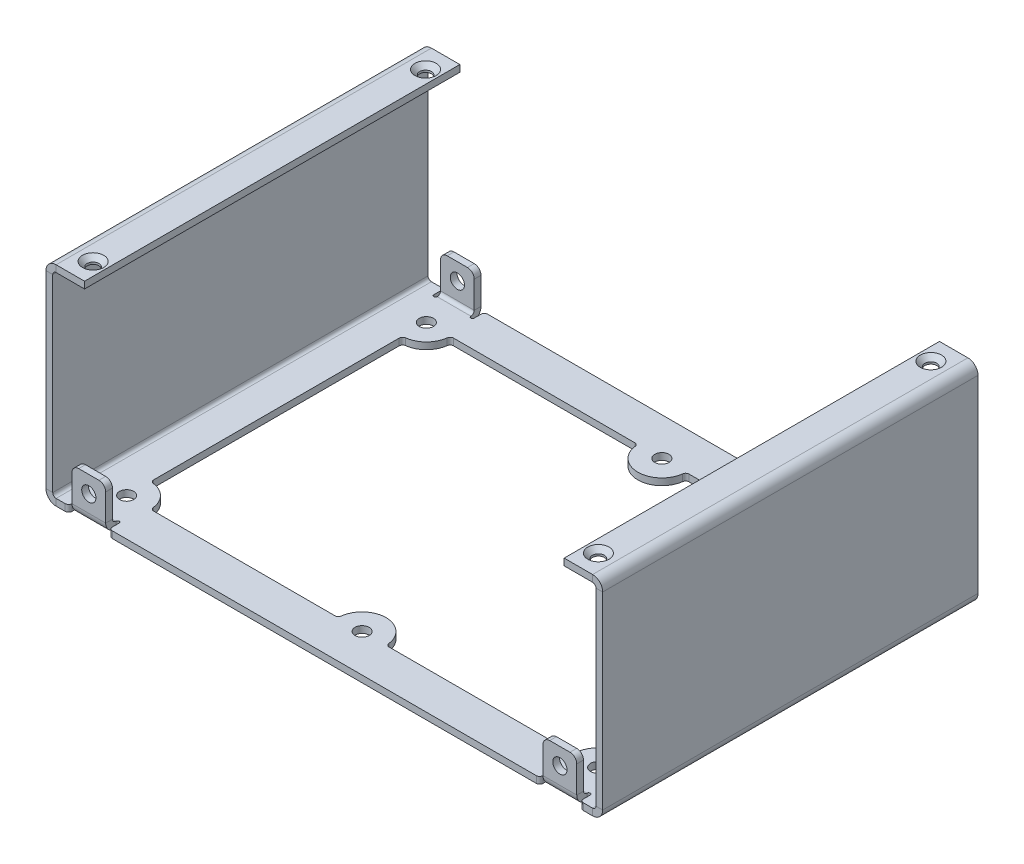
ISO-10303-21;
HEADER;
FILE_DESCRIPTION(('STEP AP214'),'2;1');
FILE_NAME('part.step','',(''),(''),'','','');
FILE_SCHEMA(('AUTOMOTIVE_DESIGN { 1 0 10303 214 1 1 1 1 }'));
ENDSEC;
DATA;
#1=APPLICATION_CONTEXT('core data for automotive mechanical design processes');
#2=APPLICATION_PROTOCOL_DEFINITION('international standard','automotive_design',2000,#1);
#3=PRODUCT_CONTEXT('',#1,'mechanical');
#4=PRODUCT('Part','Part','',(#3));
#5=PRODUCT_RELATED_PRODUCT_CATEGORY('part','',(#4));
#6=PRODUCT_DEFINITION_FORMATION('','',#4);
#7=PRODUCT_DEFINITION_CONTEXT('part definition',#1,'design');
#8=PRODUCT_DEFINITION('design','',#6,#7);
#9=PRODUCT_DEFINITION_SHAPE('','',#8);
#10=(LENGTH_UNIT() NAMED_UNIT(*) SI_UNIT(.MILLI.,.METRE.));
#11=(NAMED_UNIT(*) PLANE_ANGLE_UNIT() SI_UNIT($,.RADIAN.));
#12=(NAMED_UNIT(*) SI_UNIT($,.STERADIAN.) SOLID_ANGLE_UNIT());
#13=UNCERTAINTY_MEASURE_WITH_UNIT(LENGTH_MEASURE(1.E-05),#10,'distance_accuracy_value','');
#14=(GEOMETRIC_REPRESENTATION_CONTEXT(3) GLOBAL_UNCERTAINTY_ASSIGNED_CONTEXT((#13)) GLOBAL_UNIT_ASSIGNED_CONTEXT((#10,
#11,#12)) REPRESENTATION_CONTEXT('',''));
#15=CARTESIAN_POINT('',(0.,0.,0.));
#16=DIRECTION('',(0.,0.,1.));
#17=DIRECTION('',(1.,0.,0.));
#18=AXIS2_PLACEMENT_3D('',#15,#16,#17);
#19=CARTESIAN_POINT('',(-82.55,-60.,-287.657619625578));
#20=DIRECTION('',(0.,1.,0.));
#21=DIRECTION('',(-1.,0.,0.));
#22=AXIS2_PLACEMENT_3D('',#19,#20,#21);
#23=PLANE('',#22);
#24=DIRECTION('',(0.,0.,-1.));
#25=VECTOR('',#24,1.);
#26=CARTESIAN_POINT('',(-69.85,-60.,-18.3082));
#27=LINE('',#26,#25);
#28=CARTESIAN_POINT('',(-69.85,-60.,-19.2462977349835));
#29=VERTEX_POINT('',#28);
#30=CARTESIAN_POINT('',(-69.85,-60.,-92.0537022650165));
#31=VERTEX_POINT('',#30);
#32=EDGE_CURVE('E1837',#29,#31,#27,.T.);
#33=ORIENTED_EDGE('',*,*,#32,.T.);
#34=CARTESIAN_POINT('',(-68.85,-60.,-92.0537022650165));
#35=DIRECTION('',(0.,1.,0.));
#36=DIRECTION('',(-1.,0.,0.));
#37=AXIS2_PLACEMENT_3D('',#34,#35,#36);
#38=CIRCLE('',#37,1.);
#39=CARTESIAN_POINT('',(-68.9733319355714,-60.,-93.0460677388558));
#40=VERTEX_POINT('',#39);
#41=EDGE_CURVE('E1792',#31,#40,#38,.F.);
#42=ORIENTED_EDGE('',*,*,#41,.T.);
#43=CARTESIAN_POINT('',(-69.85,-60.,-100.1));
#44=DIRECTION('',(0.,1.,0.));
#45=DIRECTION('',(-1.,0.,0.));
#46=AXIS2_PLACEMENT_3D('',#43,#44,#45);
#47=CIRCLE('',#46,7.10819999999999);
#48=CARTESIAN_POINT('',(-62.7960677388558,-60.,-99.2233319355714));
#49=VERTEX_POINT('',#48);
#50=EDGE_CURVE('E1842',#40,#49,#47,.T.);
#51=ORIENTED_EDGE('',*,*,#50,.T.);
#52=CARTESIAN_POINT('',(-61.8037022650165,-60.,-99.1));
#53=DIRECTION('',(0.,1.,0.));
#54=DIRECTION('',(-1.,0.,0.));
#55=AXIS2_PLACEMENT_3D('',#52,#53,#54);
#56=CIRCLE('',#55,1.);
#57=CARTESIAN_POINT('',(-61.8037022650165,-60.,-100.1));
#58=VERTEX_POINT('',#57);
#59=EDGE_CURVE('E1786',#49,#58,#56,.F.);
#60=ORIENTED_EDGE('',*,*,#59,.T.);
#61=DIRECTION('',(1.,0.,0.));
#62=VECTOR('',#61,1.);
#63=CARTESIAN_POINT('',(-62.7418,-60.,-100.1));
#64=LINE('',#63,#62);
#65=CARTESIAN_POINT('',(-8.04629773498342,-60.,-100.1));
#66=VERTEX_POINT('',#65);
#67=EDGE_CURVE('E1892',#58,#66,#64,.T.);
#68=ORIENTED_EDGE('',*,*,#67,.T.);
#69=CARTESIAN_POINT('',(-8.04629773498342,-60.,-99.1));
#70=DIRECTION('',(0.,1.,0.));
#71=DIRECTION('',(-1.,0.,0.));
#72=AXIS2_PLACEMENT_3D('',#69,#70,#71);
#73=CIRCLE('',#72,1.);
#74=CARTESIAN_POINT('',(-7.05393226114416,-60.,-99.2233319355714));
#75=VERTEX_POINT('',#74);
#76=EDGE_CURVE('E1744',#66,#75,#73,.F.);
#77=ORIENTED_EDGE('',*,*,#76,.T.);
#78=CARTESIAN_POINT('',(0.,-60.,-100.1));
#79=DIRECTION('',(0.,1.,0.));
#80=DIRECTION('',(-1.,0.,0.));
#81=AXIS2_PLACEMENT_3D('',#78,#79,#80);
#82=CIRCLE('',#81,7.10819999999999);
#83=CARTESIAN_POINT('',(7.05393226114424,-60.,-99.2233319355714));
#84=VERTEX_POINT('',#83);
#85=EDGE_CURVE('E2040',#75,#84,#82,.T.);
#86=ORIENTED_EDGE('',*,*,#85,.T.);
#87=CARTESIAN_POINT('',(8.0462977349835,-60.,-99.1));
#88=DIRECTION('',(0.,1.,0.));
#89=DIRECTION('',(-1.,0.,0.));
#90=AXIS2_PLACEMENT_3D('',#87,#88,#89);
#91=CIRCLE('',#90,1.);
#92=CARTESIAN_POINT('',(8.0462977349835,-60.,-100.1));
#93=VERTEX_POINT('',#92);
#94=EDGE_CURVE('E1738',#84,#93,#91,.F.);
#95=ORIENTED_EDGE('',*,*,#94,.T.);
#96=DIRECTION('',(1.,0.,0.));
#97=VECTOR('',#96,1.);
#98=CARTESIAN_POINT('',(7.10820000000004,-60.,-100.1));
#99=LINE('',#98,#97);
#100=CARTESIAN_POINT('',(61.8037022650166,-60.,-100.1));
#101=VERTEX_POINT('',#100);
#102=EDGE_CURVE('E2036',#93,#101,#99,.T.);
#103=ORIENTED_EDGE('',*,*,#102,.T.);
#104=CARTESIAN_POINT('',(61.8037022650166,-60.,-99.1));
#105=DIRECTION('',(0.,1.,0.));
#106=DIRECTION('',(-1.,0.,0.));
#107=AXIS2_PLACEMENT_3D('',#104,#105,#106);
#108=CIRCLE('',#107,1.);
#109=CARTESIAN_POINT('',(62.7960677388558,-60.,-99.2233319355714));
#110=VERTEX_POINT('',#109);
#111=EDGE_CURVE('E1750',#101,#110,#108,.F.);
#112=ORIENTED_EDGE('',*,*,#111,.T.);
#113=CARTESIAN_POINT('',(69.85,-60.,-100.1));
#114=DIRECTION('',(0.,1.,0.));
#115=DIRECTION('',(-1.,0.,0.));
#116=AXIS2_PLACEMENT_3D('',#113,#114,#115);
#117=CIRCLE('',#116,7.10819999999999);
#118=CARTESIAN_POINT('',(68.9733319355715,-60.,-93.0460677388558));
#119=VERTEX_POINT('',#118);
#120=EDGE_CURVE('E2039',#110,#119,#117,.T.);
#121=ORIENTED_EDGE('',*,*,#120,.T.);
#122=CARTESIAN_POINT('',(68.8500000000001,-60.,-92.0537022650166));
#123=DIRECTION('',(0.,1.,0.));
#124=DIRECTION('',(-1.,0.,0.));
#125=AXIS2_PLACEMENT_3D('',#122,#123,#124);
#126=CIRCLE('',#125,1.);
#127=CARTESIAN_POINT('',(69.8500000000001,-60.,-92.0537022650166));
#128=VERTEX_POINT('',#127);
#129=EDGE_CURVE('E1756',#119,#128,#126,.F.);
#130=ORIENTED_EDGE('',*,*,#129,.T.);
#131=DIRECTION('',(0.,0.,1.));
#132=VECTOR('',#131,1.);
#133=CARTESIAN_POINT('',(69.8500000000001,-60.,-18.3082));
#134=LINE('',#133,#132);
#135=CARTESIAN_POINT('',(69.8500000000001,-60.,-19.2462977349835));
#136=VERTEX_POINT('',#135);
#137=EDGE_CURVE('E2053',#128,#136,#134,.T.);
#138=ORIENTED_EDGE('',*,*,#137,.T.);
#139=CARTESIAN_POINT('',(68.8500000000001,-60.,-19.2462977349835));
#140=DIRECTION('',(0.,1.,0.));
#141=DIRECTION('',(-1.,0.,0.));
#142=AXIS2_PLACEMENT_3D('',#139,#140,#141);
#143=CIRCLE('',#142,1.);
#144=CARTESIAN_POINT('',(68.9733319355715,-60.,-18.2539322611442));
#145=VERTEX_POINT('',#144);
#146=EDGE_CURVE('E1762',#136,#145,#143,.F.);
#147=ORIENTED_EDGE('',*,*,#146,.T.);
#148=CARTESIAN_POINT('',(69.85,-60.,-11.2));
#149=DIRECTION('',(0.,1.,0.));
#150=DIRECTION('',(-1.,0.,0.));
#151=AXIS2_PLACEMENT_3D('',#148,#149,#150);
#152=CIRCLE('',#151,7.10819999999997);
#153=CARTESIAN_POINT('',(62.7960677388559,-60.,-12.0766680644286));
#154=VERTEX_POINT('',#153);
#155=EDGE_CURVE('E2059',#145,#154,#152,.T.);
#156=ORIENTED_EDGE('',*,*,#155,.T.);
#157=CARTESIAN_POINT('',(61.8037022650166,-60.,-12.2));
#158=DIRECTION('',(0.,1.,0.));
#159=DIRECTION('',(-1.,0.,0.));
#160=AXIS2_PLACEMENT_3D('',#157,#158,#159);
#161=CIRCLE('',#160,1.);
#162=CARTESIAN_POINT('',(61.8037022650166,-60.,-11.2));
#163=VERTEX_POINT('',#162);
#164=EDGE_CURVE('E1768',#154,#163,#161,.F.);
#165=ORIENTED_EDGE('',*,*,#164,.T.);
#166=DIRECTION('',(-1.,0.,0.));
#167=VECTOR('',#166,1.);
#168=CARTESIAN_POINT('',(7.10820000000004,-60.,-11.2));
#169=LINE('',#168,#167);
#170=CARTESIAN_POINT('',(8.0462977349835,-60.,-11.2));
#171=VERTEX_POINT('',#170);
#172=EDGE_CURVE('E2065',#163,#171,#169,.T.);
#173=ORIENTED_EDGE('',*,*,#172,.T.);
#174=CARTESIAN_POINT('',(8.0462977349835,-60.,-12.2));
#175=DIRECTION('',(0.,1.,0.));
#176=DIRECTION('',(-1.,0.,0.));
#177=AXIS2_PLACEMENT_3D('',#174,#175,#176);
#178=CIRCLE('',#177,1.);
#179=CARTESIAN_POINT('',(7.05393226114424,-60.,-12.0766680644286));
#180=VERTEX_POINT('',#179);
#181=EDGE_CURVE('E1774',#171,#180,#178,.F.);
#182=ORIENTED_EDGE('',*,*,#181,.T.);
#183=CARTESIAN_POINT('',(0.,-60.,-11.2));
#184=DIRECTION('',(0.,1.,0.));
#185=DIRECTION('',(-1.,0.,0.));
#186=AXIS2_PLACEMENT_3D('',#183,#184,#185);
#187=CIRCLE('',#186,7.10819999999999);
#188=CARTESIAN_POINT('',(-7.05393226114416,-60.,-12.0766680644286));
#189=VERTEX_POINT('',#188);
#190=EDGE_CURVE('E1845',#180,#189,#187,.T.);
#191=ORIENTED_EDGE('',*,*,#190,.T.);
#192=CARTESIAN_POINT('',(-8.04629773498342,-60.,-12.2));
#193=DIRECTION('',(0.,1.,0.));
#194=DIRECTION('',(-1.,0.,0.));
#195=AXIS2_PLACEMENT_3D('',#192,#193,#194);
#196=CIRCLE('',#195,1.);
#197=CARTESIAN_POINT('',(-8.04629773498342,-60.,-11.2));
#198=VERTEX_POINT('',#197);
#199=EDGE_CURVE('E1780',#189,#198,#196,.F.);
#200=ORIENTED_EDGE('',*,*,#199,.T.);
#201=DIRECTION('',(-1.,0.,0.));
#202=VECTOR('',#201,1.);
#203=CARTESIAN_POINT('',(-62.7418,-60.,-11.2));
#204=LINE('',#203,#202);
#205=CARTESIAN_POINT('',(-61.8037022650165,-60.,-11.2));
#206=VERTEX_POINT('',#205);
#207=EDGE_CURVE('E1832',#198,#206,#204,.T.);
#208=ORIENTED_EDGE('',*,*,#207,.T.);
#209=CARTESIAN_POINT('',(-61.8037022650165,-60.,-12.2));
#210=DIRECTION('',(0.,1.,0.));
#211=DIRECTION('',(-1.,0.,0.));
#212=AXIS2_PLACEMENT_3D('',#209,#210,#211);
#213=CIRCLE('',#212,1.);
#214=CARTESIAN_POINT('',(-62.7960677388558,-60.,-12.0766680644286));
#215=VERTEX_POINT('',#214);
#216=EDGE_CURVE('E15',#206,#215,#213,.F.);
#217=ORIENTED_EDGE('',*,*,#216,.T.);
#218=CARTESIAN_POINT('',(-69.85,-60.,-11.2));
#219=DIRECTION('',(0.,1.,0.));
#220=DIRECTION('',(-1.,0.,0.));
#221=AXIS2_PLACEMENT_3D('',#218,#219,#220);
#222=CIRCLE('',#221,7.1082);
#223=CARTESIAN_POINT('',(-68.9733319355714,-60.,-18.2539322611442));
#224=VERTEX_POINT('',#223);
#225=EDGE_CURVE('E1830',#215,#224,#222,.T.);
#226=ORIENTED_EDGE('',*,*,#225,.T.);
#227=CARTESIAN_POINT('',(-68.85,-60.,-19.2462977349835));
#228=DIRECTION('',(0.,1.,0.));
#229=DIRECTION('',(-1.,0.,0.));
#230=AXIS2_PLACEMENT_3D('',#227,#228,#229);
#231=CIRCLE('',#230,1.);
#232=EDGE_CURVE('E1798',#224,#29,#231,.F.);
#233=ORIENTED_EDGE('',*,*,#232,.T.);
#234=EDGE_LOOP('',(#33,#42,#51,#60,#68,#77,#86,#95,#103,#112,#121,#130,#138,#147,#156,#165,#173,
#182,#191,#200,#208,#217,#226,#233));
#235=FACE_BOUND('',#234,.T.);
#236=CARTESIAN_POINT('',(69.85,-60.,-100.1));
#237=DIRECTION('',(0.,1.,0.));
#238=DIRECTION('',(-1.,0.,0.));
#239=AXIS2_PLACEMENT_3D('',#236,#237,#238);
#240=CIRCLE('',#239,2.1082);
#241=CARTESIAN_POINT('',(67.7418,-60.,-100.1));
#242=VERTEX_POINT('',#241);
#243=EDGE_CURVE('E1905',#242,#242,#240,.F.);
#244=ORIENTED_EDGE('',*,*,#243,.T.);
#245=EDGE_LOOP('',(#244));
#246=FACE_BOUND('',#245,.T.);
#247=CARTESIAN_POINT('',(-69.85,-60.,-100.1));
#248=DIRECTION('',(0.,1.,0.));
#249=DIRECTION('',(-1.,0.,0.));
#250=AXIS2_PLACEMENT_3D('',#247,#248,#249);
#251=CIRCLE('',#250,2.10819999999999);
#252=CARTESIAN_POINT('',(-71.9582,-60.,-100.1));
#253=VERTEX_POINT('',#252);
#254=EDGE_CURVE('E1915',#253,#253,#251,.F.);
#255=ORIENTED_EDGE('',*,*,#254,.T.);
#256=EDGE_LOOP('',(#255));
#257=FACE_BOUND('',#256,.T.);
#258=CARTESIAN_POINT('',(-69.85,-60.,-11.2));
#259=DIRECTION('',(0.,1.,0.));
#260=DIRECTION('',(-1.,0.,0.));
#261=AXIS2_PLACEMENT_3D('',#258,#259,#260);
#262=CIRCLE('',#261,2.1082);
#263=CARTESIAN_POINT('',(-71.9582,-60.,-11.2));
#264=VERTEX_POINT('',#263);
#265=EDGE_CURVE('E1923',#264,#264,#262,.F.);
#266=ORIENTED_EDGE('',*,*,#265,.T.);
#267=EDGE_LOOP('',(#266));
#268=FACE_BOUND('',#267,.T.);
#269=CARTESIAN_POINT('',(0.,-60.,-11.2));
#270=DIRECTION('',(0.,1.,0.));
#271=DIRECTION('',(-1.,0.,0.));
#272=AXIS2_PLACEMENT_3D('',#269,#270,#271);
#273=CIRCLE('',#272,2.1082);
#274=CARTESIAN_POINT('',(-2.1082,-60.,-11.2));
#275=VERTEX_POINT('',#274);
#276=EDGE_CURVE('E1904',#275,#275,#273,.F.);
#277=ORIENTED_EDGE('',*,*,#276,.T.);
#278=EDGE_LOOP('',(#277));
#279=FACE_BOUND('',#278,.T.);
#280=CARTESIAN_POINT('',(0.,-60.,-100.1));
#281=DIRECTION('',(0.,1.,0.));
#282=DIRECTION('',(-1.,0.,0.));
#283=AXIS2_PLACEMENT_3D('',#280,#281,#282);
#284=CIRCLE('',#283,2.10820000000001);
#285=CARTESIAN_POINT('',(-2.1082,-60.,-100.1));
#286=VERTEX_POINT('',#285);
#287=EDGE_CURVE('E1896',#286,#286,#284,.F.);
#288=ORIENTED_EDGE('',*,*,#287,.T.);
#289=EDGE_LOOP('',(#288));
#290=FACE_BOUND('',#289,.T.);
#291=CARTESIAN_POINT('',(69.85,-60.,-11.2));
#292=DIRECTION('',(0.,1.,0.));
#293=DIRECTION('',(-1.,0.,0.));
#294=AXIS2_PLACEMENT_3D('',#291,#292,#293);
#295=CIRCLE('',#294,2.1082);
#296=CARTESIAN_POINT('',(67.7418,-60.,-11.2));
#297=VERTEX_POINT('',#296);
#298=EDGE_CURVE('E1940',#297,#297,#295,.F.);
#299=ORIENTED_EDGE('',*,*,#298,.T.);
#300=EDGE_LOOP('',(#299));
#301=FACE_BOUND('',#300,.T.);
#302=DIRECTION('',(0.,0.,1.));
#303=VECTOR('',#302,1.);
#304=CARTESIAN_POINT('',(-75.85,-60.,-111.3));
#305=LINE('',#304,#303);
#306=CARTESIAN_POINT('',(-75.85,-60.,-110.3));
#307=VERTEX_POINT('',#306);
#308=CARTESIAN_POINT('',(-75.85,-60.,-108.3));
#309=VERTEX_POINT('',#308);
#310=EDGE_CURVE('E1099',#307,#309,#305,.T.);
#311=ORIENTED_EDGE('',*,*,#310,.F.);
#312=CARTESIAN_POINT('',(-76.85,-60.,-110.3));
#313=DIRECTION('',(0.,1.,0.));
#314=DIRECTION('',(-1.,0.,0.));
#315=AXIS2_PLACEMENT_3D('',#312,#313,#314);
#316=CIRCLE('',#315,1.);
#317=CARTESIAN_POINT('',(-76.85,-60.,-111.3));
#318=VERTEX_POINT('',#317);
#319=EDGE_CURVE('E1684',#307,#318,#316,.T.);
#320=ORIENTED_EDGE('',*,*,#319,.T.);
#321=DIRECTION('',(-1.,0.,0.));
#322=VECTOR('',#321,1.);
#323=CARTESIAN_POINT('',(-82.55,-60.,-111.3));
#324=LINE('',#323,#322);
#325=CARTESIAN_POINT('',(-79.55,-60.,-111.3));
#326=VERTEX_POINT('',#325);
#327=EDGE_CURVE('E1221',#326,#318,#324,.F.);
#328=ORIENTED_EDGE('',*,*,#327,.F.);
#329=DIRECTION('',(0.,0.,1.));
#330=VECTOR('',#329,1.);
#331=CARTESIAN_POINT('',(-79.55,-60.,-287.657619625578));
#332=LINE('',#331,#330);
#333=CARTESIAN_POINT('',(-79.55,-60.,0.));
#334=VERTEX_POINT('',#333);
#335=EDGE_CURVE('E1320',#326,#334,#332,.T.);
#336=ORIENTED_EDGE('',*,*,#335,.T.);
#337=DIRECTION('',(-1.,0.,0.));
#338=VECTOR('',#337,1.);
#339=CARTESIAN_POINT('',(-82.55,-60.,0.));
#340=LINE('',#339,#338);
#341=CARTESIAN_POINT('',(-76.85,-60.,0.));
#342=VERTEX_POINT('',#341);
#343=EDGE_CURVE('E1295',#342,#334,#340,.T.);
#344=ORIENTED_EDGE('',*,*,#343,.F.);
#345=CARTESIAN_POINT('',(-76.85,-60.,-1.));
#346=DIRECTION('',(0.,1.,0.));
#347=DIRECTION('',(-1.,0.,0.));
#348=AXIS2_PLACEMENT_3D('',#345,#346,#347);
#349=CIRCLE('',#348,1.);
#350=CARTESIAN_POINT('',(-75.85,-60.,-1.));
#351=VERTEX_POINT('',#350);
#352=EDGE_CURVE('E1664',#342,#351,#349,.T.);
#353=ORIENTED_EDGE('',*,*,#352,.T.);
#354=DIRECTION('',(0.,0.,1.));
#355=VECTOR('',#354,1.);
#356=CARTESIAN_POINT('',(-75.85,-60.,0.));
#357=LINE('',#356,#355);
#358=CARTESIAN_POINT('',(-75.85,-60.,-3.));
#359=VERTEX_POINT('',#358);
#360=EDGE_CURVE('E1158',#359,#351,#357,.T.);
#361=ORIENTED_EDGE('',*,*,#360,.F.);
#362=CARTESIAN_POINT('',(-75.35,-60.,-3.));
#363=DIRECTION('',(0.,1.,0.));
#364=DIRECTION('',(-1.,0.,0.));
#365=AXIS2_PLACEMENT_3D('',#362,#363,#364);
#366=CIRCLE('',#365,0.5);
#367=CARTESIAN_POINT('',(-74.85,-60.,-3.));
#368=VERTEX_POINT('',#367);
#369=EDGE_CURVE('E1101',#368,#359,#366,.T.);
#370=ORIENTED_EDGE('',*,*,#369,.F.);
#371=DIRECTION('',(1.,0.,0.));
#372=VECTOR('',#371,1.);
#373=CARTESIAN_POINT('',(-64.85,-60.,-3.));
#374=LINE('',#373,#372);
#375=CARTESIAN_POINT('',(-64.85,-60.,-3.));
#376=VERTEX_POINT('',#375);
#377=EDGE_CURVE('E1033',#376,#368,#374,.F.);
#378=ORIENTED_EDGE('',*,*,#377,.F.);
#379=CARTESIAN_POINT('',(-64.35,-60.,-3.));
#380=DIRECTION('',(0.,1.,0.));
#381=DIRECTION('',(-1.,0.,0.));
#382=AXIS2_PLACEMENT_3D('',#379,#380,#381);
#383=CIRCLE('',#382,0.5);
#384=CARTESIAN_POINT('',(-63.85,-60.,-3.));
#385=VERTEX_POINT('',#384);
#386=EDGE_CURVE('E1096',#385,#376,#383,.T.);
#387=ORIENTED_EDGE('',*,*,#386,.F.);
#388=DIRECTION('',(0.,0.,-1.));
#389=VECTOR('',#388,1.);
#390=CARTESIAN_POINT('',(-63.85,-60.,0.));
#391=LINE('',#390,#389);
#392=CARTESIAN_POINT('',(-63.85,-60.,-1.));
#393=VERTEX_POINT('',#392);
#394=EDGE_CURVE('E1135',#393,#385,#391,.T.);
#395=ORIENTED_EDGE('',*,*,#394,.F.);
#396=CARTESIAN_POINT('',(-62.85,-60.,-1.));
#397=DIRECTION('',(0.,1.,0.));
#398=DIRECTION('',(-1.,0.,0.));
#399=AXIS2_PLACEMENT_3D('',#396,#397,#398);
#400=CIRCLE('',#399,1.);
#401=CARTESIAN_POINT('',(-62.85,-60.,0.));
#402=VERTEX_POINT('',#401);
#403=EDGE_CURVE('E1667',#393,#402,#400,.T.);
#404=ORIENTED_EDGE('',*,*,#403,.T.);
#405=CARTESIAN_POINT('',(62.85,-60.,0.));
#406=VERTEX_POINT('',#405);
#407=EDGE_CURVE('E1300',#406,#402,#340,.T.);
#408=ORIENTED_EDGE('',*,*,#407,.F.);
#409=CARTESIAN_POINT('',(62.85,-60.,-1.));
#410=DIRECTION('',(0.,1.,0.));
#411=DIRECTION('',(-1.,0.,0.));
#412=AXIS2_PLACEMENT_3D('',#409,#410,#411);
#413=CIRCLE('',#412,1.);
#414=CARTESIAN_POINT('',(63.85,-60.,-1.));
#415=VERTEX_POINT('',#414);
#416=EDGE_CURVE('E1670',#406,#415,#413,.T.);
#417=ORIENTED_EDGE('',*,*,#416,.T.);
#418=DIRECTION('',(0.,0.,1.));
#419=VECTOR('',#418,1.);
#420=CARTESIAN_POINT('',(63.85,-60.,0.));
#421=LINE('',#420,#419);
#422=CARTESIAN_POINT('',(63.85,-60.,-3.));
#423=VERTEX_POINT('',#422);
#424=EDGE_CURVE('E1142',#423,#415,#421,.T.);
#425=ORIENTED_EDGE('',*,*,#424,.F.);
#426=CARTESIAN_POINT('',(64.35,-60.,-2.99999999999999));
#427=DIRECTION('',(0.,1.,0.));
#428=DIRECTION('',(-1.,0.,0.));
#429=AXIS2_PLACEMENT_3D('',#426,#427,#428);
#430=CIRCLE('',#429,0.5);
#431=CARTESIAN_POINT('',(64.85,-60.,-2.99999999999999));
#432=VERTEX_POINT('',#431);
#433=EDGE_CURVE('E1086',#432,#423,#430,.T.);
#434=ORIENTED_EDGE('',*,*,#433,.F.);
#435=DIRECTION('',(1.,0.,0.));
#436=VECTOR('',#435,1.);
#437=CARTESIAN_POINT('',(74.85,-60.,-2.99999999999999));
#438=LINE('',#437,#436);
#439=CARTESIAN_POINT('',(74.85,-60.,-3.));
#440=VERTEX_POINT('',#439);
#441=EDGE_CURVE('E965',#440,#432,#438,.F.);
#442=ORIENTED_EDGE('',*,*,#441,.F.);
#443=CARTESIAN_POINT('',(75.35,-60.,-2.99999999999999));
#444=DIRECTION('',(0.,1.,0.));
#445=DIRECTION('',(-1.,0.,0.));
#446=AXIS2_PLACEMENT_3D('',#443,#444,#445);
#447=CIRCLE('',#446,0.5);
#448=CARTESIAN_POINT('',(75.85,-60.,-2.99999999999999));
#449=VERTEX_POINT('',#448);
#450=EDGE_CURVE('E1080',#449,#440,#447,.T.);
#451=ORIENTED_EDGE('',*,*,#450,.F.);
#452=DIRECTION('',(0.,0.,-1.));
#453=VECTOR('',#452,1.);
#454=CARTESIAN_POINT('',(75.85,-60.,0.));
#455=LINE('',#454,#453);
#456=CARTESIAN_POINT('',(75.85,-60.,-1.));
#457=VERTEX_POINT('',#456);
#458=EDGE_CURVE('E1149',#457,#449,#455,.T.);
#459=ORIENTED_EDGE('',*,*,#458,.F.);
#460=CARTESIAN_POINT('',(76.85,-60.,-1.));
#461=DIRECTION('',(0.,1.,0.));
#462=DIRECTION('',(-1.,0.,0.));
#463=AXIS2_PLACEMENT_3D('',#460,#461,#462);
#464=CIRCLE('',#463,1.);
#465=CARTESIAN_POINT('',(76.85,-60.,0.));
#466=VERTEX_POINT('',#465);
#467=EDGE_CURVE('E1673',#457,#466,#464,.T.);
#468=ORIENTED_EDGE('',*,*,#467,.T.);
#469=CARTESIAN_POINT('',(79.55,-60.,0.));
#470=VERTEX_POINT('',#469);
#471=EDGE_CURVE('E1296',#470,#466,#340,.T.);
#472=ORIENTED_EDGE('',*,*,#471,.F.);
#473=DIRECTION('',(0.,0.,1.));
#474=VECTOR('',#473,1.);
#475=CARTESIAN_POINT('',(79.55,-60.,-287.657619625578));
#476=LINE('',#475,#474);
#477=CARTESIAN_POINT('',(79.55,-60.,-111.3));
#478=VERTEX_POINT('',#477);
#479=EDGE_CURVE('E1323',#478,#470,#476,.T.);
#480=ORIENTED_EDGE('',*,*,#479,.F.);
#481=CARTESIAN_POINT('',(76.85,-60.,-111.3));
#482=VERTEX_POINT('',#481);
#483=EDGE_CURVE('E1226',#482,#478,#324,.F.);
#484=ORIENTED_EDGE('',*,*,#483,.F.);
#485=CARTESIAN_POINT('',(76.85,-60.,-110.3));
#486=DIRECTION('',(0.,1.,0.));
#487=DIRECTION('',(-1.,0.,0.));
#488=AXIS2_PLACEMENT_3D('',#485,#486,#487);
#489=CIRCLE('',#488,1.);
#490=CARTESIAN_POINT('',(75.85,-60.,-110.3));
#491=VERTEX_POINT('',#490);
#492=EDGE_CURVE('E155',#482,#491,#489,.T.);
#493=ORIENTED_EDGE('',*,*,#492,.T.);
#494=DIRECTION('',(0.,0.,-1.));
#495=VECTOR('',#494,1.);
#496=CARTESIAN_POINT('',(75.85,-60.,-111.3));
#497=LINE('',#496,#495);
#498=CARTESIAN_POINT('',(75.85,-60.,-108.3));
#499=VERTEX_POINT('',#498);
#500=EDGE_CURVE('E1114',#499,#491,#497,.T.);
#501=ORIENTED_EDGE('',*,*,#500,.F.);
#502=CARTESIAN_POINT('',(75.35,-60.,-108.3));
#503=DIRECTION('',(0.,1.,0.));
#504=DIRECTION('',(-1.,0.,0.));
#505=AXIS2_PLACEMENT_3D('',#502,#503,#504);
#506=CIRCLE('',#505,0.5);
#507=CARTESIAN_POINT('',(74.85,-60.,-108.3));
#508=VERTEX_POINT('',#507);
#509=EDGE_CURVE('E1054',#508,#499,#506,.T.);
#510=ORIENTED_EDGE('',*,*,#509,.F.);
#511=DIRECTION('',(-1.,0.,0.));
#512=VECTOR('',#511,1.);
#513=CARTESIAN_POINT('',(64.85,-60.,-108.3));
#514=LINE('',#513,#512);
#515=CARTESIAN_POINT('',(64.8500000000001,-60.,-108.3));
#516=VERTEX_POINT('',#515);
#517=EDGE_CURVE('E832',#516,#508,#514,.F.);
#518=ORIENTED_EDGE('',*,*,#517,.F.);
#519=CARTESIAN_POINT('',(64.3500000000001,-60.,-108.3));
#520=DIRECTION('',(0.,1.,0.));
#521=DIRECTION('',(-1.,0.,0.));
#522=AXIS2_PLACEMENT_3D('',#519,#520,#521);
#523=CIRCLE('',#522,0.5);
#524=CARTESIAN_POINT('',(63.85,-60.,-108.3));
#525=VERTEX_POINT('',#524);
#526=EDGE_CURVE('E1048',#525,#516,#523,.T.);
#527=ORIENTED_EDGE('',*,*,#526,.F.);
#528=DIRECTION('',(0.,0.,1.));
#529=VECTOR('',#528,1.);
#530=CARTESIAN_POINT('',(63.85,-60.,-111.3));
#531=LINE('',#530,#529);
#532=CARTESIAN_POINT('',(63.85,-60.,-110.3));
#533=VERTEX_POINT('',#532);
#534=EDGE_CURVE('E1115',#533,#525,#531,.T.);
#535=ORIENTED_EDGE('',*,*,#534,.F.);
#536=CARTESIAN_POINT('',(62.85,-60.,-110.3));
#537=DIRECTION('',(0.,1.,0.));
#538=DIRECTION('',(-1.,0.,0.));
#539=AXIS2_PLACEMENT_3D('',#536,#537,#538);
#540=CIRCLE('',#539,1.);
#541=CARTESIAN_POINT('',(62.85,-60.,-111.3));
#542=VERTEX_POINT('',#541);
#543=EDGE_CURVE('E1678',#533,#542,#540,.T.);
#544=ORIENTED_EDGE('',*,*,#543,.T.);
#545=CARTESIAN_POINT('',(-62.85,-60.,-111.3));
#546=VERTEX_POINT('',#545);
#547=EDGE_CURVE('E1225',#546,#542,#324,.F.);
#548=ORIENTED_EDGE('',*,*,#547,.F.);
#549=CARTESIAN_POINT('',(-62.85,-60.,-110.3));
#550=DIRECTION('',(0.,1.,0.));
#551=DIRECTION('',(-1.,0.,0.));
#552=AXIS2_PLACEMENT_3D('',#549,#550,#551);
#553=CIRCLE('',#552,1.);
#554=CARTESIAN_POINT('',(-63.85,-60.,-110.3));
#555=VERTEX_POINT('',#554);
#556=EDGE_CURVE('E1681',#546,#555,#553,.T.);
#557=ORIENTED_EDGE('',*,*,#556,.T.);
#558=DIRECTION('',(0.,0.,-1.));
#559=VECTOR('',#558,1.);
#560=CARTESIAN_POINT('',(-63.85,-60.,-111.3));
#561=LINE('',#560,#559);
#562=CARTESIAN_POINT('',(-63.85,-60.,-108.3));
#563=VERTEX_POINT('',#562);
#564=EDGE_CURVE('E1122',#563,#555,#561,.T.);
#565=ORIENTED_EDGE('',*,*,#564,.F.);
#566=CARTESIAN_POINT('',(-64.35,-60.,-108.3));
#567=DIRECTION('',(0.,1.,0.));
#568=DIRECTION('',(-1.,0.,0.));
#569=AXIS2_PLACEMENT_3D('',#566,#567,#568);
#570=CIRCLE('',#569,0.5);
#571=CARTESIAN_POINT('',(-64.85,-60.,-108.3));
#572=VERTEX_POINT('',#571);
#573=EDGE_CURVE('E1070',#572,#563,#570,.T.);
#574=ORIENTED_EDGE('',*,*,#573,.F.);
#575=DIRECTION('',(-1.,0.,0.));
#576=VECTOR('',#575,1.);
#577=CARTESIAN_POINT('',(-74.85,-60.,-108.3));
#578=LINE('',#577,#576);
#579=CARTESIAN_POINT('',(-74.85,-60.,-108.3));
#580=VERTEX_POINT('',#579);
#581=EDGE_CURVE('E898',#580,#572,#578,.F.);
#582=ORIENTED_EDGE('',*,*,#581,.F.);
#583=CARTESIAN_POINT('',(-75.35,-60.,-108.3));
#584=DIRECTION('',(0.,1.,0.));
#585=DIRECTION('',(-1.,0.,0.));
#586=AXIS2_PLACEMENT_3D('',#583,#584,#585);
#587=CIRCLE('',#586,0.5);
#588=EDGE_CURVE('E1064',#309,#580,#587,.T.);
#589=ORIENTED_EDGE('',*,*,#588,.F.);
#590=EDGE_LOOP('',(#311,#320,#328,#336,#344,#353,#361,#370,#378,#387,#395,#404,#408,#417,#425,
#434,#442,#451,#459,#468,#472,#480,#484,#493,#501,#510,#518,#527,#535,#544,#548,#557,#565,#574,
#582,#589));
#591=FACE_BOUND('',#590,.T.);
#592=ADVANCED_FACE('F139',(#235,#246,#257,#268,#279,#290,#301,#591),#23,.T.);
#593=CARTESIAN_POINT('',(-82.55,-62.,-287.657619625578));
#594=DIRECTION('',(0.,1.,0.));
#595=DIRECTION('',(-1.,0.,0.));
#596=AXIS2_PLACEMENT_3D('',#593,#594,#595);
#597=PLANE('',#596);
#598=DIRECTION('',(1.,0.,0.));
#599=VECTOR('',#598,1.);
#600=CARTESIAN_POINT('',(-62.7418,-62.,-100.1));
#601=LINE('',#600,#599);
#602=CARTESIAN_POINT('',(-61.8037022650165,-62.,-100.1));
#603=VERTEX_POINT('',#602);
#604=CARTESIAN_POINT('',(-8.04629773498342,-62.,-100.1));
#605=VERTEX_POINT('',#604);
#606=EDGE_CURVE('E1856',#603,#605,#601,.T.);
#607=ORIENTED_EDGE('',*,*,#606,.F.);
#608=CARTESIAN_POINT('',(-61.8037022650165,-62.,-99.1));
#609=DIRECTION('',(0.,1.,0.));
#610=DIRECTION('',(-1.,0.,0.));
#611=AXIS2_PLACEMENT_3D('',#608,#609,#610);
#612=CIRCLE('',#611,1.);
#613=CARTESIAN_POINT('',(-62.7960677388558,-62.,-99.2233319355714));
#614=VERTEX_POINT('',#613);
#615=EDGE_CURVE('E1783',#603,#614,#612,.T.);
#616=ORIENTED_EDGE('',*,*,#615,.T.);
#617=CARTESIAN_POINT('',(-69.85,-62.,-100.1));
#618=DIRECTION('',(0.,1.,0.));
#619=DIRECTION('',(-1.,0.,0.));
#620=AXIS2_PLACEMENT_3D('',#617,#618,#619);
#621=CIRCLE('',#620,7.10819999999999);
#622=CARTESIAN_POINT('',(-68.9733319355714,-62.,-93.0460677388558));
#623=VERTEX_POINT('',#622);
#624=EDGE_CURVE('E1852',#623,#614,#621,.T.);
#625=ORIENTED_EDGE('',*,*,#624,.F.);
#626=CARTESIAN_POINT('',(-68.85,-62.,-92.0537022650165));
#627=DIRECTION('',(0.,1.,0.));
#628=DIRECTION('',(-1.,0.,0.));
#629=AXIS2_PLACEMENT_3D('',#626,#627,#628);
#630=CIRCLE('',#629,1.);
#631=CARTESIAN_POINT('',(-69.85,-62.,-92.0537022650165));
#632=VERTEX_POINT('',#631);
#633=EDGE_CURVE('E1789',#623,#632,#630,.T.);
#634=ORIENTED_EDGE('',*,*,#633,.T.);
#635=DIRECTION('',(0.,0.,-1.));
#636=VECTOR('',#635,1.);
#637=CARTESIAN_POINT('',(-69.85,-62.,-18.3082));
#638=LINE('',#637,#636);
#639=CARTESIAN_POINT('',(-69.85,-62.,-19.2462977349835));
#640=VERTEX_POINT('',#639);
#641=EDGE_CURVE('E1888',#640,#632,#638,.T.);
#642=ORIENTED_EDGE('',*,*,#641,.F.);
#643=CARTESIAN_POINT('',(-68.85,-62.,-19.2462977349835));
#644=DIRECTION('',(0.,1.,0.));
#645=DIRECTION('',(-1.,0.,0.));
#646=AXIS2_PLACEMENT_3D('',#643,#644,#645);
#647=CIRCLE('',#646,1.);
#648=CARTESIAN_POINT('',(-68.9733319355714,-62.,-18.2539322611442));
#649=VERTEX_POINT('',#648);
#650=EDGE_CURVE('E1795',#640,#649,#647,.T.);
#651=ORIENTED_EDGE('',*,*,#650,.T.);
#652=CARTESIAN_POINT('',(-69.85,-62.,-11.2));
#653=DIRECTION('',(0.,1.,0.));
#654=DIRECTION('',(1.,0.,0.));
#655=AXIS2_PLACEMENT_3D('',#652,#653,#654);
#656=CIRCLE('',#655,7.1082);
#657=CARTESIAN_POINT('',(-62.7960677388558,-62.,-12.0766680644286));
#658=VERTEX_POINT('',#657);
#659=EDGE_CURVE('E1811',#658,#649,#656,.T.);
#660=ORIENTED_EDGE('',*,*,#659,.F.);
#661=CARTESIAN_POINT('',(-61.8037022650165,-62.,-12.2));
#662=DIRECTION('',(0.,1.,0.));
#663=DIRECTION('',(-1.,0.,0.));
#664=AXIS2_PLACEMENT_3D('',#661,#662,#663);
#665=CIRCLE('',#664,1.);
#666=CARTESIAN_POINT('',(-61.8037022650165,-62.,-11.2));
#667=VERTEX_POINT('',#666);
#668=EDGE_CURVE('E148',#658,#667,#665,.T.);
#669=ORIENTED_EDGE('',*,*,#668,.T.);
#670=DIRECTION('',(-1.,0.,0.));
#671=VECTOR('',#670,1.);
#672=CARTESIAN_POINT('',(-62.7418,-62.,-11.2));
#673=LINE('',#672,#671);
#674=CARTESIAN_POINT('',(-8.04629773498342,-62.,-11.2));
#675=VERTEX_POINT('',#674);
#676=EDGE_CURVE('E1809',#675,#667,#673,.T.);
#677=ORIENTED_EDGE('',*,*,#676,.F.);
#678=CARTESIAN_POINT('',(-8.04629773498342,-62.,-12.2));
#679=DIRECTION('',(0.,1.,0.));
#680=DIRECTION('',(-1.,0.,0.));
#681=AXIS2_PLACEMENT_3D('',#678,#679,#680);
#682=CIRCLE('',#681,1.);
#683=CARTESIAN_POINT('',(-7.05393226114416,-62.,-12.0766680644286));
#684=VERTEX_POINT('',#683);
#685=EDGE_CURVE('E1777',#675,#684,#682,.T.);
#686=ORIENTED_EDGE('',*,*,#685,.T.);
#687=CARTESIAN_POINT('',(0.,-62.,-11.2));
#688=DIRECTION('',(0.,1.,0.));
#689=DIRECTION('',(1.,0.,0.));
#690=AXIS2_PLACEMENT_3D('',#687,#688,#689);
#691=CIRCLE('',#690,7.10819999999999);
#692=CARTESIAN_POINT('',(7.05393226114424,-62.,-12.0766680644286));
#693=VERTEX_POINT('',#692);
#694=EDGE_CURVE('E1821',#693,#684,#691,.T.);
#695=ORIENTED_EDGE('',*,*,#694,.F.);
#696=CARTESIAN_POINT('',(8.0462977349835,-62.,-12.2));
#697=DIRECTION('',(0.,1.,0.));
#698=DIRECTION('',(-1.,0.,0.));
#699=AXIS2_PLACEMENT_3D('',#696,#697,#698);
#700=CIRCLE('',#699,1.);
#701=CARTESIAN_POINT('',(8.0462977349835,-62.,-11.2));
#702=VERTEX_POINT('',#701);
#703=EDGE_CURVE('E1771',#693,#702,#700,.T.);
#704=ORIENTED_EDGE('',*,*,#703,.T.);
#705=DIRECTION('',(-1.,0.,0.));
#706=VECTOR('',#705,1.);
#707=CARTESIAN_POINT('',(7.10820000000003,-62.,-11.2));
#708=LINE('',#707,#706);
#709=CARTESIAN_POINT('',(61.8037022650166,-62.,-11.2));
#710=VERTEX_POINT('',#709);
#711=EDGE_CURVE('E1880',#710,#702,#708,.T.);
#712=ORIENTED_EDGE('',*,*,#711,.F.);
#713=CARTESIAN_POINT('',(61.8037022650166,-62.,-12.2));
#714=DIRECTION('',(0.,1.,0.));
#715=DIRECTION('',(-1.,0.,0.));
#716=AXIS2_PLACEMENT_3D('',#713,#714,#715);
#717=CIRCLE('',#716,1.);
#718=CARTESIAN_POINT('',(62.7960677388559,-62.,-12.0766680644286));
#719=VERTEX_POINT('',#718);
#720=EDGE_CURVE('E1765',#710,#719,#717,.T.);
#721=ORIENTED_EDGE('',*,*,#720,.T.);
#722=CARTESIAN_POINT('',(69.85,-62.,-11.2));
#723=DIRECTION('',(0.,1.,0.));
#724=DIRECTION('',(-1.,0.,0.));
#725=AXIS2_PLACEMENT_3D('',#722,#723,#724);
#726=CIRCLE('',#725,7.10819999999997);
#727=CARTESIAN_POINT('',(68.9733319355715,-62.,-18.2539322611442));
#728=VERTEX_POINT('',#727);
#729=EDGE_CURVE('E1876',#728,#719,#726,.T.);
#730=ORIENTED_EDGE('',*,*,#729,.F.);
#731=CARTESIAN_POINT('',(68.8500000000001,-62.,-19.2462977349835));
#732=DIRECTION('',(0.,1.,0.));
#733=DIRECTION('',(-1.,0.,0.));
#734=AXIS2_PLACEMENT_3D('',#731,#732,#733);
#735=CIRCLE('',#734,1.);
#736=CARTESIAN_POINT('',(69.8500000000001,-62.,-19.2462977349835));
#737=VERTEX_POINT('',#736);
#738=EDGE_CURVE('E1759',#728,#737,#735,.T.);
#739=ORIENTED_EDGE('',*,*,#738,.T.);
#740=DIRECTION('',(0.,0.,1.));
#741=VECTOR('',#740,1.);
#742=CARTESIAN_POINT('',(69.8500000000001,-62.,-18.3082));
#743=LINE('',#742,#741);
#744=CARTESIAN_POINT('',(69.8500000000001,-62.,-92.0537022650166));
#745=VERTEX_POINT('',#744);
#746=EDGE_CURVE('E1872',#745,#737,#743,.T.);
#747=ORIENTED_EDGE('',*,*,#746,.F.);
#748=CARTESIAN_POINT('',(68.8500000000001,-62.,-92.0537022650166));
#749=DIRECTION('',(0.,1.,0.));
#750=DIRECTION('',(-1.,0.,0.));
#751=AXIS2_PLACEMENT_3D('',#748,#749,#750);
#752=CIRCLE('',#751,1.);
#753=CARTESIAN_POINT('',(68.9733319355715,-62.,-93.0460677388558));
#754=VERTEX_POINT('',#753);
#755=EDGE_CURVE('E1753',#745,#754,#752,.T.);
#756=ORIENTED_EDGE('',*,*,#755,.T.);
#757=CARTESIAN_POINT('',(69.85,-62.,-100.1));
#758=DIRECTION('',(0.,1.,0.));
#759=DIRECTION('',(1.,0.,0.));
#760=AXIS2_PLACEMENT_3D('',#757,#758,#759);
#761=CIRCLE('',#760,7.10819999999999);
#762=CARTESIAN_POINT('',(62.7960677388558,-62.,-99.2233319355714));
#763=VERTEX_POINT('',#762);
#764=EDGE_CURVE('E1868',#763,#754,#761,.T.);
#765=ORIENTED_EDGE('',*,*,#764,.F.);
#766=CARTESIAN_POINT('',(61.8037022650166,-62.,-99.1));
#767=DIRECTION('',(0.,1.,0.));
#768=DIRECTION('',(-1.,0.,0.));
#769=AXIS2_PLACEMENT_3D('',#766,#767,#768);
#770=CIRCLE('',#769,1.);
#771=CARTESIAN_POINT('',(61.8037022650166,-62.,-100.1));
#772=VERTEX_POINT('',#771);
#773=EDGE_CURVE('E1747',#763,#772,#770,.T.);
#774=ORIENTED_EDGE('',*,*,#773,.T.);
#775=DIRECTION('',(1.,0.,0.));
#776=VECTOR('',#775,1.);
#777=CARTESIAN_POINT('',(7.10820000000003,-62.,-100.1));
#778=LINE('',#777,#776);
#779=CARTESIAN_POINT('',(8.0462977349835,-62.,-100.1));
#780=VERTEX_POINT('',#779);
#781=EDGE_CURVE('E1864',#780,#772,#778,.T.);
#782=ORIENTED_EDGE('',*,*,#781,.F.);
#783=CARTESIAN_POINT('',(8.0462977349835,-62.,-99.1));
#784=DIRECTION('',(0.,1.,0.));
#785=DIRECTION('',(-1.,0.,0.));
#786=AXIS2_PLACEMENT_3D('',#783,#784,#785);
#787=CIRCLE('',#786,1.);
#788=CARTESIAN_POINT('',(7.05393226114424,-62.,-99.2233319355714));
#789=VERTEX_POINT('',#788);
#790=EDGE_CURVE('E1735',#780,#789,#787,.T.);
#791=ORIENTED_EDGE('',*,*,#790,.T.);
#792=CARTESIAN_POINT('',(0.,-62.,-100.1));
#793=DIRECTION('',(0.,1.,0.));
#794=DIRECTION('',(-1.,0.,0.));
#795=AXIS2_PLACEMENT_3D('',#792,#793,#794);
#796=CIRCLE('',#795,7.10819999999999);
#797=CARTESIAN_POINT('',(-7.05393226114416,-62.,-99.2233319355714));
#798=VERTEX_POINT('',#797);
#799=EDGE_CURVE('E1860',#798,#789,#796,.T.);
#800=ORIENTED_EDGE('',*,*,#799,.F.);
#801=CARTESIAN_POINT('',(-8.04629773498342,-62.,-99.1));
#802=DIRECTION('',(0.,1.,0.));
#803=DIRECTION('',(-1.,0.,0.));
#804=AXIS2_PLACEMENT_3D('',#801,#802,#803);
#805=CIRCLE('',#804,1.);
#806=EDGE_CURVE('E1741',#798,#605,#805,.T.);
#807=ORIENTED_EDGE('',*,*,#806,.T.);
#808=EDGE_LOOP('',(#607,#616,#625,#634,#642,#651,#660,#669,#677,#686,#695,#704,#712,#721,#730,
#739,#747,#756,#765,#774,#782,#791,#800,#807));
#809=FACE_BOUND('',#808,.T.);
#810=CARTESIAN_POINT('',(69.85,-62.,-100.1));
#811=DIRECTION('',(0.,-1.,0.));
#812=DIRECTION('',(1.,0.,0.));
#813=AXIS2_PLACEMENT_3D('',#810,#811,#812);
#814=CIRCLE('',#813,2.1082);
#815=CARTESIAN_POINT('',(71.9582,-62.,-100.1));
#816=VERTEX_POINT('',#815);
#817=EDGE_CURVE('E1909',#816,#816,#814,.T.);
#818=ORIENTED_EDGE('',*,*,#817,.F.);
#819=EDGE_LOOP('',(#818));
#820=FACE_BOUND('',#819,.T.);
#821=CARTESIAN_POINT('',(-69.85,-62.,-100.1));
#822=DIRECTION('',(0.,-1.,0.));
#823=DIRECTION('',(1.,0.,0.));
#824=AXIS2_PLACEMENT_3D('',#821,#822,#823);
#825=CIRCLE('',#824,2.10819999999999);
#826=CARTESIAN_POINT('',(-67.7418,-62.,-100.1));
#827=VERTEX_POINT('',#826);
#828=EDGE_CURVE('E1910',#827,#827,#825,.T.);
#829=ORIENTED_EDGE('',*,*,#828,.F.);
#830=EDGE_LOOP('',(#829));
#831=FACE_BOUND('',#830,.T.);
#832=CARTESIAN_POINT('',(-69.85,-62.,-11.2));
#833=DIRECTION('',(0.,-1.,0.));
#834=DIRECTION('',(1.,0.,0.));
#835=AXIS2_PLACEMENT_3D('',#832,#833,#834);
#836=CIRCLE('',#835,2.1082);
#837=CARTESIAN_POINT('',(-67.7418,-62.,-11.2));
#838=VERTEX_POINT('',#837);
#839=EDGE_CURVE('E1919',#838,#838,#836,.T.);
#840=ORIENTED_EDGE('',*,*,#839,.F.);
#841=EDGE_LOOP('',(#840));
#842=FACE_BOUND('',#841,.T.);
#843=CARTESIAN_POINT('',(0.,-62.,-11.2));
#844=DIRECTION('',(0.,-1.,0.));
#845=DIRECTION('',(1.,0.,0.));
#846=AXIS2_PLACEMENT_3D('',#843,#844,#845);
#847=CIRCLE('',#846,2.1082);
#848=CARTESIAN_POINT('',(2.10820000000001,-62.,-11.2));
#849=VERTEX_POINT('',#848);
#850=EDGE_CURVE('E1927',#849,#849,#847,.T.);
#851=ORIENTED_EDGE('',*,*,#850,.F.);
#852=EDGE_LOOP('',(#851));
#853=FACE_BOUND('',#852,.T.);
#854=CARTESIAN_POINT('',(0.,-62.,-100.1));
#855=DIRECTION('',(0.,-1.,0.));
#856=DIRECTION('',(1.,0.,0.));
#857=AXIS2_PLACEMENT_3D('',#854,#855,#856);
#858=CIRCLE('',#857,2.10820000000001);
#859=CARTESIAN_POINT('',(2.10820000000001,-62.,-100.1));
#860=VERTEX_POINT('',#859);
#861=EDGE_CURVE('E1900',#860,#860,#858,.T.);
#862=ORIENTED_EDGE('',*,*,#861,.F.);
#863=EDGE_LOOP('',(#862));
#864=FACE_BOUND('',#863,.T.);
#865=CARTESIAN_POINT('',(69.85,-62.,-11.2));
#866=DIRECTION('',(0.,-1.,0.));
#867=DIRECTION('',(1.,0.,0.));
#868=AXIS2_PLACEMENT_3D('',#865,#866,#867);
#869=CIRCLE('',#868,2.1082);
#870=CARTESIAN_POINT('',(71.9582,-62.,-11.2));
#871=VERTEX_POINT('',#870);
#872=EDGE_CURVE('E1914',#871,#871,#869,.T.);
#873=ORIENTED_EDGE('',*,*,#872,.F.);
#874=EDGE_LOOP('',(#873));
#875=FACE_BOUND('',#874,.T.);
#876=DIRECTION('',(1.,0.,0.));
#877=VECTOR('',#876,1.);
#878=CARTESIAN_POINT('',(-82.55,-62.,-111.3));
#879=LINE('',#878,#877);
#880=CARTESIAN_POINT('',(-79.55,-62.,-111.3));
#881=VERTEX_POINT('',#880);
#882=CARTESIAN_POINT('',(-76.85,-62.,-111.3));
#883=VERTEX_POINT('',#882);
#884=EDGE_CURVE('E1227',#881,#883,#879,.T.);
#885=ORIENTED_EDGE('',*,*,#884,.T.);
#886=CARTESIAN_POINT('',(-76.85,-62.,-110.3));
#887=DIRECTION('',(0.,1.,0.));
#888=DIRECTION('',(-1.,0.,0.));
#889=AXIS2_PLACEMENT_3D('',#886,#887,#888);
#890=CIRCLE('',#889,1.);
#891=CARTESIAN_POINT('',(-75.85,-62.,-110.3));
#892=VERTEX_POINT('',#891);
#893=EDGE_CURVE('E1658',#883,#892,#890,.F.);
#894=ORIENTED_EDGE('',*,*,#893,.T.);
#895=DIRECTION('',(0.,0.,1.));
#896=VECTOR('',#895,1.);
#897=CARTESIAN_POINT('',(-75.85,-62.,-111.3));
#898=LINE('',#897,#896);
#899=CARTESIAN_POINT('',(-75.85,-62.,-108.3));
#900=VERTEX_POINT('',#899);
#901=EDGE_CURVE('E1126',#892,#900,#898,.T.);
#902=ORIENTED_EDGE('',*,*,#901,.T.);
#903=CARTESIAN_POINT('',(-75.35,-62.,-108.3));
#904=DIRECTION('',(0.,1.,0.));
#905=DIRECTION('',(-1.,0.,0.));
#906=AXIS2_PLACEMENT_3D('',#903,#904,#905);
#907=CIRCLE('',#906,0.5);
#908=CARTESIAN_POINT('',(-74.85,-62.,-108.3));
#909=VERTEX_POINT('',#908);
#910=EDGE_CURVE('E1401',#909,#900,#907,.F.);
#911=ORIENTED_EDGE('',*,*,#910,.F.);
#912=DIRECTION('',(-1.,0.,0.));
#913=VECTOR('',#912,1.);
#914=CARTESIAN_POINT('',(-74.85,-62.,-108.3));
#915=LINE('',#914,#913);
#916=CARTESIAN_POINT('',(-64.85,-62.,-108.3));
#917=VERTEX_POINT('',#916);
#918=EDGE_CURVE('E882',#909,#917,#915,.F.);
#919=ORIENTED_EDGE('',*,*,#918,.T.);
#920=CARTESIAN_POINT('',(-64.35,-62.,-108.3));
#921=DIRECTION('',(0.,1.,0.));
#922=DIRECTION('',(-1.,0.,0.));
#923=AXIS2_PLACEMENT_3D('',#920,#921,#922);
#924=CIRCLE('',#923,0.5);
#925=CARTESIAN_POINT('',(-63.85,-62.,-108.3));
#926=VERTEX_POINT('',#925);
#927=EDGE_CURVE('E1397',#926,#917,#924,.F.);
#928=ORIENTED_EDGE('',*,*,#927,.F.);
#929=DIRECTION('',(0.,0.,-1.));
#930=VECTOR('',#929,1.);
#931=CARTESIAN_POINT('',(-63.85,-62.,-111.3));
#932=LINE('',#931,#930);
#933=CARTESIAN_POINT('',(-63.85,-62.,-110.3));
#934=VERTEX_POINT('',#933);
#935=EDGE_CURVE('E1118',#926,#934,#932,.T.);
#936=ORIENTED_EDGE('',*,*,#935,.T.);
#937=CARTESIAN_POINT('',(-62.85,-62.,-110.3));
#938=DIRECTION('',(0.,1.,0.));
#939=DIRECTION('',(-1.,0.,0.));
#940=AXIS2_PLACEMENT_3D('',#937,#938,#939);
#941=CIRCLE('',#940,1.);
#942=CARTESIAN_POINT('',(-62.85,-62.,-111.3));
#943=VERTEX_POINT('',#942);
#944=EDGE_CURVE('E1655',#934,#943,#941,.F.);
#945=ORIENTED_EDGE('',*,*,#944,.T.);
#946=CARTESIAN_POINT('',(62.85,-62.,-111.3));
#947=VERTEX_POINT('',#946);
#948=EDGE_CURVE('E1230',#943,#947,#879,.T.);
#949=ORIENTED_EDGE('',*,*,#948,.T.);
#950=CARTESIAN_POINT('',(62.85,-62.,-110.3));
#951=DIRECTION('',(0.,1.,0.));
#952=DIRECTION('',(-1.,0.,0.));
#953=AXIS2_PLACEMENT_3D('',#950,#951,#952);
#954=CIRCLE('',#953,1.);
#955=CARTESIAN_POINT('',(63.85,-62.,-110.3));
#956=VERTEX_POINT('',#955);
#957=EDGE_CURVE('E1652',#947,#956,#954,.F.);
#958=ORIENTED_EDGE('',*,*,#957,.T.);
#959=DIRECTION('',(0.,0.,1.));
#960=VECTOR('',#959,1.);
#961=CARTESIAN_POINT('',(63.85,-62.,-111.3));
#962=LINE('',#961,#960);
#963=CARTESIAN_POINT('',(63.85,-62.,-108.3));
#964=VERTEX_POINT('',#963);
#965=EDGE_CURVE('E1111',#956,#964,#962,.T.);
#966=ORIENTED_EDGE('',*,*,#965,.T.);
#967=CARTESIAN_POINT('',(64.3500000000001,-62.,-108.3));
#968=DIRECTION('',(0.,1.,0.));
#969=DIRECTION('',(-1.,0.,0.));
#970=AXIS2_PLACEMENT_3D('',#967,#968,#969);
#971=CIRCLE('',#970,0.5);
#972=CARTESIAN_POINT('',(64.8500000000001,-62.,-108.3));
#973=VERTEX_POINT('',#972);
#974=EDGE_CURVE('E1409',#973,#964,#971,.F.);
#975=ORIENTED_EDGE('',*,*,#974,.F.);
#976=DIRECTION('',(-1.,0.,0.));
#977=VECTOR('',#976,1.);
#978=CARTESIAN_POINT('',(64.85,-62.,-108.3));
#979=LINE('',#978,#977);
#980=CARTESIAN_POINT('',(74.85,-62.,-108.3));
#981=VERTEX_POINT('',#980);
#982=EDGE_CURVE('E765',#973,#981,#979,.F.);
#983=ORIENTED_EDGE('',*,*,#982,.T.);
#984=CARTESIAN_POINT('',(75.35,-62.,-108.3));
#985=DIRECTION('',(0.,1.,0.));
#986=DIRECTION('',(-1.,0.,0.));
#987=AXIS2_PLACEMENT_3D('',#984,#985,#986);
#988=CIRCLE('',#987,0.5);
#989=CARTESIAN_POINT('',(75.85,-62.,-108.3));
#990=VERTEX_POINT('',#989);
#991=EDGE_CURVE('E1405',#990,#981,#988,.F.);
#992=ORIENTED_EDGE('',*,*,#991,.F.);
#993=DIRECTION('',(0.,0.,-1.));
#994=VECTOR('',#993,1.);
#995=CARTESIAN_POINT('',(75.85,-62.,-111.3));
#996=LINE('',#995,#994);
#997=CARTESIAN_POINT('',(75.85,-62.,-110.3));
#998=VERTEX_POINT('',#997);
#999=EDGE_CURVE('E1152',#990,#998,#996,.T.);
#1000=ORIENTED_EDGE('',*,*,#999,.T.);
#1001=CARTESIAN_POINT('',(76.85,-62.,-110.3));
#1002=DIRECTION('',(0.,1.,0.));
#1003=DIRECTION('',(-1.,0.,0.));
#1004=AXIS2_PLACEMENT_3D('',#1001,#1002,#1003);
#1005=CIRCLE('',#1004,1.);
#1006=CARTESIAN_POINT('',(76.85,-62.,-111.3));
#1007=VERTEX_POINT('',#1006);
#1008=EDGE_CURVE('E1649',#998,#1007,#1005,.F.);
#1009=ORIENTED_EDGE('',*,*,#1008,.T.);
#1010=CARTESIAN_POINT('',(79.55,-62.,-111.3));
#1011=VERTEX_POINT('',#1010);
#1012=EDGE_CURVE('E1196',#1007,#1011,#879,.T.);
#1013=ORIENTED_EDGE('',*,*,#1012,.T.);
#1014=DIRECTION('',(0.,0.,1.));
#1015=VECTOR('',#1014,1.);
#1016=CARTESIAN_POINT('',(79.55,-62.,-287.657619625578));
#1017=LINE('',#1016,#1015);
#1018=CARTESIAN_POINT('',(79.55,-62.,0.));
#1019=VERTEX_POINT('',#1018);
#1020=EDGE_CURVE('E1348',#1011,#1019,#1017,.T.);
#1021=ORIENTED_EDGE('',*,*,#1020,.T.);
#1022=DIRECTION('',(-1.,0.,0.));
#1023=VECTOR('',#1022,1.);
#1024=CARTESIAN_POINT('',(-82.55,-62.,0.));
#1025=LINE('',#1024,#1023);
#1026=CARTESIAN_POINT('',(76.85,-62.,0.));
#1027=VERTEX_POINT('',#1026);
#1028=EDGE_CURVE('E1264',#1019,#1027,#1025,.T.);
#1029=ORIENTED_EDGE('',*,*,#1028,.T.);
#1030=CARTESIAN_POINT('',(76.85,-62.,-1.));
#1031=DIRECTION('',(0.,1.,0.));
#1032=DIRECTION('',(-1.,0.,0.));
#1033=AXIS2_PLACEMENT_3D('',#1030,#1031,#1032);
#1034=CIRCLE('',#1033,1.);
#1035=CARTESIAN_POINT('',(75.85,-62.,-1.));
#1036=VERTEX_POINT('',#1035);
#1037=EDGE_CURVE('E1646',#1027,#1036,#1034,.F.);
#1038=ORIENTED_EDGE('',*,*,#1037,.T.);
#1039=DIRECTION('',(0.,0.,-1.));
#1040=VECTOR('',#1039,1.);
#1041=CARTESIAN_POINT('',(75.85,-62.,0.));
#1042=LINE('',#1041,#1040);
#1043=CARTESIAN_POINT('',(75.85,-62.,-2.99999999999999));
#1044=VERTEX_POINT('',#1043);
#1045=EDGE_CURVE('E1146',#1036,#1044,#1042,.T.);
#1046=ORIENTED_EDGE('',*,*,#1045,.T.);
#1047=CARTESIAN_POINT('',(75.35,-62.,-2.99999999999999));
#1048=DIRECTION('',(0.,1.,0.));
#1049=DIRECTION('',(-1.,0.,0.));
#1050=AXIS2_PLACEMENT_3D('',#1047,#1048,#1049);
#1051=CIRCLE('',#1050,0.5);
#1052=CARTESIAN_POINT('',(74.85,-62.,-2.99999999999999));
#1053=VERTEX_POINT('',#1052);
#1054=EDGE_CURVE('E1393',#1053,#1044,#1051,.F.);
#1055=ORIENTED_EDGE('',*,*,#1054,.F.);
#1056=DIRECTION('',(1.,0.,0.));
#1057=VECTOR('',#1056,1.);
#1058=CARTESIAN_POINT('',(74.85,-62.,-2.99999999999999));
#1059=LINE('',#1058,#1057);
#1060=CARTESIAN_POINT('',(64.85,-62.,-2.99999999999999));
#1061=VERTEX_POINT('',#1060);
#1062=EDGE_CURVE('E949',#1053,#1061,#1059,.F.);
#1063=ORIENTED_EDGE('',*,*,#1062,.T.);
#1064=CARTESIAN_POINT('',(64.35,-62.,-2.99999999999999));
#1065=DIRECTION('',(0.,1.,0.));
#1066=DIRECTION('',(-1.,0.,0.));
#1067=AXIS2_PLACEMENT_3D('',#1064,#1065,#1066);
#1068=CIRCLE('',#1067,0.5);
#1069=CARTESIAN_POINT('',(63.85,-62.,-3.));
#1070=VERTEX_POINT('',#1069);
#1071=EDGE_CURVE('E1389',#1070,#1061,#1068,.F.);
#1072=ORIENTED_EDGE('',*,*,#1071,.F.);
#1073=DIRECTION('',(0.,0.,1.));
#1074=VECTOR('',#1073,1.);
#1075=CARTESIAN_POINT('',(63.85,-62.,0.));
#1076=LINE('',#1075,#1074);
#1077=CARTESIAN_POINT('',(63.85,-62.,-1.));
#1078=VERTEX_POINT('',#1077);
#1079=EDGE_CURVE('E1138',#1070,#1078,#1076,.T.);
#1080=ORIENTED_EDGE('',*,*,#1079,.T.);
#1081=CARTESIAN_POINT('',(62.85,-62.,-1.));
#1082=DIRECTION('',(0.,1.,0.));
#1083=DIRECTION('',(-1.,0.,0.));
#1084=AXIS2_PLACEMENT_3D('',#1081,#1082,#1083);
#1085=CIRCLE('',#1084,1.);
#1086=CARTESIAN_POINT('',(62.85,-62.,0.));
#1087=VERTEX_POINT('',#1086);
#1088=EDGE_CURVE('E1643',#1078,#1087,#1085,.F.);
#1089=ORIENTED_EDGE('',*,*,#1088,.T.);
#1090=CARTESIAN_POINT('',(-62.85,-62.,0.));
#1091=VERTEX_POINT('',#1090);
#1092=EDGE_CURVE('E1268',#1087,#1091,#1025,.T.);
#1093=ORIENTED_EDGE('',*,*,#1092,.T.);
#1094=CARTESIAN_POINT('',(-62.85,-62.,-1.));
#1095=DIRECTION('',(0.,1.,0.));
#1096=DIRECTION('',(-1.,0.,0.));
#1097=AXIS2_PLACEMENT_3D('',#1094,#1095,#1096);
#1098=CIRCLE('',#1097,1.);
#1099=CARTESIAN_POINT('',(-63.85,-62.,-1.));
#1100=VERTEX_POINT('',#1099);
#1101=EDGE_CURVE('E1640',#1091,#1100,#1098,.F.);
#1102=ORIENTED_EDGE('',*,*,#1101,.T.);
#1103=DIRECTION('',(0.,0.,-1.));
#1104=VECTOR('',#1103,1.);
#1105=CARTESIAN_POINT('',(-63.85,-62.,0.));
#1106=LINE('',#1105,#1104);
#1107=CARTESIAN_POINT('',(-63.85,-62.,-3.));
#1108=VERTEX_POINT('',#1107);
#1109=EDGE_CURVE('E1131',#1100,#1108,#1106,.T.);
#1110=ORIENTED_EDGE('',*,*,#1109,.T.);
#1111=CARTESIAN_POINT('',(-64.35,-62.,-3.));
#1112=DIRECTION('',(0.,1.,0.));
#1113=DIRECTION('',(-1.,0.,0.));
#1114=AXIS2_PLACEMENT_3D('',#1111,#1112,#1113);
#1115=CIRCLE('',#1114,0.5);
#1116=CARTESIAN_POINT('',(-64.85,-62.,-3.));
#1117=VERTEX_POINT('',#1116);
#1118=EDGE_CURVE('E1385',#1117,#1108,#1115,.F.);
#1119=ORIENTED_EDGE('',*,*,#1118,.F.);
#1120=DIRECTION('',(1.,0.,0.));
#1121=VECTOR('',#1120,1.);
#1122=CARTESIAN_POINT('',(-64.85,-62.,-3.));
#1123=LINE('',#1122,#1121);
#1124=CARTESIAN_POINT('',(-74.85,-62.,-3.));
#1125=VERTEX_POINT('',#1124);
#1126=EDGE_CURVE('E1016',#1117,#1125,#1123,.F.);
#1127=ORIENTED_EDGE('',*,*,#1126,.T.);
#1128=CARTESIAN_POINT('',(-75.35,-62.,-3.));
#1129=DIRECTION('',(0.,1.,0.));
#1130=DIRECTION('',(-1.,0.,0.));
#1131=AXIS2_PLACEMENT_3D('',#1128,#1129,#1130);
#1132=CIRCLE('',#1131,0.5);
#1133=CARTESIAN_POINT('',(-75.85,-62.,-3.));
#1134=VERTEX_POINT('',#1133);
#1135=EDGE_CURVE('E1382',#1134,#1125,#1132,.F.);
#1136=ORIENTED_EDGE('',*,*,#1135,.F.);
#1137=DIRECTION('',(0.,0.,1.));
#1138=VECTOR('',#1137,1.);
#1139=CARTESIAN_POINT('',(-75.85,-62.,0.));
#1140=LINE('',#1139,#1138);
#1141=CARTESIAN_POINT('',(-75.85,-62.,-1.));
#1142=VERTEX_POINT('',#1141);
#1143=EDGE_CURVE('E1134',#1134,#1142,#1140,.T.);
#1144=ORIENTED_EDGE('',*,*,#1143,.T.);
#1145=CARTESIAN_POINT('',(-76.85,-62.,-1.));
#1146=DIRECTION('',(0.,1.,0.));
#1147=DIRECTION('',(-1.,0.,0.));
#1148=AXIS2_PLACEMENT_3D('',#1145,#1146,#1147);
#1149=CIRCLE('',#1148,1.);
#1150=CARTESIAN_POINT('',(-76.85,-62.,0.));
#1151=VERTEX_POINT('',#1150);
#1152=EDGE_CURVE('E1637',#1142,#1151,#1149,.F.);
#1153=ORIENTED_EDGE('',*,*,#1152,.T.);
#1154=CARTESIAN_POINT('',(-79.55,-62.,0.));
#1155=VERTEX_POINT('',#1154);
#1156=EDGE_CURVE('E1263',#1151,#1155,#1025,.T.);
#1157=ORIENTED_EDGE('',*,*,#1156,.T.);
#1158=DIRECTION('',(0.,0.,1.));
#1159=VECTOR('',#1158,1.);
#1160=CARTESIAN_POINT('',(-79.55,-62.,-287.657619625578));
#1161=LINE('',#1160,#1159);
#1162=EDGE_CURVE('E1351',#881,#1155,#1161,.T.);
#1163=ORIENTED_EDGE('',*,*,#1162,.F.);
#1164=EDGE_LOOP('',(#885,#894,#902,#911,#919,#928,#936,#945,#949,#958,#966,#975,#983,#992,#1000,
#1009,#1013,#1021,#1029,#1038,#1046,#1055,#1063,#1072,#1080,#1089,#1093,#1102,#1110,#1119,#1127,
#1136,#1144,#1153,#1157,#1163));
#1165=FACE_BOUND('',#1164,.T.);
#1166=ADVANCED_FACE('F1807',(#809,#820,#831,#842,#853,#864,#875,#1165),#597,.F.);
#1167=CARTESIAN_POINT('',(80.55,-59.,0.));
#1168=DIRECTION('',(0.,0.,1.));
#1169=DIRECTION('',(1.,0.,0.));
#1170=AXIS2_PLACEMENT_3D('',#1167,#1168,#1169);
#1171=PLANE('',#1170);
#1172=ORIENTED_EDGE('',*,*,#1092,.F.);
#1173=DIRECTION('',(0.,-1.,0.));
#1174=VECTOR('',#1173,1.);
#1175=CARTESIAN_POINT('',(62.85,-59.,0.));
#1176=LINE('',#1175,#1174);
#1177=EDGE_CURVE('E1722',#1087,#406,#1176,.F.);
#1178=ORIENTED_EDGE('',*,*,#1177,.T.);
#1179=ORIENTED_EDGE('',*,*,#407,.T.);
#1180=DIRECTION('',(0.,-1.,0.));
#1181=VECTOR('',#1180,1.);
#1182=CARTESIAN_POINT('',(-62.85,-59.,0.));
#1183=LINE('',#1182,#1181);
#1184=EDGE_CURVE('E1718',#402,#1091,#1183,.T.);
#1185=ORIENTED_EDGE('',*,*,#1184,.T.);
#1186=EDGE_LOOP('',(#1172,#1178,#1179,#1185));
#1187=FACE_BOUND('',#1186,.T.);
#1188=ADVANCED_FACE('F2189',(#1187),#1171,.T.);
#1189=ORIENTED_EDGE('',*,*,#471,.T.);
#1190=DIRECTION('',(0.,-1.,0.));
#1191=VECTOR('',#1190,1.);
#1192=CARTESIAN_POINT('',(76.85,-59.,0.));
#1193=LINE('',#1192,#1191);
#1194=EDGE_CURVE('E1707',#466,#1027,#1193,.T.);
#1195=ORIENTED_EDGE('',*,*,#1194,.T.);
#1196=ORIENTED_EDGE('',*,*,#1028,.F.);
#1197=DIRECTION('',(0.,1.,0.));
#1198=VECTOR('',#1197,1.);
#1199=CARTESIAN_POINT('',(79.55,-62.,0.));
#1200=LINE('',#1199,#1198);
#1201=EDGE_CURVE('E1371',#1019,#470,#1200,.T.);
#1202=ORIENTED_EDGE('',*,*,#1201,.T.);
#1203=EDGE_LOOP('',(#1189,#1195,#1196,#1202));
#1204=FACE_BOUND('',#1203,.T.);
#1205=ADVANCED_FACE('F2268',(#1204),#1171,.T.);
#1206=ORIENTED_EDGE('',*,*,#1156,.F.);
#1207=DIRECTION('',(0.,-1.,0.));
#1208=VECTOR('',#1207,1.);
#1209=CARTESIAN_POINT('',(-76.85,-59.,0.));
#1210=LINE('',#1209,#1208);
#1211=EDGE_CURVE('E1732',#1151,#342,#1210,.F.);
#1212=ORIENTED_EDGE('',*,*,#1211,.T.);
#1213=ORIENTED_EDGE('',*,*,#343,.T.);
#1214=DIRECTION('',(0.,-1.,0.));
#1215=VECTOR('',#1214,1.);
#1216=CARTESIAN_POINT('',(-79.55,-60.,0.));
#1217=LINE('',#1216,#1215);
#1218=EDGE_CURVE('E1373',#334,#1155,#1217,.T.);
#1219=ORIENTED_EDGE('',*,*,#1218,.T.);
#1220=EDGE_LOOP('',(#1206,#1212,#1213,#1219));
#1221=FACE_BOUND('',#1220,.T.);
#1222=ADVANCED_FACE('F2270',(#1221),#1171,.T.);
#1223=CARTESIAN_POINT('',(-82.55,-62.,-111.3));
#1224=DIRECTION('',(0.,0.,1.));
#1225=DIRECTION('',(1.,0.,0.));
#1226=AXIS2_PLACEMENT_3D('',#1223,#1224,#1225);
#1227=PLANE('',#1226);
#1228=ORIENTED_EDGE('',*,*,#1012,.F.);
#1229=DIRECTION('',(0.,-1.,0.));
#1230=VECTOR('',#1229,1.);
#1231=CARTESIAN_POINT('',(76.85,-62.,-111.3));
#1232=LINE('',#1231,#1230);
#1233=EDGE_CURVE('E163',#1007,#482,#1232,.F.);
#1234=ORIENTED_EDGE('',*,*,#1233,.T.);
#1235=ORIENTED_EDGE('',*,*,#483,.T.);
#1236=DIRECTION('',(0.,-1.,0.));
#1237=VECTOR('',#1236,1.);
#1238=CARTESIAN_POINT('',(79.55,-62.,-111.3));
#1239=LINE('',#1238,#1237);
#1240=EDGE_CURVE('E1214',#1011,#478,#1239,.F.);
#1241=ORIENTED_EDGE('',*,*,#1240,.F.);
#1242=EDGE_LOOP('',(#1228,#1234,#1235,#1241));
#1243=FACE_BOUND('',#1242,.T.);
#1244=ADVANCED_FACE('F2760',(#1243),#1227,.F.);
#1245=ORIENTED_EDGE('',*,*,#948,.F.);
#1246=DIRECTION('',(0.,-1.,0.));
#1247=VECTOR('',#1246,1.);
#1248=CARTESIAN_POINT('',(-62.85,-62.,-111.3));
#1249=LINE('',#1248,#1247);
#1250=EDGE_CURVE('E1695',#943,#546,#1249,.F.);
#1251=ORIENTED_EDGE('',*,*,#1250,.T.);
#1252=ORIENTED_EDGE('',*,*,#547,.T.);
#1253=DIRECTION('',(0.,-1.,0.));
#1254=VECTOR('',#1253,1.);
#1255=CARTESIAN_POINT('',(62.85,-62.,-111.3));
#1256=LINE('',#1255,#1254);
#1257=EDGE_CURVE('E1691',#542,#947,#1256,.T.);
#1258=ORIENTED_EDGE('',*,*,#1257,.T.);
#1259=EDGE_LOOP('',(#1245,#1251,#1252,#1258));
#1260=FACE_BOUND('',#1259,.T.);
#1261=ADVANCED_FACE('F2763',(#1260),#1227,.F.);
#1262=ORIENTED_EDGE('',*,*,#327,.T.);
#1263=DIRECTION('',(0.,-1.,0.));
#1264=VECTOR('',#1263,1.);
#1265=CARTESIAN_POINT('',(-76.85,-62.,-111.3));
#1266=LINE('',#1265,#1264);
#1267=EDGE_CURVE('E1633',#318,#883,#1266,.T.);
#1268=ORIENTED_EDGE('',*,*,#1267,.T.);
#1269=ORIENTED_EDGE('',*,*,#884,.F.);
#1270=DIRECTION('',(0.,-1.,0.));
#1271=VECTOR('',#1270,1.);
#1272=CARTESIAN_POINT('',(-79.55,-62.,-111.3));
#1273=LINE('',#1272,#1271);
#1274=EDGE_CURVE('E1224',#881,#326,#1273,.F.);
#1275=ORIENTED_EDGE('',*,*,#1274,.T.);
#1276=EDGE_LOOP('',(#1262,#1268,#1269,#1275));
#1277=FACE_BOUND('',#1276,.T.);
#1278=ADVANCED_FACE('F2289',(#1277),#1227,.F.);
#1279=CARTESIAN_POINT('',(-79.55,0.,0.));
#1280=DIRECTION('',(0.,0.,1.));
#1281=DIRECTION('',(1.,0.,0.));
#1282=AXIS2_PLACEMENT_3D('',#1279,#1280,#1281);
#1283=PLANE('',#1282);
#1284=DIRECTION('',(0.,-1.,0.));
#1285=VECTOR('',#1284,1.);
#1286=CARTESIAN_POINT('',(-79.55,0.,0.));
#1287=LINE('',#1286,#1285);
#1288=CARTESIAN_POINT('',(-79.55,0.,0.));
#1289=VERTEX_POINT('',#1288);
#1290=CARTESIAN_POINT('',(-79.55,-2.00000000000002,0.));
#1291=VERTEX_POINT('',#1290);
#1292=EDGE_CURVE('E1380',#1289,#1291,#1287,.T.);
#1293=ORIENTED_EDGE('',*,*,#1292,.F.);
#1294=CARTESIAN_POINT('',(-79.55,-3.00000000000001,0.));
#1295=DIRECTION('',(0.,0.,-1.));
#1296=DIRECTION('',(-1.,0.,0.));
#1297=AXIS2_PLACEMENT_3D('',#1294,#1295,#1296);
#1298=CIRCLE('',#1297,3.);
#1299=CARTESIAN_POINT('',(-82.55,-3.00000000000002,0.));
#1300=VERTEX_POINT('',#1299);
#1301=EDGE_CURVE('E1254',#1300,#1289,#1298,.T.);
#1302=ORIENTED_EDGE('',*,*,#1301,.F.);
#1303=DIRECTION('',(-1.,0.,0.));
#1304=VECTOR('',#1303,1.);
#1305=CARTESIAN_POINT('',(-80.55,-3.00000000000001,0.));
#1306=LINE('',#1305,#1304);
#1307=CARTESIAN_POINT('',(-80.55,-3.00000000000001,0.));
#1308=VERTEX_POINT('',#1307);
#1309=EDGE_CURVE('E1378',#1308,#1300,#1306,.T.);
#1310=ORIENTED_EDGE('',*,*,#1309,.F.);
#1311=CARTESIAN_POINT('',(-79.55,-3.00000000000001,0.));
#1312=DIRECTION('',(0.,0.,1.));
#1313=DIRECTION('',(1.,0.,0.));
#1314=AXIS2_PLACEMENT_3D('',#1311,#1312,#1313);
#1315=CIRCLE('',#1314,1.);
#1316=EDGE_CURVE('E1306',#1308,#1291,#1315,.F.);
#1317=ORIENTED_EDGE('',*,*,#1316,.T.);
#1318=EDGE_LOOP('',(#1293,#1302,#1310,#1317));
#1319=FACE_BOUND('',#1318,.T.);
#1320=ADVANCED_FACE('F2285',(#1319),#1283,.T.);
#1321=CARTESIAN_POINT('',(-80.55,-3.00000000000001,0.));
#1322=DIRECTION('',(0.,0.,1.));
#1323=DIRECTION('',(1.,0.,0.));
#1324=AXIS2_PLACEMENT_3D('',#1321,#1322,#1323);
#1325=PLANE('',#1324);
#1326=DIRECTION('',(1.,0.,0.));
#1327=VECTOR('',#1326,1.);
#1328=CARTESIAN_POINT('',(-82.55,0.,0.));
#1329=LINE('',#1328,#1327);
#1330=CARTESIAN_POINT('',(-71.12,0.,0.));
#1331=VERTEX_POINT('',#1330);
#1332=EDGE_CURVE('E1251',#1289,#1331,#1329,.T.);
#1333=ORIENTED_EDGE('',*,*,#1332,.F.);
#1334=ORIENTED_EDGE('',*,*,#1292,.T.);
#1335=DIRECTION('',(1.,0.,0.));
#1336=VECTOR('',#1335,1.);
#1337=CARTESIAN_POINT('',(-82.55,-2.00000000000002,0.));
#1338=LINE('',#1337,#1336);
#1339=CARTESIAN_POINT('',(-71.12,-2.,0.));
#1340=VERTEX_POINT('',#1339);
#1341=EDGE_CURVE('E1243',#1291,#1340,#1338,.T.);
#1342=ORIENTED_EDGE('',*,*,#1341,.T.);
#1343=DIRECTION('',(0.,-1.,0.));
#1344=VECTOR('',#1343,1.);
#1345=CARTESIAN_POINT('',(-71.12,0.,0.));
#1346=LINE('',#1345,#1344);
#1347=EDGE_CURVE('E1248',#1331,#1340,#1346,.T.);
#1348=ORIENTED_EDGE('',*,*,#1347,.F.);
#1349=EDGE_LOOP('',(#1333,#1334,#1342,#1348));
#1350=FACE_BOUND('',#1349,.T.);
#1351=ADVANCED_FACE('F2281',(#1350),#1325,.T.);
#1352=CARTESIAN_POINT('',(-82.55,-59.,0.));
#1353=DIRECTION('',(0.,0.,1.));
#1354=DIRECTION('',(1.,0.,0.));
#1355=AXIS2_PLACEMENT_3D('',#1352,#1353,#1354);
#1356=PLANE('',#1355);
#1357=DIRECTION('',(1.,0.,0.));
#1358=VECTOR('',#1357,1.);
#1359=CARTESIAN_POINT('',(-82.55,-59.,0.));
#1360=LINE('',#1359,#1358);
#1361=CARTESIAN_POINT('',(-82.55,-59.,0.));
#1362=VERTEX_POINT('',#1361);
#1363=CARTESIAN_POINT('',(-80.55,-59.,0.));
#1364=VERTEX_POINT('',#1363);
#1365=EDGE_CURVE('E1376',#1362,#1364,#1360,.T.);
#1366=ORIENTED_EDGE('',*,*,#1365,.F.);
#1367=CARTESIAN_POINT('',(-79.55,-59.,0.));
#1368=DIRECTION('',(0.,0.,-1.));
#1369=DIRECTION('',(-1.,0.,0.));
#1370=AXIS2_PLACEMENT_3D('',#1367,#1368,#1369);
#1371=CIRCLE('',#1370,3.);
#1372=EDGE_CURVE('E1260',#1155,#1362,#1371,.T.);
#1373=ORIENTED_EDGE('',*,*,#1372,.F.);
#1374=ORIENTED_EDGE('',*,*,#1218,.F.);
#1375=CARTESIAN_POINT('',(-79.55,-59.,0.));
#1376=DIRECTION('',(0.,0.,1.));
#1377=DIRECTION('',(1.,0.,0.));
#1378=AXIS2_PLACEMENT_3D('',#1375,#1376,#1377);
#1379=CIRCLE('',#1378,1.);
#1380=EDGE_CURVE('E1299',#334,#1364,#1379,.F.);
#1381=ORIENTED_EDGE('',*,*,#1380,.T.);
#1382=EDGE_LOOP('',(#1366,#1373,#1374,#1381));
#1383=FACE_BOUND('',#1382,.T.);
#1384=ADVANCED_FACE('F2277',(#1383),#1356,.T.);
#1385=CARTESIAN_POINT('',(-79.55,-60.,0.));
#1386=DIRECTION('',(0.,0.,1.));
#1387=DIRECTION('',(1.,0.,0.));
#1388=AXIS2_PLACEMENT_3D('',#1385,#1386,#1387);
#1389=PLANE('',#1388);
#1390=DIRECTION('',(0.,1.,0.));
#1391=VECTOR('',#1390,1.);
#1392=CARTESIAN_POINT('',(-82.55,0.,0.));
#1393=LINE('',#1392,#1391);
#1394=EDGE_CURVE('E1257',#1362,#1300,#1393,.T.);
#1395=ORIENTED_EDGE('',*,*,#1394,.F.);
#1396=ORIENTED_EDGE('',*,*,#1365,.T.);
#1397=DIRECTION('',(0.,1.,0.));
#1398=VECTOR('',#1397,1.);
#1399=CARTESIAN_POINT('',(-80.55,0.,0.));
#1400=LINE('',#1399,#1398);
#1401=EDGE_CURVE('E1303',#1364,#1308,#1400,.T.);
#1402=ORIENTED_EDGE('',*,*,#1401,.T.);
#1403=ORIENTED_EDGE('',*,*,#1309,.T.);
#1404=EDGE_LOOP('',(#1395,#1396,#1402,#1403));
#1405=FACE_BOUND('',#1404,.T.);
#1406=ADVANCED_FACE('F2273',(#1405),#1389,.T.);
#1407=CARTESIAN_POINT('',(79.55,-62.,0.));
#1408=DIRECTION('',(0.,0.,1.));
#1409=DIRECTION('',(1.,0.,0.));
#1410=AXIS2_PLACEMENT_3D('',#1407,#1408,#1409);
#1411=PLANE('',#1410);
#1412=ORIENTED_EDGE('',*,*,#1201,.F.);
#1413=CARTESIAN_POINT('',(79.55,-59.,0.));
#1414=DIRECTION('',(0.,0.,-1.));
#1415=DIRECTION('',(-1.,0.,0.));
#1416=AXIS2_PLACEMENT_3D('',#1413,#1414,#1415);
#1417=CIRCLE('',#1416,3.);
#1418=CARTESIAN_POINT('',(82.55,-59.,0.));
#1419=VERTEX_POINT('',#1418);
#1420=EDGE_CURVE('E1267',#1419,#1019,#1417,.T.);
#1421=ORIENTED_EDGE('',*,*,#1420,.F.);
#1422=DIRECTION('',(1.,0.,0.));
#1423=VECTOR('',#1422,1.);
#1424=CARTESIAN_POINT('',(80.55,-59.,0.));
#1425=LINE('',#1424,#1423);
#1426=CARTESIAN_POINT('',(80.55,-59.,0.));
#1427=VERTEX_POINT('',#1426);
#1428=EDGE_CURVE('E1369',#1427,#1419,#1425,.T.);
#1429=ORIENTED_EDGE('',*,*,#1428,.F.);
#1430=CARTESIAN_POINT('',(79.55,-59.,0.));
#1431=DIRECTION('',(0.,0.,1.));
#1432=DIRECTION('',(1.,0.,0.));
#1433=AXIS2_PLACEMENT_3D('',#1430,#1431,#1432);
#1434=CIRCLE('',#1433,1.);
#1435=EDGE_CURVE('E1292',#1427,#470,#1434,.F.);
#1436=ORIENTED_EDGE('',*,*,#1435,.T.);
#1437=EDGE_LOOP('',(#1412,#1421,#1429,#1436));
#1438=FACE_BOUND('',#1437,.T.);
#1439=ADVANCED_FACE('F2264',(#1438),#1411,.T.);
#1440=CARTESIAN_POINT('',(82.55,-3.,0.));
#1441=DIRECTION('',(0.,0.,1.));
#1442=DIRECTION('',(1.,0.,0.));
#1443=AXIS2_PLACEMENT_3D('',#1440,#1441,#1442);
#1444=PLANE('',#1443);
#1445=DIRECTION('',(-1.,0.,0.));
#1446=VECTOR('',#1445,1.);
#1447=CARTESIAN_POINT('',(82.55,-3.,0.));
#1448=LINE('',#1447,#1446);
#1449=CARTESIAN_POINT('',(82.55,-3.,0.));
#1450=VERTEX_POINT('',#1449);
#1451=CARTESIAN_POINT('',(80.55,-3.,0.));
#1452=VERTEX_POINT('',#1451);
#1453=EDGE_CURVE('E1367',#1450,#1452,#1448,.T.);
#1454=ORIENTED_EDGE('',*,*,#1453,.F.);
#1455=CARTESIAN_POINT('',(79.55,-3.,0.));
#1456=DIRECTION('',(0.,0.,-1.));
#1457=DIRECTION('',(-1.,0.,0.));
#1458=AXIS2_PLACEMENT_3D('',#1455,#1456,#1457);
#1459=CIRCLE('',#1458,3.);
#1460=CARTESIAN_POINT('',(79.55,0.,0.));
#1461=VERTEX_POINT('',#1460);
#1462=EDGE_CURVE('E1274',#1461,#1450,#1459,.T.);
#1463=ORIENTED_EDGE('',*,*,#1462,.F.);
#1464=DIRECTION('',(0.,1.,0.));
#1465=VECTOR('',#1464,1.);
#1466=CARTESIAN_POINT('',(79.55,-2.,0.));
#1467=LINE('',#1466,#1465);
#1468=CARTESIAN_POINT('',(79.55,-2.,0.));
#1469=VERTEX_POINT('',#1468);
#1470=EDGE_CURVE('E1313',#1469,#1461,#1467,.T.);
#1471=ORIENTED_EDGE('',*,*,#1470,.F.);
#1472=CARTESIAN_POINT('',(79.55,-3.,0.));
#1473=DIRECTION('',(0.,0.,1.));
#1474=DIRECTION('',(1.,0.,0.));
#1475=AXIS2_PLACEMENT_3D('',#1472,#1473,#1474);
#1476=CIRCLE('',#1475,1.);
#1477=EDGE_CURVE('E1286',#1469,#1452,#1476,.F.);
#1478=ORIENTED_EDGE('',*,*,#1477,.T.);
#1479=EDGE_LOOP('',(#1454,#1463,#1471,#1478));
#1480=FACE_BOUND('',#1479,.T.);
#1481=ADVANCED_FACE('F2260',(#1480),#1444,.T.);
#1482=CARTESIAN_POINT('',(79.55,-2.,0.));
#1483=DIRECTION('',(0.,0.,1.));
#1484=DIRECTION('',(1.,0.,0.));
#1485=AXIS2_PLACEMENT_3D('',#1482,#1483,#1484);
#1486=PLANE('',#1485);
#1487=DIRECTION('',(0.,-1.,0.));
#1488=VECTOR('',#1487,1.);
#1489=CARTESIAN_POINT('',(82.55,0.,0.));
#1490=LINE('',#1489,#1488);
#1491=EDGE_CURVE('E1271',#1450,#1419,#1490,.T.);
#1492=ORIENTED_EDGE('',*,*,#1491,.F.);
#1493=ORIENTED_EDGE('',*,*,#1453,.T.);
#1494=DIRECTION('',(0.,-1.,0.));
#1495=VECTOR('',#1494,1.);
#1496=CARTESIAN_POINT('',(80.55,0.,0.));
#1497=LINE('',#1496,#1495);
#1498=EDGE_CURVE('E1289',#1452,#1427,#1497,.T.);
#1499=ORIENTED_EDGE('',*,*,#1498,.T.);
#1500=ORIENTED_EDGE('',*,*,#1428,.T.);
#1501=EDGE_LOOP('',(#1492,#1493,#1499,#1500));
#1502=FACE_BOUND('',#1501,.T.);
#1503=ADVANCED_FACE('F2256',(#1502),#1486,.T.);
#1504=CARTESIAN_POINT('',(-82.55,-2.00000000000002,-287.657619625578));
#1505=DIRECTION('',(0.,-1.,0.));
#1506=DIRECTION('',(1.,0.,0.));
#1507=AXIS2_PLACEMENT_3D('',#1504,#1505,#1506);
#1508=PLANE('',#1507);
#1509=CARTESIAN_POINT('',(-74.93,-2.00000000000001,-104.95));
#1510=DIRECTION('',(0.,-1.,0.));
#1511=DIRECTION('',(1.,0.,0.));
#1512=AXIS2_PLACEMENT_3D('',#1509,#1510,#1511);
#1513=CIRCLE('',#1512,1.75);
#1514=CARTESIAN_POINT('',(-73.18,-2.,-104.95));
#1515=VERTEX_POINT('',#1514);
#1516=EDGE_CURVE('E1441',#1515,#1515,#1513,.T.);
#1517=ORIENTED_EDGE('',*,*,#1516,.F.);
#1518=EDGE_LOOP('',(#1517));
#1519=FACE_BOUND('',#1518,.T.);
#1520=CARTESIAN_POINT('',(-74.93,-2.00000000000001,-6.35));
#1521=DIRECTION('',(0.,-1.,0.));
#1522=DIRECTION('',(1.,0.,0.));
#1523=AXIS2_PLACEMENT_3D('',#1520,#1521,#1522);
#1524=CIRCLE('',#1523,1.75);
#1525=CARTESIAN_POINT('',(-73.18,-2.,-6.35));
#1526=VERTEX_POINT('',#1525);
#1527=EDGE_CURVE('E1435',#1526,#1526,#1524,.T.);
#1528=ORIENTED_EDGE('',*,*,#1527,.F.);
#1529=EDGE_LOOP('',(#1528));
#1530=FACE_BOUND('',#1529,.T.);
#1531=DIRECTION('',(0.,0.,1.));
#1532=VECTOR('',#1531,1.);
#1533=CARTESIAN_POINT('',(-79.55,-2.00000000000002,-287.657619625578));
#1534=LINE('',#1533,#1532);
#1535=CARTESIAN_POINT('',(-79.55,-2.00000000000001,-111.3));
#1536=VERTEX_POINT('',#1535);
#1537=EDGE_CURVE('E1310',#1536,#1291,#1534,.T.);
#1538=ORIENTED_EDGE('',*,*,#1537,.F.);
#1539=DIRECTION('',(-1.,0.,0.));
#1540=VECTOR('',#1539,1.);
#1541=CARTESIAN_POINT('',(-82.55,-2.00000000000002,-111.3));
#1542=LINE('',#1541,#1540);
#1543=CARTESIAN_POINT('',(-71.12,-2.,-111.3));
#1544=VERTEX_POINT('',#1543);
#1545=EDGE_CURVE('E1218',#1544,#1536,#1542,.T.);
#1546=ORIENTED_EDGE('',*,*,#1545,.F.);
#1547=DIRECTION('',(0.,0.,1.));
#1548=VECTOR('',#1547,1.);
#1549=CARTESIAN_POINT('',(-71.12,-2.,-287.657619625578));
#1550=LINE('',#1549,#1548);
#1551=EDGE_CURVE('E1309',#1544,#1340,#1550,.T.);
#1552=ORIENTED_EDGE('',*,*,#1551,.T.);
#1553=ORIENTED_EDGE('',*,*,#1341,.F.);
#1554=EDGE_LOOP('',(#1538,#1546,#1552,#1553));
#1555=FACE_BOUND('',#1554,.T.);
#1556=ADVANCED_FACE('F2252',(#1519,#1530,#1555),#1508,.T.);
#1557=CARTESIAN_POINT('',(-79.55,-3.00000000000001,-287.657619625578));
#1558=DIRECTION('',(0.,0.,1.));
#1559=DIRECTION('',(1.,0.,0.));
#1560=AXIS2_PLACEMENT_3D('',#1557,#1558,#1559);
#1561=CYLINDRICAL_SURFACE('',#1560,1.);
#1562=DIRECTION('',(0.,0.,1.));
#1563=VECTOR('',#1562,1.);
#1564=CARTESIAN_POINT('',(-80.55,-3.00000000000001,-287.657619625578));
#1565=LINE('',#1564,#1563);
#1566=CARTESIAN_POINT('',(-80.55,-3.00000000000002,-111.3));
#1567=VERTEX_POINT('',#1566);
#1568=EDGE_CURVE('E1314',#1567,#1308,#1565,.T.);
#1569=ORIENTED_EDGE('',*,*,#1568,.F.);
#1570=CARTESIAN_POINT('',(-79.55,-3.00000000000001,-111.3));
#1571=DIRECTION('',(0.,0.,-1.));
#1572=DIRECTION('',(-1.,0.,0.));
#1573=AXIS2_PLACEMENT_3D('',#1570,#1571,#1572);
#1574=CIRCLE('',#1573,1.);
#1575=EDGE_CURVE('E1183',#1536,#1567,#1574,.F.);
#1576=ORIENTED_EDGE('',*,*,#1575,.F.);
#1577=ORIENTED_EDGE('',*,*,#1537,.T.);
#1578=ORIENTED_EDGE('',*,*,#1316,.F.);
#1579=EDGE_LOOP('',(#1569,#1576,#1577,#1578));
#1580=FACE_BOUND('',#1579,.T.);
#1581=ADVANCED_FACE('F2255',(#1580),#1561,.F.);
#1582=CARTESIAN_POINT('',(-80.55,0.,-287.657619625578));
#1583=DIRECTION('',(1.,0.,0.));
#1584=DIRECTION('',(0.,1.,0.));
#1585=AXIS2_PLACEMENT_3D('',#1582,#1583,#1584);
#1586=PLANE('',#1585);
#1587=DIRECTION('',(0.,0.,1.));
#1588=VECTOR('',#1587,1.);
#1589=CARTESIAN_POINT('',(-80.55,-59.,-287.657619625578));
#1590=LINE('',#1589,#1588);
#1591=CARTESIAN_POINT('',(-80.55,-59.,-111.3));
#1592=VERTEX_POINT('',#1591);
#1593=EDGE_CURVE('E1317',#1592,#1364,#1590,.T.);
#1594=ORIENTED_EDGE('',*,*,#1593,.F.);
#1595=DIRECTION('',(0.,1.,0.));
#1596=VECTOR('',#1595,1.);
#1597=CARTESIAN_POINT('',(-80.55,0.,-111.3));
#1598=LINE('',#1597,#1596);
#1599=EDGE_CURVE('E1208',#1567,#1592,#1598,.F.);
#1600=ORIENTED_EDGE('',*,*,#1599,.F.);
#1601=ORIENTED_EDGE('',*,*,#1568,.T.);
#1602=ORIENTED_EDGE('',*,*,#1401,.F.);
#1603=EDGE_LOOP('',(#1594,#1600,#1601,#1602));
#1604=FACE_BOUND('',#1603,.T.);
#1605=ADVANCED_FACE('F2542',(#1604),#1586,.T.);
#1606=CARTESIAN_POINT('',(-79.55,-59.,-287.657619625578));
#1607=DIRECTION('',(0.,0.,1.));
#1608=DIRECTION('',(1.,0.,0.));
#1609=AXIS2_PLACEMENT_3D('',#1606,#1607,#1608);
#1610=CYLINDRICAL_SURFACE('',#1609,1.);
#1611=ORIENTED_EDGE('',*,*,#335,.F.);
#1612=CARTESIAN_POINT('',(-79.55,-59.,-111.3));
#1613=DIRECTION('',(0.,0.,-1.));
#1614=DIRECTION('',(-1.,0.,0.));
#1615=AXIS2_PLACEMENT_3D('',#1612,#1613,#1614);
#1616=CIRCLE('',#1615,1.);
#1617=EDGE_CURVE('E1169',#1592,#326,#1616,.F.);
#1618=ORIENTED_EDGE('',*,*,#1617,.F.);
#1619=ORIENTED_EDGE('',*,*,#1593,.T.);
#1620=ORIENTED_EDGE('',*,*,#1380,.F.);
#1621=EDGE_LOOP('',(#1611,#1618,#1619,#1620));
#1622=FACE_BOUND('',#1621,.T.);
#1623=ADVANCED_FACE('F2193',(#1622),#1610,.F.);
#1624=CARTESIAN_POINT('',(79.55,-59.,-287.657619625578));
#1625=DIRECTION('',(0.,0.,1.));
#1626=DIRECTION('',(1.,0.,0.));
#1627=AXIS2_PLACEMENT_3D('',#1624,#1625,#1626);
#1628=CYLINDRICAL_SURFACE('',#1627,1.);
#1629=DIRECTION('',(0.,0.,1.));
#1630=VECTOR('',#1629,1.);
#1631=CARTESIAN_POINT('',(80.55,-59.,-287.657619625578));
#1632=LINE('',#1631,#1630);
#1633=CARTESIAN_POINT('',(80.55,-59.,-111.3));
#1634=VERTEX_POINT('',#1633);
#1635=EDGE_CURVE('E1326',#1634,#1427,#1632,.T.);
#1636=ORIENTED_EDGE('',*,*,#1635,.F.);
#1637=CARTESIAN_POINT('',(79.55,-59.,-111.3));
#1638=DIRECTION('',(0.,0.,-1.));
#1639=DIRECTION('',(-1.,0.,0.));
#1640=AXIS2_PLACEMENT_3D('',#1637,#1638,#1639);
#1641=CIRCLE('',#1640,1.);
#1642=EDGE_CURVE('E1170',#478,#1634,#1641,.F.);
#1643=ORIENTED_EDGE('',*,*,#1642,.F.);
#1644=ORIENTED_EDGE('',*,*,#479,.T.);
#1645=ORIENTED_EDGE('',*,*,#1435,.F.);
#1646=EDGE_LOOP('',(#1636,#1643,#1644,#1645));
#1647=FACE_BOUND('',#1646,.T.);
#1648=ADVANCED_FACE('F2195',(#1647),#1628,.F.);
#1649=CARTESIAN_POINT('',(80.55,0.,-287.657619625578));
#1650=DIRECTION('',(-1.,0.,0.));
#1651=DIRECTION('',(0.,-1.,0.));
#1652=AXIS2_PLACEMENT_3D('',#1649,#1650,#1651);
#1653=PLANE('',#1652);
#1654=DIRECTION('',(0.,0.,1.));
#1655=VECTOR('',#1654,1.);
#1656=CARTESIAN_POINT('',(80.55,-3.,-287.657619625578));
#1657=LINE('',#1656,#1655);
#1658=CARTESIAN_POINT('',(80.55,-3.,-111.3));
#1659=VERTEX_POINT('',#1658);
#1660=EDGE_CURVE('E1329',#1659,#1452,#1657,.T.);
#1661=ORIENTED_EDGE('',*,*,#1660,.F.);
#1662=DIRECTION('',(0.,-1.,0.));
#1663=VECTOR('',#1662,1.);
#1664=CARTESIAN_POINT('',(80.55,0.,-111.3));
#1665=LINE('',#1664,#1663);
#1666=EDGE_CURVE('E1186',#1634,#1659,#1665,.F.);
#1667=ORIENTED_EDGE('',*,*,#1666,.F.);
#1668=ORIENTED_EDGE('',*,*,#1635,.T.);
#1669=ORIENTED_EDGE('',*,*,#1498,.F.);
#1670=EDGE_LOOP('',(#1661,#1667,#1668,#1669));
#1671=FACE_BOUND('',#1670,.T.);
#1672=ADVANCED_FACE('F2198',(#1671),#1653,.T.);
#1673=CARTESIAN_POINT('',(79.55,-3.,-287.657619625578));
#1674=DIRECTION('',(0.,0.,1.));
#1675=DIRECTION('',(1.,0.,0.));
#1676=AXIS2_PLACEMENT_3D('',#1673,#1674,#1675);
#1677=CYLINDRICAL_SURFACE('',#1676,1.);
#1678=DIRECTION('',(0.,0.,1.));
#1679=VECTOR('',#1678,1.);
#1680=CARTESIAN_POINT('',(79.55,-2.,-287.657619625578));
#1681=LINE('',#1680,#1679);
#1682=CARTESIAN_POINT('',(79.55,-2.,-111.3));
#1683=VERTEX_POINT('',#1682);
#1684=EDGE_CURVE('E1332',#1683,#1469,#1681,.T.);
#1685=ORIENTED_EDGE('',*,*,#1684,.F.);
#1686=CARTESIAN_POINT('',(79.55,-3.,-111.3));
#1687=DIRECTION('',(0.,0.,-1.));
#1688=DIRECTION('',(-1.,0.,0.));
#1689=AXIS2_PLACEMENT_3D('',#1686,#1687,#1688);
#1690=CIRCLE('',#1689,1.);
#1691=EDGE_CURVE('E1176',#1659,#1683,#1690,.F.);
#1692=ORIENTED_EDGE('',*,*,#1691,.F.);
#1693=ORIENTED_EDGE('',*,*,#1660,.T.);
#1694=ORIENTED_EDGE('',*,*,#1477,.F.);
#1695=EDGE_LOOP('',(#1685,#1692,#1693,#1694));
#1696=FACE_BOUND('',#1695,.T.);
#1697=ADVANCED_FACE('F2202',(#1696),#1677,.F.);
#1698=CARTESIAN_POINT('',(71.12,-2.,-287.657619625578));
#1699=DIRECTION('',(0.,-1.,0.));
#1700=DIRECTION('',(1.,0.,0.));
#1701=AXIS2_PLACEMENT_3D('',#1698,#1699,#1700);
#1702=PLANE('',#1701);
#1703=CARTESIAN_POINT('',(74.93,-2.,-104.95));
#1704=DIRECTION('',(0.,-1.,0.));
#1705=DIRECTION('',(1.,0.,0.));
#1706=AXIS2_PLACEMENT_3D('',#1703,#1704,#1705);
#1707=CIRCLE('',#1706,1.75);
#1708=CARTESIAN_POINT('',(76.68,-2.,-104.95));
#1709=VERTEX_POINT('',#1708);
#1710=EDGE_CURVE('E1429',#1709,#1709,#1707,.T.);
#1711=ORIENTED_EDGE('',*,*,#1710,.F.);
#1712=EDGE_LOOP('',(#1711));
#1713=FACE_BOUND('',#1712,.T.);
#1714=CARTESIAN_POINT('',(74.93,-2.,-6.35));
#1715=DIRECTION('',(0.,-1.,0.));
#1716=DIRECTION('',(1.,0.,0.));
#1717=AXIS2_PLACEMENT_3D('',#1714,#1715,#1716);
#1718=CIRCLE('',#1717,1.75);
#1719=CARTESIAN_POINT('',(76.68,-2.,-6.35));
#1720=VERTEX_POINT('',#1719);
#1721=EDGE_CURVE('E1423',#1720,#1720,#1718,.T.);
#1722=ORIENTED_EDGE('',*,*,#1721,.F.);
#1723=EDGE_LOOP('',(#1722));
#1724=FACE_BOUND('',#1723,.T.);
#1725=DIRECTION('',(0.,0.,1.));
#1726=VECTOR('',#1725,1.);
#1727=CARTESIAN_POINT('',(71.12,-2.,-287.657619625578));
#1728=LINE('',#1727,#1726);
#1729=CARTESIAN_POINT('',(71.12,-2.,-111.3));
#1730=VERTEX_POINT('',#1729);
#1731=CARTESIAN_POINT('',(71.12,-2.,0.));
#1732=VERTEX_POINT('',#1731);
#1733=EDGE_CURVE('E1335',#1730,#1732,#1728,.T.);
#1734=ORIENTED_EDGE('',*,*,#1733,.F.);
#1735=DIRECTION('',(1.,0.,0.));
#1736=VECTOR('',#1735,1.);
#1737=CARTESIAN_POINT('',(71.12,-2.,-111.3));
#1738=LINE('',#1737,#1736);
#1739=EDGE_CURVE('E1199',#1683,#1730,#1738,.F.);
#1740=ORIENTED_EDGE('',*,*,#1739,.F.);
#1741=ORIENTED_EDGE('',*,*,#1684,.T.);
#1742=DIRECTION('',(1.,0.,0.));
#1743=VECTOR('',#1742,1.);
#1744=CARTESIAN_POINT('',(71.12,-2.,0.));
#1745=LINE('',#1744,#1743);
#1746=EDGE_CURVE('E1283',#1732,#1469,#1745,.T.);
#1747=ORIENTED_EDGE('',*,*,#1746,.F.);
#1748=EDGE_LOOP('',(#1734,#1740,#1741,#1747));
#1749=FACE_BOUND('',#1748,.T.);
#1750=ADVANCED_FACE('F2206',(#1713,#1724,#1749),#1702,.T.);
#1751=CARTESIAN_POINT('',(71.12,-2.,-287.657619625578));
#1752=DIRECTION('',(1.,0.,0.));
#1753=DIRECTION('',(0.,0.,-1.));
#1754=AXIS2_PLACEMENT_3D('',#1751,#1752,#1753);
#1755=PLANE('',#1754);
#1756=DIRECTION('',(0.,1.,0.));
#1757=VECTOR('',#1756,1.);
#1758=CARTESIAN_POINT('',(71.12,0.,-111.3));
#1759=LINE('',#1758,#1757);
#1760=CARTESIAN_POINT('',(71.12,0.,-111.3));
#1761=VERTEX_POINT('',#1760);
#1762=EDGE_CURVE('E1192',#1761,#1730,#1759,.F.);
#1763=ORIENTED_EDGE('',*,*,#1762,.T.);
#1764=ORIENTED_EDGE('',*,*,#1733,.T.);
#1765=DIRECTION('',(0.,1.,0.));
#1766=VECTOR('',#1765,1.);
#1767=CARTESIAN_POINT('',(71.12,-2.,0.));
#1768=LINE('',#1767,#1766);
#1769=CARTESIAN_POINT('',(71.12,0.,0.));
#1770=VERTEX_POINT('',#1769);
#1771=EDGE_CURVE('E1280',#1732,#1770,#1768,.T.);
#1772=ORIENTED_EDGE('',*,*,#1771,.T.);
#1773=DIRECTION('',(0.,0.,1.));
#1774=VECTOR('',#1773,1.);
#1775=CARTESIAN_POINT('',(71.12,0.,-287.657619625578));
#1776=LINE('',#1775,#1774);
#1777=EDGE_CURVE('E1337',#1761,#1770,#1776,.T.);
#1778=ORIENTED_EDGE('',*,*,#1777,.F.);
#1779=EDGE_LOOP('',(#1763,#1764,#1772,#1778));
#1780=FACE_BOUND('',#1779,.T.);
#1781=ADVANCED_FACE('F2210',(#1780),#1755,.F.);
#1782=CARTESIAN_POINT('',(71.12,0.,-287.657619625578));
#1783=DIRECTION('',(0.,-1.,0.));
#1784=DIRECTION('',(1.,0.,0.));
#1785=AXIS2_PLACEMENT_3D('',#1782,#1783,#1784);
#1786=PLANE('',#1785);
#1787=CARTESIAN_POINT('',(74.93,1.32546244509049E-13,-104.95));
#1788=DIRECTION('',(0.,1.,0.));
#1789=DIRECTION('',(0.,0.,1.));
#1790=AXIS2_PLACEMENT_3D('',#1787,#1788,#1789);
#1791=CIRCLE('',#1790,3.15);
#1792=CARTESIAN_POINT('',(74.93,1.32546244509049E-13,-101.8));
#1793=VERTEX_POINT('',#1792);
#1794=EDGE_CURVE('E1439',#1793,#1793,#1791,.T.);
#1795=ORIENTED_EDGE('',*,*,#1794,.F.);
#1796=EDGE_LOOP('',(#1795));
#1797=FACE_BOUND('',#1796,.T.);
#1798=CARTESIAN_POINT('',(74.93,1.32546244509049E-13,-6.35));
#1799=DIRECTION('',(0.,1.,0.));
#1800=DIRECTION('',(0.,0.,1.));
#1801=AXIS2_PLACEMENT_3D('',#1798,#1799,#1800);
#1802=CIRCLE('',#1801,3.15);
#1803=CARTESIAN_POINT('',(74.93,1.32546244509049E-13,-3.2));
#1804=VERTEX_POINT('',#1803);
#1805=EDGE_CURVE('E1433',#1804,#1804,#1802,.T.);
#1806=ORIENTED_EDGE('',*,*,#1805,.F.);
#1807=EDGE_LOOP('',(#1806));
#1808=FACE_BOUND('',#1807,.T.);
#1809=DIRECTION('',(-1.,0.,0.));
#1810=VECTOR('',#1809,1.);
#1811=CARTESIAN_POINT('',(71.12,0.,-111.3));
#1812=LINE('',#1811,#1810);
#1813=CARTESIAN_POINT('',(79.55,0.,-111.3));
#1814=VERTEX_POINT('',#1813);
#1815=EDGE_CURVE('E1185',#1814,#1761,#1812,.T.);
#1816=ORIENTED_EDGE('',*,*,#1815,.T.);
#1817=ORIENTED_EDGE('',*,*,#1777,.T.);
#1818=DIRECTION('',(1.,0.,0.));
#1819=VECTOR('',#1818,1.);
#1820=CARTESIAN_POINT('',(71.12,0.,0.));
#1821=LINE('',#1820,#1819);
#1822=EDGE_CURVE('E1277',#1770,#1461,#1821,.T.);
#1823=ORIENTED_EDGE('',*,*,#1822,.T.);
#1824=DIRECTION('',(0.,0.,1.));
#1825=VECTOR('',#1824,1.);
#1826=CARTESIAN_POINT('',(79.55,0.,-287.657619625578));
#1827=LINE('',#1826,#1825);
#1828=EDGE_CURVE('E1339',#1814,#1461,#1827,.T.);
#1829=ORIENTED_EDGE('',*,*,#1828,.F.);
#1830=EDGE_LOOP('',(#1816,#1817,#1823,#1829));
#1831=FACE_BOUND('',#1830,.T.);
#1832=ADVANCED_FACE('F2214',(#1797,#1808,#1831),#1786,.F.);
#1833=CARTESIAN_POINT('',(79.55,-3.,-287.657619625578));
#1834=DIRECTION('',(0.,0.,1.));
#1835=DIRECTION('',(1.,0.,0.));
#1836=AXIS2_PLACEMENT_3D('',#1833,#1834,#1835);
#1837=CYLINDRICAL_SURFACE('',#1836,3.);
#1838=CARTESIAN_POINT('',(79.55,-3.,-111.3));
#1839=DIRECTION('',(0.,0.,1.));
#1840=DIRECTION('',(1.,0.,0.));
#1841=AXIS2_PLACEMENT_3D('',#1838,#1839,#1840);
#1842=CIRCLE('',#1841,3.);
#1843=CARTESIAN_POINT('',(82.55,-3.,-111.3));
#1844=VERTEX_POINT('',#1843);
#1845=EDGE_CURVE('E1162',#1844,#1814,#1842,.T.);
#1846=ORIENTED_EDGE('',*,*,#1845,.T.);
#1847=ORIENTED_EDGE('',*,*,#1828,.T.);
#1848=ORIENTED_EDGE('',*,*,#1462,.T.);
#1849=DIRECTION('',(0.,0.,1.));
#1850=VECTOR('',#1849,1.);
#1851=CARTESIAN_POINT('',(82.55,-3.,-287.657619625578));
#1852=LINE('',#1851,#1850);
#1853=EDGE_CURVE('E1342',#1844,#1450,#1852,.T.);
#1854=ORIENTED_EDGE('',*,*,#1853,.F.);
#1855=EDGE_LOOP('',(#1846,#1847,#1848,#1854));
#1856=FACE_BOUND('',#1855,.T.);
#1857=ADVANCED_FACE('F2218',(#1856),#1837,.T.);
#1858=CARTESIAN_POINT('',(82.55,0.,-287.657619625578));
#1859=DIRECTION('',(-1.,0.,0.));
#1860=DIRECTION('',(0.,-1.,0.));
#1861=AXIS2_PLACEMENT_3D('',#1858,#1859,#1860);
#1862=PLANE('',#1861);
#1863=DIRECTION('',(0.,1.,0.));
#1864=VECTOR('',#1863,1.);
#1865=CARTESIAN_POINT('',(82.55,0.,-111.3));
#1866=LINE('',#1865,#1864);
#1867=CARTESIAN_POINT('',(82.55,-59.,-111.3));
#1868=VERTEX_POINT('',#1867);
#1869=EDGE_CURVE('E1189',#1868,#1844,#1866,.T.);
#1870=ORIENTED_EDGE('',*,*,#1869,.T.);
#1871=ORIENTED_EDGE('',*,*,#1853,.T.);
#1872=ORIENTED_EDGE('',*,*,#1491,.T.);
#1873=DIRECTION('',(0.,0.,1.));
#1874=VECTOR('',#1873,1.);
#1875=CARTESIAN_POINT('',(82.55,-59.,-287.657619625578));
#1876=LINE('',#1875,#1874);
#1877=EDGE_CURVE('E1345',#1868,#1419,#1876,.T.);
#1878=ORIENTED_EDGE('',*,*,#1877,.F.);
#1879=EDGE_LOOP('',(#1870,#1871,#1872,#1878));
#1880=FACE_BOUND('',#1879,.T.);
#1881=ADVANCED_FACE('F2222',(#1880),#1862,.F.);
#1882=CARTESIAN_POINT('',(79.55,-59.,-287.657619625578));
#1883=DIRECTION('',(0.,0.,1.));
#1884=DIRECTION('',(1.,0.,0.));
#1885=AXIS2_PLACEMENT_3D('',#1882,#1883,#1884);
#1886=CYLINDRICAL_SURFACE('',#1885,3.);
#1887=CARTESIAN_POINT('',(79.55,-59.,-111.3));
#1888=DIRECTION('',(0.,0.,1.));
#1889=DIRECTION('',(1.,0.,0.));
#1890=AXIS2_PLACEMENT_3D('',#1887,#1888,#1889);
#1891=CIRCLE('',#1890,3.);
#1892=EDGE_CURVE('E1173',#1011,#1868,#1891,.T.);
#1893=ORIENTED_EDGE('',*,*,#1892,.T.);
#1894=ORIENTED_EDGE('',*,*,#1877,.T.);
#1895=ORIENTED_EDGE('',*,*,#1420,.T.);
#1896=ORIENTED_EDGE('',*,*,#1020,.F.);
#1897=EDGE_LOOP('',(#1893,#1894,#1895,#1896));
#1898=FACE_BOUND('',#1897,.T.);
#1899=ADVANCED_FACE('F2226',(#1898),#1886,.T.);
#1900=CARTESIAN_POINT('',(-79.55,-59.,-287.657619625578));
#1901=DIRECTION('',(0.,0.,1.));
#1902=DIRECTION('',(1.,0.,0.));
#1903=AXIS2_PLACEMENT_3D('',#1900,#1901,#1902);
#1904=CYLINDRICAL_SURFACE('',#1903,3.);
#1905=CARTESIAN_POINT('',(-79.55,-59.,-111.3));
#1906=DIRECTION('',(0.,0.,1.));
#1907=DIRECTION('',(1.,0.,0.));
#1908=AXIS2_PLACEMENT_3D('',#1905,#1906,#1907);
#1909=CIRCLE('',#1908,3.);
#1910=CARTESIAN_POINT('',(-82.55,-59.,-111.3));
#1911=VERTEX_POINT('',#1910);
#1912=EDGE_CURVE('E1166',#1911,#881,#1909,.T.);
#1913=ORIENTED_EDGE('',*,*,#1912,.T.);
#1914=ORIENTED_EDGE('',*,*,#1162,.T.);
#1915=ORIENTED_EDGE('',*,*,#1372,.T.);
#1916=DIRECTION('',(0.,0.,1.));
#1917=VECTOR('',#1916,1.);
#1918=CARTESIAN_POINT('',(-82.55,-59.,-287.657619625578));
#1919=LINE('',#1918,#1917);
#1920=EDGE_CURVE('E1354',#1911,#1362,#1919,.T.);
#1921=ORIENTED_EDGE('',*,*,#1920,.F.);
#1922=EDGE_LOOP('',(#1913,#1914,#1915,#1921));
#1923=FACE_BOUND('',#1922,.T.);
#1924=ADVANCED_FACE('F2229',(#1923),#1904,.T.);
#1925=CARTESIAN_POINT('',(-82.55,0.,-287.657619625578));
#1926=DIRECTION('',(1.,0.,0.));
#1927=DIRECTION('',(0.,1.,0.));
#1928=AXIS2_PLACEMENT_3D('',#1925,#1926,#1927);
#1929=PLANE('',#1928);
#1930=DIRECTION('',(0.,-1.,0.));
#1931=VECTOR('',#1930,1.);
#1932=CARTESIAN_POINT('',(-82.55,0.,-111.3));
#1933=LINE('',#1932,#1931);
#1934=CARTESIAN_POINT('',(-82.55,-3.00000000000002,-111.3));
#1935=VERTEX_POINT('',#1934);
#1936=EDGE_CURVE('E1211',#1935,#1911,#1933,.T.);
#1937=ORIENTED_EDGE('',*,*,#1936,.T.);
#1938=ORIENTED_EDGE('',*,*,#1920,.T.);
#1939=ORIENTED_EDGE('',*,*,#1394,.T.);
#1940=DIRECTION('',(0.,0.,1.));
#1941=VECTOR('',#1940,1.);
#1942=CARTESIAN_POINT('',(-82.55,-3.00000000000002,-287.657619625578));
#1943=LINE('',#1942,#1941);
#1944=EDGE_CURVE('E1357',#1935,#1300,#1943,.T.);
#1945=ORIENTED_EDGE('',*,*,#1944,.F.);
#1946=EDGE_LOOP('',(#1937,#1938,#1939,#1945));
#1947=FACE_BOUND('',#1946,.T.);
#1948=ADVANCED_FACE('F2234',(#1947),#1929,.F.);
#1949=CARTESIAN_POINT('',(-79.55,-3.00000000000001,-287.657619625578));
#1950=DIRECTION('',(0.,0.,1.));
#1951=DIRECTION('',(1.,0.,0.));
#1952=AXIS2_PLACEMENT_3D('',#1949,#1950,#1951);
#1953=CYLINDRICAL_SURFACE('',#1952,3.);
#1954=CARTESIAN_POINT('',(-79.55,-3.00000000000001,-111.3));
#1955=DIRECTION('',(0.,0.,1.));
#1956=DIRECTION('',(1.,0.,0.));
#1957=AXIS2_PLACEMENT_3D('',#1954,#1955,#1956);
#1958=CIRCLE('',#1957,3.);
#1959=CARTESIAN_POINT('',(-79.55,0.,-111.3));
#1960=VERTEX_POINT('',#1959);
#1961=EDGE_CURVE('E1172',#1960,#1935,#1958,.T.);
#1962=ORIENTED_EDGE('',*,*,#1961,.T.);
#1963=ORIENTED_EDGE('',*,*,#1944,.T.);
#1964=ORIENTED_EDGE('',*,*,#1301,.T.);
#1965=DIRECTION('',(0.,0.,1.));
#1966=VECTOR('',#1965,1.);
#1967=CARTESIAN_POINT('',(-79.55,0.,-287.657619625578));
#1968=LINE('',#1967,#1966);
#1969=EDGE_CURVE('E1360',#1960,#1289,#1968,.T.);
#1970=ORIENTED_EDGE('',*,*,#1969,.F.);
#1971=EDGE_LOOP('',(#1962,#1963,#1964,#1970));
#1972=FACE_BOUND('',#1971,.T.);
#1973=ADVANCED_FACE('F2238',(#1972),#1953,.T.);
#1974=CARTESIAN_POINT('',(-82.55,0.,-287.657619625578));
#1975=DIRECTION('',(0.,-1.,0.));
#1976=DIRECTION('',(1.,0.,0.));
#1977=AXIS2_PLACEMENT_3D('',#1974,#1975,#1976);
#1978=PLANE('',#1977);
#1979=CARTESIAN_POINT('',(-74.93,-1.32546244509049E-13,-104.95));
#1980=DIRECTION('',(0.,1.,0.));
#1981=DIRECTION('',(0.,0.,1.));
#1982=AXIS2_PLACEMENT_3D('',#1979,#1980,#1981);
#1983=CIRCLE('',#1982,3.15);
#1984=CARTESIAN_POINT('',(-74.93,-1.32546244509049E-13,-101.8));
#1985=VERTEX_POINT('',#1984);
#1986=EDGE_CURVE('E1944',#1985,#1985,#1983,.T.);
#1987=ORIENTED_EDGE('',*,*,#1986,.F.);
#1988=EDGE_LOOP('',(#1987));
#1989=FACE_BOUND('',#1988,.T.);
#1990=CARTESIAN_POINT('',(-74.93,-1.32546244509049E-13,-6.35));
#1991=DIRECTION('',(0.,1.,0.));
#1992=DIRECTION('',(0.,0.,1.));
#1993=AXIS2_PLACEMENT_3D('',#1990,#1991,#1992);
#1994=CIRCLE('',#1993,3.15);
#1995=CARTESIAN_POINT('',(-74.93,-1.32546244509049E-13,-3.2));
#1996=VERTEX_POINT('',#1995);
#1997=EDGE_CURVE('E1445',#1996,#1996,#1994,.T.);
#1998=ORIENTED_EDGE('',*,*,#1997,.F.);
#1999=EDGE_LOOP('',(#1998));
#2000=FACE_BOUND('',#1999,.T.);
#2001=DIRECTION('',(1.,0.,0.));
#2002=VECTOR('',#2001,1.);
#2003=CARTESIAN_POINT('',(-82.55,0.,-111.3));
#2004=LINE('',#2003,#2002);
#2005=CARTESIAN_POINT('',(-71.12,0.,-111.3));
#2006=VERTEX_POINT('',#2005);
#2007=EDGE_CURVE('E1235',#2006,#1960,#2004,.F.);
#2008=ORIENTED_EDGE('',*,*,#2007,.T.);
#2009=ORIENTED_EDGE('',*,*,#1969,.T.);
#2010=ORIENTED_EDGE('',*,*,#1332,.T.);
#2011=DIRECTION('',(0.,0.,1.));
#2012=VECTOR('',#2011,1.);
#2013=CARTESIAN_POINT('',(-71.12,0.,-287.657619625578));
#2014=LINE('',#2013,#2012);
#2015=EDGE_CURVE('E1363',#2006,#1331,#2014,.T.);
#2016=ORIENTED_EDGE('',*,*,#2015,.F.);
#2017=EDGE_LOOP('',(#2008,#2009,#2010,#2016));
#2018=FACE_BOUND('',#2017,.T.);
#2019=ADVANCED_FACE('F2242',(#1989,#2000,#2018),#1978,.F.);
#2020=CARTESIAN_POINT('',(-71.12,0.,-287.657619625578));
#2021=DIRECTION('',(-1.,0.,0.));
#2022=DIRECTION('',(0.,0.,1.));
#2023=AXIS2_PLACEMENT_3D('',#2020,#2021,#2022);
#2024=PLANE('',#2023);
#2025=DIRECTION('',(0.,-1.,0.));
#2026=VECTOR('',#2025,1.);
#2027=CARTESIAN_POINT('',(-71.12,-2.,-111.3));
#2028=LINE('',#2027,#2026);
#2029=EDGE_CURVE('E1238',#1544,#2006,#2028,.F.);
#2030=ORIENTED_EDGE('',*,*,#2029,.T.);
#2031=ORIENTED_EDGE('',*,*,#2015,.T.);
#2032=ORIENTED_EDGE('',*,*,#1347,.T.);
#2033=ORIENTED_EDGE('',*,*,#1551,.F.);
#2034=EDGE_LOOP('',(#2030,#2031,#2032,#2033));
#2035=FACE_BOUND('',#2034,.T.);
#2036=ADVANCED_FACE('F2246',(#2035),#2024,.F.);
#2037=CARTESIAN_POINT('',(-79.55,-3.00000000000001,0.));
#2038=DIRECTION('',(0.,0.,-1.));
#2039=DIRECTION('',(-1.,0.,0.));
#2040=AXIS2_PLACEMENT_3D('',#2037,#2038,#2039);
#2041=PLANE('',#2040);
#2042=ORIENTED_EDGE('',*,*,#1746,.T.);
#2043=ORIENTED_EDGE('',*,*,#1470,.T.);
#2044=ORIENTED_EDGE('',*,*,#1822,.F.);
#2045=ORIENTED_EDGE('',*,*,#1771,.F.);
#2046=EDGE_LOOP('',(#2042,#2043,#2044,#2045));
#2047=FACE_BOUND('',#2046,.T.);
#2048=ADVANCED_FACE('F2250',(#2047),#2041,.F.);
#2049=CARTESIAN_POINT('',(-82.55,-2.00000000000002,-111.3));
#2050=DIRECTION('',(0.,0.,1.));
#2051=DIRECTION('',(-1.,0.,0.));
#2052=AXIS2_PLACEMENT_3D('',#2049,#2050,#2051);
#2053=PLANE('',#2052);
#2054=ORIENTED_EDGE('',*,*,#1545,.T.);
#2055=DIRECTION('',(0.,-1.,0.));
#2056=VECTOR('',#2055,1.);
#2057=CARTESIAN_POINT('',(-79.55,-2.00000000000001,-111.3));
#2058=LINE('',#2057,#2056);
#2059=EDGE_CURVE('E1241',#1536,#1960,#2058,.F.);
#2060=ORIENTED_EDGE('',*,*,#2059,.T.);
#2061=ORIENTED_EDGE('',*,*,#2007,.F.);
#2062=ORIENTED_EDGE('',*,*,#2029,.F.);
#2063=EDGE_LOOP('',(#2054,#2060,#2061,#2062));
#2064=FACE_BOUND('',#2063,.T.);
#2065=ADVANCED_FACE('F2528',(#2064),#2053,.F.);
#2066=CARTESIAN_POINT('',(-82.55,0.,-111.3));
#2067=DIRECTION('',(0.,0.,1.));
#2068=DIRECTION('',(0.,-1.,0.));
#2069=AXIS2_PLACEMENT_3D('',#2066,#2067,#2068);
#2070=PLANE('',#2069);
#2071=DIRECTION('',(-1.,0.,0.));
#2072=VECTOR('',#2071,1.);
#2073=CARTESIAN_POINT('',(-82.55,-59.,-111.3));
#2074=LINE('',#2073,#2072);
#2075=EDGE_CURVE('E1215',#1911,#1592,#2074,.F.);
#2076=ORIENTED_EDGE('',*,*,#2075,.F.);
#2077=ORIENTED_EDGE('',*,*,#1936,.F.);
#2078=DIRECTION('',(-1.,0.,0.));
#2079=VECTOR('',#2078,1.);
#2080=CARTESIAN_POINT('',(-82.55,-3.00000000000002,-111.3));
#2081=LINE('',#2080,#2079);
#2082=EDGE_CURVE('E1210',#1935,#1567,#2081,.F.);
#2083=ORIENTED_EDGE('',*,*,#2082,.T.);
#2084=ORIENTED_EDGE('',*,*,#1599,.T.);
#2085=EDGE_LOOP('',(#2076,#2077,#2083,#2084));
#2086=FACE_BOUND('',#2085,.T.);
#2087=ADVANCED_FACE('F2519',(#2086),#2070,.F.);
#2088=CARTESIAN_POINT('',(-79.55,-3.00000000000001,-111.3));
#2089=DIRECTION('',(0.,0.,-1.));
#2090=DIRECTION('',(-1.,0.,0.));
#2091=AXIS2_PLACEMENT_3D('',#2088,#2089,#2090);
#2092=PLANE('',#2091);
#2093=ORIENTED_EDGE('',*,*,#1575,.T.);
#2094=ORIENTED_EDGE('',*,*,#2082,.F.);
#2095=ORIENTED_EDGE('',*,*,#1961,.F.);
#2096=ORIENTED_EDGE('',*,*,#2059,.F.);
#2097=EDGE_LOOP('',(#2093,#2094,#2095,#2096));
#2098=FACE_BOUND('',#2097,.T.);
#2099=ADVANCED_FACE('F2524',(#2098),#2092,.T.);
#2100=CARTESIAN_POINT('',(-79.55,-59.,-111.3));
#2101=DIRECTION('',(0.,0.,-1.));
#2102=DIRECTION('',(-1.,0.,0.));
#2103=AXIS2_PLACEMENT_3D('',#2100,#2101,#2102);
#2104=PLANE('',#2103);
#2105=ORIENTED_EDGE('',*,*,#1617,.T.);
#2106=ORIENTED_EDGE('',*,*,#1274,.F.);
#2107=ORIENTED_EDGE('',*,*,#1912,.F.);
#2108=ORIENTED_EDGE('',*,*,#2075,.T.);
#2109=EDGE_LOOP('',(#2105,#2106,#2107,#2108));
#2110=FACE_BOUND('',#2109,.T.);
#2111=ADVANCED_FACE('F2546',(#2110),#2104,.T.);
#2112=CARTESIAN_POINT('',(79.55,-59.,-111.3));
#2113=DIRECTION('',(0.,0.,-1.));
#2114=DIRECTION('',(-1.,0.,0.));
#2115=AXIS2_PLACEMENT_3D('',#2112,#2113,#2114);
#2116=PLANE('',#2115);
#2117=ORIENTED_EDGE('',*,*,#1642,.T.);
#2118=DIRECTION('',(1.,0.,0.));
#2119=VECTOR('',#2118,1.);
#2120=CARTESIAN_POINT('',(82.55,-59.,-111.3));
#2121=LINE('',#2120,#2119);
#2122=EDGE_CURVE('E1188',#1868,#1634,#2121,.F.);
#2123=ORIENTED_EDGE('',*,*,#2122,.F.);
#2124=ORIENTED_EDGE('',*,*,#1892,.F.);
#2125=ORIENTED_EDGE('',*,*,#1240,.T.);
#2126=EDGE_LOOP('',(#2117,#2123,#2124,#2125));
#2127=FACE_BOUND('',#2126,.T.);
#2128=ADVANCED_FACE('F2741',(#2127),#2116,.T.);
#2129=CARTESIAN_POINT('',(82.55,0.,-111.3));
#2130=DIRECTION('',(0.,0.,1.));
#2131=DIRECTION('',(0.,1.,0.));
#2132=AXIS2_PLACEMENT_3D('',#2129,#2130,#2131);
#2133=PLANE('',#2132);
#2134=DIRECTION('',(1.,0.,0.));
#2135=VECTOR('',#2134,1.);
#2136=CARTESIAN_POINT('',(82.55,-3.,-111.3));
#2137=LINE('',#2136,#2135);
#2138=EDGE_CURVE('E1193',#1844,#1659,#2137,.F.);
#2139=ORIENTED_EDGE('',*,*,#2138,.F.);
#2140=ORIENTED_EDGE('',*,*,#1869,.F.);
#2141=ORIENTED_EDGE('',*,*,#2122,.T.);
#2142=ORIENTED_EDGE('',*,*,#1666,.T.);
#2143=EDGE_LOOP('',(#2139,#2140,#2141,#2142));
#2144=FACE_BOUND('',#2143,.T.);
#2145=ADVANCED_FACE('F2744',(#2144),#2133,.F.);
#2146=CARTESIAN_POINT('',(79.55,-3.,-111.3));
#2147=DIRECTION('',(0.,0.,-1.));
#2148=DIRECTION('',(-1.,0.,0.));
#2149=AXIS2_PLACEMENT_3D('',#2146,#2147,#2148);
#2150=PLANE('',#2149);
#2151=ORIENTED_EDGE('',*,*,#1691,.T.);
#2152=DIRECTION('',(0.,1.,0.));
#2153=VECTOR('',#2152,1.);
#2154=CARTESIAN_POINT('',(79.55,0.,-111.3));
#2155=LINE('',#2154,#2153);
#2156=EDGE_CURVE('E1201',#1814,#1683,#2155,.F.);
#2157=ORIENTED_EDGE('',*,*,#2156,.F.);
#2158=ORIENTED_EDGE('',*,*,#1845,.F.);
#2159=ORIENTED_EDGE('',*,*,#2138,.T.);
#2160=EDGE_LOOP('',(#2151,#2157,#2158,#2159));
#2161=FACE_BOUND('',#2160,.T.);
#2162=ADVANCED_FACE('F2746',(#2161),#2150,.T.);
#2163=CARTESIAN_POINT('',(71.12,0.,-111.3));
#2164=DIRECTION('',(0.,0.,1.));
#2165=DIRECTION('',(-1.,0.,0.));
#2166=AXIS2_PLACEMENT_3D('',#2163,#2164,#2165);
#2167=PLANE('',#2166);
#2168=ORIENTED_EDGE('',*,*,#1762,.F.);
#2169=ORIENTED_EDGE('',*,*,#1815,.F.);
#2170=ORIENTED_EDGE('',*,*,#2156,.T.);
#2171=ORIENTED_EDGE('',*,*,#1739,.T.);
#2172=EDGE_LOOP('',(#2168,#2169,#2170,#2171));
#2173=FACE_BOUND('',#2172,.T.);
#2174=ADVANCED_FACE('F2723',(#2173),#2167,.F.);
#2175=CARTESIAN_POINT('',(-75.85,-60.,-111.3));
#2176=DIRECTION('',(1.,0.,0.));
#2177=DIRECTION('',(0.,1.,0.));
#2178=AXIS2_PLACEMENT_3D('',#2175,#2176,#2177);
#2179=PLANE('',#2178);
#2180=ORIENTED_EDGE('',*,*,#901,.F.);
#2181=DIRECTION('',(0.,1.,0.));
#2182=VECTOR('',#2181,1.);
#2183=CARTESIAN_POINT('',(-75.85,-60.,-110.3));
#2184=LINE('',#2183,#2182);
#2185=EDGE_CURVE('E1661',#892,#307,#2184,.T.);
#2186=ORIENTED_EDGE('',*,*,#2185,.T.);
#2187=ORIENTED_EDGE('',*,*,#310,.T.);
#2188=DIRECTION('',(0.,-1.,0.));
#2189=VECTOR('',#2188,1.);
#2190=CARTESIAN_POINT('',(-75.85,-60.,-108.3));
#2191=LINE('',#2190,#2189);
#2192=EDGE_CURVE('E1069',#309,#900,#2191,.T.);
#2193=ORIENTED_EDGE('',*,*,#2192,.T.);
#2194=EDGE_LOOP('',(#2180,#2186,#2187,#2193));
#2195=FACE_BOUND('',#2194,.T.);
#2196=ADVANCED_FACE('F2558',(#2195),#2179,.T.);
#2197=CARTESIAN_POINT('',(-63.85,-60.,-111.3));
#2198=DIRECTION('',(-1.,0.,0.));
#2199=DIRECTION('',(0.,-1.,0.));
#2200=AXIS2_PLACEMENT_3D('',#2197,#2198,#2199);
#2201=PLANE('',#2200);
#2202=ORIENTED_EDGE('',*,*,#564,.T.);
#2203=DIRECTION('',(0.,1.,0.));
#2204=VECTOR('',#2203,1.);
#2205=CARTESIAN_POINT('',(-63.85,-60.,-110.3));
#2206=LINE('',#2205,#2204);
#2207=EDGE_CURVE('E1687',#555,#934,#2206,.F.);
#2208=ORIENTED_EDGE('',*,*,#2207,.T.);
#2209=ORIENTED_EDGE('',*,*,#935,.F.);
#2210=DIRECTION('',(0.,-1.,0.));
#2211=VECTOR('',#2210,1.);
#2212=CARTESIAN_POINT('',(-63.85,-60.,-108.3));
#2213=LINE('',#2212,#2211);
#2214=EDGE_CURVE('E1052',#563,#926,#2213,.T.);
#2215=ORIENTED_EDGE('',*,*,#2214,.F.);
#2216=EDGE_LOOP('',(#2202,#2208,#2209,#2215));
#2217=FACE_BOUND('',#2216,.T.);
#2218=ADVANCED_FACE('F2716',(#2217),#2201,.T.);
#2219=CARTESIAN_POINT('',(63.85,-60.,-111.3));
#2220=DIRECTION('',(1.,0.,0.));
#2221=DIRECTION('',(0.,1.,0.));
#2222=AXIS2_PLACEMENT_3D('',#2219,#2220,#2221);
#2223=PLANE('',#2222);
#2224=ORIENTED_EDGE('',*,*,#965,.F.);
#2225=DIRECTION('',(0.,1.,0.));
#2226=VECTOR('',#2225,1.);
#2227=CARTESIAN_POINT('',(63.85,-60.,-110.3));
#2228=LINE('',#2227,#2226);
#2229=EDGE_CURVE('E1698',#956,#533,#2228,.T.);
#2230=ORIENTED_EDGE('',*,*,#2229,.T.);
#2231=ORIENTED_EDGE('',*,*,#534,.T.);
#2232=DIRECTION('',(0.,-1.,0.));
#2233=VECTOR('',#2232,1.);
#2234=CARTESIAN_POINT('',(63.85,-60.,-108.3));
#2235=LINE('',#2234,#2233);
#2236=EDGE_CURVE('E1053',#525,#964,#2235,.T.);
#2237=ORIENTED_EDGE('',*,*,#2236,.T.);
#2238=EDGE_LOOP('',(#2224,#2230,#2231,#2237));
#2239=FACE_BOUND('',#2238,.T.);
#2240=ADVANCED_FACE('F2712',(#2239),#2223,.T.);
#2241=CARTESIAN_POINT('',(75.85,-60.,-111.3));
#2242=DIRECTION('',(-1.,0.,0.));
#2243=DIRECTION('',(0.,-1.,0.));
#2244=AXIS2_PLACEMENT_3D('',#2241,#2242,#2243);
#2245=PLANE('',#2244);
#2246=ORIENTED_EDGE('',*,*,#500,.T.);
#2247=DIRECTION('',(0.,1.,0.));
#2248=VECTOR('',#2247,1.);
#2249=CARTESIAN_POINT('',(75.85,-60.,-110.3));
#2250=LINE('',#2249,#2248);
#2251=EDGE_CURVE('E1701',#491,#998,#2250,.F.);
#2252=ORIENTED_EDGE('',*,*,#2251,.T.);
#2253=ORIENTED_EDGE('',*,*,#999,.F.);
#2254=DIRECTION('',(0.,-1.,0.));
#2255=VECTOR('',#2254,1.);
#2256=CARTESIAN_POINT('',(75.85,-60.,-108.3));
#2257=LINE('',#2256,#2255);
#2258=EDGE_CURVE('E1044',#499,#990,#2257,.T.);
#2259=ORIENTED_EDGE('',*,*,#2258,.F.);
#2260=EDGE_LOOP('',(#2246,#2252,#2253,#2259));
#2261=FACE_BOUND('',#2260,.T.);
#2262=ADVANCED_FACE('F2715',(#2261),#2245,.T.);
#2263=CARTESIAN_POINT('',(-75.85,-60.,0.));
#2264=DIRECTION('',(1.,0.,0.));
#2265=DIRECTION('',(0.,1.,0.));
#2266=AXIS2_PLACEMENT_3D('',#2263,#2264,#2265);
#2267=PLANE('',#2266);
#2268=ORIENTED_EDGE('',*,*,#360,.T.);
#2269=DIRECTION('',(0.,-1.,0.));
#2270=VECTOR('',#2269,1.);
#2271=CARTESIAN_POINT('',(-75.85,-60.,-1.));
#2272=LINE('',#2271,#2270);
#2273=EDGE_CURVE('E1728',#351,#1142,#2272,.T.);
#2274=ORIENTED_EDGE('',*,*,#2273,.T.);
#2275=ORIENTED_EDGE('',*,*,#1143,.F.);
#2276=DIRECTION('',(0.,-1.,0.));
#2277=VECTOR('',#2276,1.);
#2278=CARTESIAN_POINT('',(-75.85,-60.,-3.));
#2279=LINE('',#2278,#2277);
#2280=EDGE_CURVE('E1084',#359,#1134,#2279,.T.);
#2281=ORIENTED_EDGE('',*,*,#2280,.F.);
#2282=EDGE_LOOP('',(#2268,#2274,#2275,#2281));
#2283=FACE_BOUND('',#2282,.T.);
#2284=ADVANCED_FACE('F2446',(#2283),#2267,.T.);
#2285=CARTESIAN_POINT('',(75.85,-60.,0.));
#2286=DIRECTION('',(-1.,0.,0.));
#2287=DIRECTION('',(0.,-1.,0.));
#2288=AXIS2_PLACEMENT_3D('',#2285,#2286,#2287);
#2289=PLANE('',#2288);
#2290=ORIENTED_EDGE('',*,*,#1045,.F.);
#2291=DIRECTION('',(0.,-1.,0.));
#2292=VECTOR('',#2291,1.);
#2293=CARTESIAN_POINT('',(75.85,-60.,-1.));
#2294=LINE('',#2293,#2292);
#2295=EDGE_CURVE('E1711',#1036,#457,#2294,.F.);
#2296=ORIENTED_EDGE('',*,*,#2295,.T.);
#2297=ORIENTED_EDGE('',*,*,#458,.T.);
#2298=DIRECTION('',(0.,-1.,0.));
#2299=VECTOR('',#2298,1.);
#2300=CARTESIAN_POINT('',(75.85,-60.,-2.99999999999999));
#2301=LINE('',#2300,#2299);
#2302=EDGE_CURVE('E1085',#449,#1044,#2301,.T.);
#2303=ORIENTED_EDGE('',*,*,#2302,.T.);
#2304=EDGE_LOOP('',(#2290,#2296,#2297,#2303));
#2305=FACE_BOUND('',#2304,.T.);
#2306=ADVANCED_FACE('F2729',(#2305),#2289,.T.);
#2307=CARTESIAN_POINT('',(63.85,-60.,0.));
#2308=DIRECTION('',(1.,0.,0.));
#2309=DIRECTION('',(0.,1.,0.));
#2310=AXIS2_PLACEMENT_3D('',#2307,#2308,#2309);
#2311=PLANE('',#2310);
#2312=ORIENTED_EDGE('',*,*,#424,.T.);
#2313=DIRECTION('',(0.,-1.,0.));
#2314=VECTOR('',#2313,1.);
#2315=CARTESIAN_POINT('',(63.85,-60.,-1.));
#2316=LINE('',#2315,#2314);
#2317=EDGE_CURVE('E1714',#415,#1078,#2316,.T.);
#2318=ORIENTED_EDGE('',*,*,#2317,.T.);
#2319=ORIENTED_EDGE('',*,*,#1079,.F.);
#2320=DIRECTION('',(0.,-1.,0.));
#2321=VECTOR('',#2320,1.);
#2322=CARTESIAN_POINT('',(63.85,-60.,-2.99999999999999));
#2323=LINE('',#2322,#2321);
#2324=EDGE_CURVE('E1068',#423,#1070,#2323,.T.);
#2325=ORIENTED_EDGE('',*,*,#2324,.F.);
#2326=EDGE_LOOP('',(#2312,#2318,#2319,#2325));
#2327=FACE_BOUND('',#2326,.T.);
#2328=ADVANCED_FACE('F2726',(#2327),#2311,.T.);
#2329=CARTESIAN_POINT('',(-63.85,-60.,0.));
#2330=DIRECTION('',(-1.,0.,0.));
#2331=DIRECTION('',(0.,-1.,0.));
#2332=AXIS2_PLACEMENT_3D('',#2329,#2330,#2331);
#2333=PLANE('',#2332);
#2334=ORIENTED_EDGE('',*,*,#1109,.F.);
#2335=DIRECTION('',(0.,-1.,0.));
#2336=VECTOR('',#2335,1.);
#2337=CARTESIAN_POINT('',(-63.85,-60.,-1.));
#2338=LINE('',#2337,#2336);
#2339=EDGE_CURVE('E1725',#1100,#393,#2338,.F.);
#2340=ORIENTED_EDGE('',*,*,#2339,.T.);
#2341=ORIENTED_EDGE('',*,*,#394,.T.);
#2342=DIRECTION('',(0.,-1.,0.));
#2343=VECTOR('',#2342,1.);
#2344=CARTESIAN_POINT('',(-63.85,-60.,-3.));
#2345=LINE('',#2344,#2343);
#2346=EDGE_CURVE('E1100',#385,#1108,#2345,.T.);
#2347=ORIENTED_EDGE('',*,*,#2346,.T.);
#2348=EDGE_LOOP('',(#2334,#2340,#2341,#2347));
#2349=FACE_BOUND('',#2348,.T.);
#2350=ADVANCED_FACE('F2711',(#2349),#2333,.T.);
#2351=CARTESIAN_POINT('',(-64.35,-60.,-3.));
#2352=DIRECTION('',(0.,-1.,0.));
#2353=DIRECTION('',(1.,0.,0.));
#2354=AXIS2_PLACEMENT_3D('',#2351,#2352,#2353);
#2355=CYLINDRICAL_SURFACE('',#2354,0.5);
#2356=DIRECTION('',(0.,-1.,0.));
#2357=VECTOR('',#2356,1.);
#2358=CARTESIAN_POINT('',(-64.85,-60.,-3.));
#2359=LINE('',#2358,#2357);
#2360=EDGE_CURVE('E1025',#376,#1117,#2359,.T.);
#2361=ORIENTED_EDGE('',*,*,#2360,.T.);
#2362=ORIENTED_EDGE('',*,*,#1118,.T.);
#2363=ORIENTED_EDGE('',*,*,#2346,.F.);
#2364=ORIENTED_EDGE('',*,*,#386,.T.);
#2365=EDGE_LOOP('',(#2361,#2362,#2363,#2364));
#2366=FACE_BOUND('',#2365,.T.);
#2367=ADVANCED_FACE('F2495',(#2366),#2355,.F.);
#2368=CARTESIAN_POINT('',(-75.35,-60.,-3.));
#2369=DIRECTION('',(0.,-1.,0.));
#2370=DIRECTION('',(1.,0.,0.));
#2371=AXIS2_PLACEMENT_3D('',#2368,#2369,#2370);
#2372=CYLINDRICAL_SURFACE('',#2371,0.5);
#2373=ORIENTED_EDGE('',*,*,#2280,.T.);
#2374=ORIENTED_EDGE('',*,*,#1135,.T.);
#2375=DIRECTION('',(0.,-1.,0.));
#2376=VECTOR('',#2375,1.);
#2377=CARTESIAN_POINT('',(-74.85,-60.,-3.));
#2378=LINE('',#2377,#2376);
#2379=EDGE_CURVE('E1040',#368,#1125,#2378,.T.);
#2380=ORIENTED_EDGE('',*,*,#2379,.F.);
#2381=ORIENTED_EDGE('',*,*,#369,.T.);
#2382=EDGE_LOOP('',(#2373,#2374,#2380,#2381));
#2383=FACE_BOUND('',#2382,.T.);
#2384=ADVANCED_FACE('F2449',(#2383),#2372,.F.);
#2385=CARTESIAN_POINT('',(75.35,-60.,-2.99999999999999));
#2386=DIRECTION('',(0.,-1.,0.));
#2387=DIRECTION('',(1.,0.,0.));
#2388=AXIS2_PLACEMENT_3D('',#2385,#2386,#2387);
#2389=CYLINDRICAL_SURFACE('',#2388,0.5);
#2390=DIRECTION('',(0.,-1.,0.));
#2391=VECTOR('',#2390,1.);
#2392=CARTESIAN_POINT('',(74.85,-60.,-2.99999999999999));
#2393=LINE('',#2392,#2391);
#2394=EDGE_CURVE('E957',#440,#1053,#2393,.T.);
#2395=ORIENTED_EDGE('',*,*,#2394,.T.);
#2396=ORIENTED_EDGE('',*,*,#1054,.T.);
#2397=ORIENTED_EDGE('',*,*,#2302,.F.);
#2398=ORIENTED_EDGE('',*,*,#450,.T.);
#2399=EDGE_LOOP('',(#2395,#2396,#2397,#2398));
#2400=FACE_BOUND('',#2399,.T.);
#2401=ADVANCED_FACE('F2702',(#2400),#2389,.F.);
#2402=CARTESIAN_POINT('',(64.35,-60.,-2.99999999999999));
#2403=DIRECTION('',(0.,-1.,0.));
#2404=DIRECTION('',(1.,0.,0.));
#2405=AXIS2_PLACEMENT_3D('',#2402,#2403,#2404);
#2406=CYLINDRICAL_SURFACE('',#2405,0.5);
#2407=ORIENTED_EDGE('',*,*,#2324,.T.);
#2408=ORIENTED_EDGE('',*,*,#1071,.T.);
#2409=DIRECTION('',(0.,-1.,0.));
#2410=VECTOR('',#2409,1.);
#2411=CARTESIAN_POINT('',(64.85,-60.,-2.99999999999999));
#2412=LINE('',#2411,#2410);
#2413=EDGE_CURVE('E972',#432,#1061,#2412,.T.);
#2414=ORIENTED_EDGE('',*,*,#2413,.F.);
#2415=ORIENTED_EDGE('',*,*,#433,.T.);
#2416=EDGE_LOOP('',(#2407,#2408,#2414,#2415));
#2417=FACE_BOUND('',#2416,.T.);
#2418=ADVANCED_FACE('F2699',(#2417),#2406,.F.);
#2419=CARTESIAN_POINT('',(-75.35,-60.,-108.3));
#2420=DIRECTION('',(0.,-1.,0.));
#2421=DIRECTION('',(1.,0.,0.));
#2422=AXIS2_PLACEMENT_3D('',#2419,#2420,#2421);
#2423=CYLINDRICAL_SURFACE('',#2422,0.5);
#2424=DIRECTION('',(0.,-1.,0.));
#2425=VECTOR('',#2424,1.);
#2426=CARTESIAN_POINT('',(-74.85,-60.,-108.3));
#2427=LINE('',#2426,#2425);
#2428=EDGE_CURVE('E890',#580,#909,#2427,.T.);
#2429=ORIENTED_EDGE('',*,*,#2428,.T.);
#2430=ORIENTED_EDGE('',*,*,#910,.T.);
#2431=ORIENTED_EDGE('',*,*,#2192,.F.);
#2432=ORIENTED_EDGE('',*,*,#588,.T.);
#2433=EDGE_LOOP('',(#2429,#2430,#2431,#2432));
#2434=FACE_BOUND('',#2433,.T.);
#2435=ADVANCED_FACE('F2562',(#2434),#2423,.F.);
#2436=CARTESIAN_POINT('',(-64.35,-60.,-108.3));
#2437=DIRECTION('',(0.,-1.,0.));
#2438=DIRECTION('',(1.,0.,0.));
#2439=AXIS2_PLACEMENT_3D('',#2436,#2437,#2438);
#2440=CYLINDRICAL_SURFACE('',#2439,0.5);
#2441=ORIENTED_EDGE('',*,*,#2214,.T.);
#2442=ORIENTED_EDGE('',*,*,#927,.T.);
#2443=DIRECTION('',(0.,-1.,0.));
#2444=VECTOR('',#2443,1.);
#2445=CARTESIAN_POINT('',(-64.85,-60.,-108.3));
#2446=LINE('',#2445,#2444);
#2447=EDGE_CURVE('E905',#572,#917,#2446,.T.);
#2448=ORIENTED_EDGE('',*,*,#2447,.F.);
#2449=ORIENTED_EDGE('',*,*,#573,.T.);
#2450=EDGE_LOOP('',(#2441,#2442,#2448,#2449));
#2451=FACE_BOUND('',#2450,.T.);
#2452=ADVANCED_FACE('F2692',(#2451),#2440,.F.);
#2453=CARTESIAN_POINT('',(64.3500000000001,-60.,-108.3));
#2454=DIRECTION('',(0.,-1.,0.));
#2455=DIRECTION('',(1.,0.,0.));
#2456=AXIS2_PLACEMENT_3D('',#2453,#2454,#2455);
#2457=CYLINDRICAL_SURFACE('',#2456,0.5);
#2458=DIRECTION('',(0.,-1.,0.));
#2459=VECTOR('',#2458,1.);
#2460=CARTESIAN_POINT('',(64.8500000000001,-60.,-108.3));
#2461=LINE('',#2460,#2459);
#2462=EDGE_CURVE('E827',#516,#973,#2461,.T.);
#2463=ORIENTED_EDGE('',*,*,#2462,.T.);
#2464=ORIENTED_EDGE('',*,*,#974,.T.);
#2465=ORIENTED_EDGE('',*,*,#2236,.F.);
#2466=ORIENTED_EDGE('',*,*,#526,.T.);
#2467=EDGE_LOOP('',(#2463,#2464,#2465,#2466));
#2468=FACE_BOUND('',#2467,.T.);
#2469=ADVANCED_FACE('F2688',(#2468),#2457,.F.);
#2470=CARTESIAN_POINT('',(75.35,-60.,-108.3));
#2471=DIRECTION('',(0.,-1.,0.));
#2472=DIRECTION('',(1.,0.,0.));
#2473=AXIS2_PLACEMENT_3D('',#2470,#2471,#2472);
#2474=CYLINDRICAL_SURFACE('',#2473,0.5);
#2475=ORIENTED_EDGE('',*,*,#2258,.T.);
#2476=ORIENTED_EDGE('',*,*,#991,.T.);
#2477=DIRECTION('',(0.,-1.,0.));
#2478=VECTOR('',#2477,1.);
#2479=CARTESIAN_POINT('',(74.85,-60.,-108.3));
#2480=LINE('',#2479,#2478);
#2481=EDGE_CURVE('E838',#508,#981,#2480,.T.);
#2482=ORIENTED_EDGE('',*,*,#2481,.F.);
#2483=ORIENTED_EDGE('',*,*,#509,.T.);
#2484=EDGE_LOOP('',(#2475,#2476,#2482,#2483));
#2485=FACE_BOUND('',#2484,.T.);
#2486=ADVANCED_FACE('F2683',(#2485),#2474,.F.);
#2487=CARTESIAN_POINT('',(-74.85,-59.,-3.));
#2488=DIRECTION('',(-1.,0.,0.));
#2489=DIRECTION('',(0.,0.,1.));
#2490=AXIS2_PLACEMENT_3D('',#2487,#2488,#2489);
#2491=PLANE('',#2490);
#2492=DIRECTION('',(0.,0.,-1.));
#2493=VECTOR('',#2492,1.);
#2494=CARTESIAN_POINT('',(-74.85,-59.,0.));
#2495=LINE('',#2494,#2493);
#2496=CARTESIAN_POINT('',(-74.85,-59.,-2.));
#2497=VERTEX_POINT('',#2496);
#2498=CARTESIAN_POINT('',(-74.85,-59.,0.));
#2499=VERTEX_POINT('',#2498);
#2500=EDGE_CURVE('E976',#2497,#2499,#2495,.F.);
#2501=ORIENTED_EDGE('',*,*,#2500,.F.);
#2502=CARTESIAN_POINT('',(-74.85,-59.,-3.));
#2503=DIRECTION('',(1.,0.,0.));
#2504=DIRECTION('',(0.,0.,-1.));
#2505=AXIS2_PLACEMENT_3D('',#2502,#2503,#2504);
#2506=CIRCLE('',#2505,1.);
#2507=EDGE_CURVE('E1029',#368,#2497,#2506,.F.);
#2508=ORIENTED_EDGE('',*,*,#2507,.F.);
#2509=ORIENTED_EDGE('',*,*,#2379,.T.);
#2510=CARTESIAN_POINT('',(-74.85,-59.,-3.));
#2511=DIRECTION('',(1.,0.,0.));
#2512=DIRECTION('',(0.,0.,-1.));
#2513=AXIS2_PLACEMENT_3D('',#2510,#2511,#2512);
#2514=CIRCLE('',#2513,3.);
#2515=EDGE_CURVE('E1020',#1125,#2499,#2514,.F.);
#2516=ORIENTED_EDGE('',*,*,#2515,.T.);
#2517=EDGE_LOOP('',(#2501,#2508,#2509,#2516));
#2518=FACE_BOUND('',#2517,.T.);
#2519=ADVANCED_FACE('F2460',(#2518),#2491,.T.);
#2520=CARTESIAN_POINT('',(-64.85,-59.,-3.));
#2521=DIRECTION('',(-1.,0.,0.));
#2522=DIRECTION('',(0.,0.,1.));
#2523=AXIS2_PLACEMENT_3D('',#2520,#2521,#2522);
#2524=PLANE('',#2523);
#2525=CARTESIAN_POINT('',(-64.85,-59.,-3.));
#2526=DIRECTION('',(1.,0.,0.));
#2527=DIRECTION('',(0.,0.,-1.));
#2528=AXIS2_PLACEMENT_3D('',#2525,#2526,#2527);
#2529=CIRCLE('',#2528,1.);
#2530=CARTESIAN_POINT('',(-64.85,-59.,-2.));
#2531=VERTEX_POINT('',#2530);
#2532=EDGE_CURVE('E982',#2531,#376,#2529,.T.);
#2533=ORIENTED_EDGE('',*,*,#2532,.F.);
#2534=DIRECTION('',(0.,0.,-1.));
#2535=VECTOR('',#2534,1.);
#2536=CARTESIAN_POINT('',(-64.85,-59.,-1.99999999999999));
#2537=LINE('',#2536,#2535);
#2538=CARTESIAN_POINT('',(-64.85,-59.,0.));
#2539=VERTEX_POINT('',#2538);
#2540=EDGE_CURVE('E1006',#2531,#2539,#2537,.F.);
#2541=ORIENTED_EDGE('',*,*,#2540,.T.);
#2542=CARTESIAN_POINT('',(-64.85,-59.,-3.));
#2543=DIRECTION('',(1.,0.,0.));
#2544=DIRECTION('',(0.,0.,-1.));
#2545=AXIS2_PLACEMENT_3D('',#2542,#2543,#2544);
#2546=CIRCLE('',#2545,3.);
#2547=EDGE_CURVE('E1021',#2539,#1117,#2546,.T.);
#2548=ORIENTED_EDGE('',*,*,#2547,.T.);
#2549=ORIENTED_EDGE('',*,*,#2360,.F.);
#2550=EDGE_LOOP('',(#2533,#2541,#2548,#2549));
#2551=FACE_BOUND('',#2550,.T.);
#2552=ADVANCED_FACE('F2473',(#2551),#2524,.F.);
#2553=CARTESIAN_POINT('',(-64.85,-59.,-3.));
#2554=DIRECTION('',(1.,0.,0.));
#2555=DIRECTION('',(0.,0.,1.));
#2556=AXIS2_PLACEMENT_3D('',#2553,#2554,#2555);
#2557=CYLINDRICAL_SURFACE('',#2556,3.);
#2558=ORIENTED_EDGE('',*,*,#1126,.F.);
#2559=ORIENTED_EDGE('',*,*,#2547,.F.);
#2560=DIRECTION('',(1.,0.,0.));
#2561=VECTOR('',#2560,1.);
#2562=CARTESIAN_POINT('',(-74.85,-59.,0.));
#2563=LINE('',#2562,#2561);
#2564=EDGE_CURVE('E1002',#2539,#2499,#2563,.F.);
#2565=ORIENTED_EDGE('',*,*,#2564,.T.);
#2566=ORIENTED_EDGE('',*,*,#2515,.F.);
#2567=EDGE_LOOP('',(#2558,#2559,#2565,#2566));
#2568=FACE_BOUND('',#2567,.T.);
#2569=ADVANCED_FACE('F2490',(#2568),#2557,.T.);
#2570=CARTESIAN_POINT('',(-64.85,-59.,-3.));
#2571=DIRECTION('',(1.,0.,0.));
#2572=DIRECTION('',(0.,0.,1.));
#2573=AXIS2_PLACEMENT_3D('',#2570,#2571,#2572);
#2574=CYLINDRICAL_SURFACE('',#2573,1.);
#2575=ORIENTED_EDGE('',*,*,#377,.T.);
#2576=ORIENTED_EDGE('',*,*,#2507,.T.);
#2577=DIRECTION('',(1.,0.,0.));
#2578=VECTOR('',#2577,1.);
#2579=CARTESIAN_POINT('',(-74.85,-59.,-2.));
#2580=LINE('',#2579,#2578);
#2581=EDGE_CURVE('E1010',#2497,#2531,#2580,.T.);
#2582=ORIENTED_EDGE('',*,*,#2581,.T.);
#2583=ORIENTED_EDGE('',*,*,#2532,.T.);
#2584=EDGE_LOOP('',(#2575,#2576,#2582,#2583));
#2585=FACE_BOUND('',#2584,.T.);
#2586=ADVANCED_FACE('F2455',(#2585),#2574,.F.);
#2587=CARTESIAN_POINT('',(-64.85,-49.,0.));
#2588=DIRECTION('',(-1.,0.,0.));
#2589=DIRECTION('',(0.,0.,1.));
#2590=AXIS2_PLACEMENT_3D('',#2587,#2588,#2589);
#2591=PLANE('',#2590);
#2592=DIRECTION('',(0.,-1.,0.));
#2593=VECTOR('',#2592,1.);
#2594=CARTESIAN_POINT('',(-64.85,-49.,-2.));
#2595=LINE('',#2594,#2593);
#2596=CARTESIAN_POINT('',(-64.85,-51.,-2.));
#2597=VERTEX_POINT('',#2596);
#2598=EDGE_CURVE('E998',#2531,#2597,#2595,.F.);
#2599=ORIENTED_EDGE('',*,*,#2598,.T.);
#2600=DIRECTION('',(0.,0.,-1.));
#2601=VECTOR('',#2600,1.);
#2602=CARTESIAN_POINT('',(-64.85,-51.,0.));
#2603=LINE('',#2602,#2601);
#2604=CARTESIAN_POINT('',(-64.85,-51.,0.));
#2605=VERTEX_POINT('',#2604);
#2606=EDGE_CURVE('E1546',#2597,#2605,#2603,.F.);
#2607=ORIENTED_EDGE('',*,*,#2606,.T.);
#2608=DIRECTION('',(0.,1.,0.));
#2609=VECTOR('',#2608,1.);
#2610=CARTESIAN_POINT('',(-64.85,0.,0.));
#2611=LINE('',#2610,#2609);
#2612=EDGE_CURVE('E987',#2539,#2605,#2611,.T.);
#2613=ORIENTED_EDGE('',*,*,#2612,.F.);
#2614=ORIENTED_EDGE('',*,*,#2540,.F.);
#2615=EDGE_LOOP('',(#2599,#2607,#2613,#2614));
#2616=FACE_BOUND('',#2615,.T.);
#2617=ADVANCED_FACE('F2477',(#2616),#2591,.F.);
#2618=CARTESIAN_POINT('',(-74.85,-60.,0.));
#2619=DIRECTION('',(1.,0.,0.));
#2620=DIRECTION('',(0.,0.,-1.));
#2621=AXIS2_PLACEMENT_3D('',#2618,#2619,#2620);
#2622=PLANE('',#2621);
#2623=DIRECTION('',(0.,-1.,0.));
#2624=VECTOR('',#2623,1.);
#2625=CARTESIAN_POINT('',(-74.85,0.,0.));
#2626=LINE('',#2625,#2624);
#2627=CARTESIAN_POINT('',(-74.85,-51.,0.));
#2628=VERTEX_POINT('',#2627);
#2629=EDGE_CURVE('E979',#2628,#2499,#2626,.T.);
#2630=ORIENTED_EDGE('',*,*,#2629,.F.);
#2631=DIRECTION('',(0.,0.,-1.));
#2632=VECTOR('',#2631,1.);
#2633=CARTESIAN_POINT('',(-74.85,-51.,0.));
#2634=LINE('',#2633,#2632);
#2635=CARTESIAN_POINT('',(-74.85,-51.,-2.));
#2636=VERTEX_POINT('',#2635);
#2637=EDGE_CURVE('E1523',#2628,#2636,#2634,.T.);
#2638=ORIENTED_EDGE('',*,*,#2637,.T.);
#2639=DIRECTION('',(0.,1.,0.));
#2640=VECTOR('',#2639,1.);
#2641=CARTESIAN_POINT('',(-74.85,-60.,-2.));
#2642=LINE('',#2641,#2640);
#2643=EDGE_CURVE('E991',#2636,#2497,#2642,.F.);
#2644=ORIENTED_EDGE('',*,*,#2643,.T.);
#2645=ORIENTED_EDGE('',*,*,#2500,.T.);
#2646=EDGE_LOOP('',(#2630,#2638,#2644,#2645));
#2647=FACE_BOUND('',#2646,.T.);
#2648=ADVANCED_FACE('F2464',(#2647),#2622,.F.);
#2649=CARTESIAN_POINT('',(0.,0.,0.));
#2650=DIRECTION('',(0.,0.,-1.));
#2651=DIRECTION('',(-1.,0.,0.));
#2652=AXIS2_PLACEMENT_3D('',#2649,#2650,#2651);
#2653=PLANE('',#2652);
#2654=CARTESIAN_POINT('',(-69.85,-54.,0.));
#2655=DIRECTION('',(0.,0.,1.));
#2656=DIRECTION('',(1.,0.,0.));
#2657=AXIS2_PLACEMENT_3D('',#2654,#2655,#2656);
#2658=CIRCLE('',#2657,2.11);
#2659=CARTESIAN_POINT('',(-67.74,-54.,0.));
#2660=VERTEX_POINT('',#2659);
#2661=EDGE_CURVE('E1972',#2660,#2660,#2658,.T.);
#2662=ORIENTED_EDGE('',*,*,#2661,.F.);
#2663=EDGE_LOOP('',(#2662));
#2664=FACE_BOUND('',#2663,.T.);
#2665=DIRECTION('',(-1.,0.,0.));
#2666=VECTOR('',#2665,1.);
#2667=CARTESIAN_POINT('',(0.,-49.,0.));
#2668=LINE('',#2667,#2666);
#2669=CARTESIAN_POINT('',(-66.85,-49.,0.));
#2670=VERTEX_POINT('',#2669);
#2671=CARTESIAN_POINT('',(-72.85,-49.,0.));
#2672=VERTEX_POINT('',#2671);
#2673=EDGE_CURVE('E983',#2670,#2672,#2668,.T.);
#2674=ORIENTED_EDGE('',*,*,#2673,.T.);
#2675=CARTESIAN_POINT('',(-72.85,-51.,0.));
#2676=DIRECTION('',(0.,0.,-1.));
#2677=DIRECTION('',(-1.,0.,0.));
#2678=AXIS2_PLACEMENT_3D('',#2675,#2676,#2677);
#2679=CIRCLE('',#2678,2.);
#2680=EDGE_CURVE('E1543',#2672,#2628,#2679,.F.);
#2681=ORIENTED_EDGE('',*,*,#2680,.T.);
#2682=ORIENTED_EDGE('',*,*,#2629,.T.);
#2683=ORIENTED_EDGE('',*,*,#2564,.F.);
#2684=ORIENTED_EDGE('',*,*,#2612,.T.);
#2685=CARTESIAN_POINT('',(-66.85,-51.,0.));
#2686=DIRECTION('',(0.,0.,-1.));
#2687=DIRECTION('',(-1.,0.,0.));
#2688=AXIS2_PLACEMENT_3D('',#2685,#2686,#2687);
#2689=CIRCLE('',#2688,2.);
#2690=EDGE_CURVE('E1540',#2605,#2670,#2689,.F.);
#2691=ORIENTED_EDGE('',*,*,#2690,.T.);
#2692=EDGE_LOOP('',(#2674,#2681,#2682,#2683,#2684,#2691));
#2693=FACE_BOUND('',#2692,.T.);
#2694=ADVANCED_FACE('F2481',(#2664,#2693),#2653,.F.);
#2695=CARTESIAN_POINT('',(0.,0.,-2.));
#2696=DIRECTION('',(0.,0.,-1.));
#2697=DIRECTION('',(-1.,0.,0.));
#2698=AXIS2_PLACEMENT_3D('',#2695,#2696,#2697);
#2699=PLANE('',#2698);
#2700=CARTESIAN_POINT('',(-69.85,-54.,-2.));
#2701=DIRECTION('',(0.,0.,-1.));
#2702=DIRECTION('',(-1.,0.,0.));
#2703=AXIS2_PLACEMENT_3D('',#2700,#2701,#2702);
#2704=CIRCLE('',#2703,2.11);
#2705=CARTESIAN_POINT('',(-67.74,-54.,-2.));
#2706=VERTEX_POINT('',#2705);
#2707=EDGE_CURVE('E822',#2706,#2706,#2704,.T.);
#2708=ORIENTED_EDGE('',*,*,#2707,.F.);
#2709=EDGE_LOOP('',(#2708));
#2710=FACE_BOUND('',#2709,.T.);
#2711=ORIENTED_EDGE('',*,*,#2643,.F.);
#2712=CARTESIAN_POINT('',(-72.85,-51.,-2.));
#2713=DIRECTION('',(0.,0.,-1.));
#2714=DIRECTION('',(-1.,0.,0.));
#2715=AXIS2_PLACEMENT_3D('',#2712,#2713,#2714);
#2716=CIRCLE('',#2715,2.);
#2717=CARTESIAN_POINT('',(-72.85,-49.,-2.));
#2718=VERTEX_POINT('',#2717);
#2719=EDGE_CURVE('E1530',#2636,#2718,#2716,.T.);
#2720=ORIENTED_EDGE('',*,*,#2719,.T.);
#2721=DIRECTION('',(1.,0.,0.));
#2722=VECTOR('',#2721,1.);
#2723=CARTESIAN_POINT('',(-74.85,-49.,-2.));
#2724=LINE('',#2723,#2722);
#2725=CARTESIAN_POINT('',(-66.85,-49.,-2.));
#2726=VERTEX_POINT('',#2725);
#2727=EDGE_CURVE('E994',#2726,#2718,#2724,.F.);
#2728=ORIENTED_EDGE('',*,*,#2727,.F.);
#2729=CARTESIAN_POINT('',(-66.85,-51.,-2.));
#2730=DIRECTION('',(0.,0.,-1.));
#2731=DIRECTION('',(-1.,0.,0.));
#2732=AXIS2_PLACEMENT_3D('',#2729,#2730,#2731);
#2733=CIRCLE('',#2732,2.);
#2734=EDGE_CURVE('E1527',#2726,#2597,#2733,.T.);
#2735=ORIENTED_EDGE('',*,*,#2734,.T.);
#2736=ORIENTED_EDGE('',*,*,#2598,.F.);
#2737=ORIENTED_EDGE('',*,*,#2581,.F.);
#2738=EDGE_LOOP('',(#2711,#2720,#2728,#2735,#2736,#2737));
#2739=FACE_BOUND('',#2738,.T.);
#2740=ADVANCED_FACE('F2468',(#2710,#2739),#2699,.T.);
#2741=CARTESIAN_POINT('',(-74.85,-49.,0.));
#2742=DIRECTION('',(0.,-1.,0.));
#2743=DIRECTION('',(0.,0.,-1.));
#2744=AXIS2_PLACEMENT_3D('',#2741,#2742,#2743);
#2745=PLANE('',#2744);
#2746=ORIENTED_EDGE('',*,*,#2727,.T.);
#2747=DIRECTION('',(0.,0.,-1.));
#2748=VECTOR('',#2747,1.);
#2749=CARTESIAN_POINT('',(-72.85,-49.,0.));
#2750=LINE('',#2749,#2748);
#2751=EDGE_CURVE('E1537',#2718,#2672,#2750,.F.);
#2752=ORIENTED_EDGE('',*,*,#2751,.T.);
#2753=ORIENTED_EDGE('',*,*,#2673,.F.);
#2754=DIRECTION('',(0.,0.,-1.));
#2755=VECTOR('',#2754,1.);
#2756=CARTESIAN_POINT('',(-66.85,-49.,0.));
#2757=LINE('',#2756,#2755);
#2758=EDGE_CURVE('E1533',#2670,#2726,#2757,.T.);
#2759=ORIENTED_EDGE('',*,*,#2758,.T.);
#2760=EDGE_LOOP('',(#2746,#2752,#2753,#2759));
#2761=FACE_BOUND('',#2760,.T.);
#2762=ADVANCED_FACE('F2485',(#2761),#2745,.F.);
#2763=CARTESIAN_POINT('',(64.85,-59.,-2.99999999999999));
#2764=DIRECTION('',(-1.,0.,0.));
#2765=DIRECTION('',(0.,0.,1.));
#2766=AXIS2_PLACEMENT_3D('',#2763,#2764,#2765);
#2767=PLANE('',#2766);
#2768=DIRECTION('',(0.,0.,-1.));
#2769=VECTOR('',#2768,1.);
#2770=CARTESIAN_POINT('',(64.85,-59.,0.));
#2771=LINE('',#2770,#2769);
#2772=CARTESIAN_POINT('',(64.85,-59.,-1.99999999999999));
#2773=VERTEX_POINT('',#2772);
#2774=CARTESIAN_POINT('',(64.85,-59.,0.));
#2775=VERTEX_POINT('',#2774);
#2776=EDGE_CURVE('E909',#2773,#2775,#2771,.F.);
#2777=ORIENTED_EDGE('',*,*,#2776,.F.);
#2778=CARTESIAN_POINT('',(64.85,-59.,-2.99999999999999));
#2779=DIRECTION('',(1.,0.,0.));
#2780=DIRECTION('',(0.,0.,-1.));
#2781=AXIS2_PLACEMENT_3D('',#2778,#2779,#2780);
#2782=CIRCLE('',#2781,1.);
#2783=EDGE_CURVE('E961',#432,#2773,#2782,.F.);
#2784=ORIENTED_EDGE('',*,*,#2783,.F.);
#2785=ORIENTED_EDGE('',*,*,#2413,.T.);
#2786=CARTESIAN_POINT('',(64.85,-59.,-2.99999999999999));
#2787=DIRECTION('',(1.,0.,0.));
#2788=DIRECTION('',(0.,0.,-1.));
#2789=AXIS2_PLACEMENT_3D('',#2786,#2787,#2788);
#2790=CIRCLE('',#2789,3.);
#2791=EDGE_CURVE('E952',#1061,#2775,#2790,.F.);
#2792=ORIENTED_EDGE('',*,*,#2791,.T.);
#2793=EDGE_LOOP('',(#2777,#2784,#2785,#2792));
#2794=FACE_BOUND('',#2793,.T.);
#2795=ADVANCED_FACE('F2658',(#2794),#2767,.T.);
#2796=CARTESIAN_POINT('',(74.85,-59.,-2.99999999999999));
#2797=DIRECTION('',(-1.,0.,0.));
#2798=DIRECTION('',(0.,0.,1.));
#2799=AXIS2_PLACEMENT_3D('',#2796,#2797,#2798);
#2800=PLANE('',#2799);
#2801=CARTESIAN_POINT('',(74.85,-59.,-2.99999999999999));
#2802=DIRECTION('',(1.,0.,0.));
#2803=DIRECTION('',(0.,0.,-1.));
#2804=AXIS2_PLACEMENT_3D('',#2801,#2802,#2803);
#2805=CIRCLE('',#2804,1.);
#2806=CARTESIAN_POINT('',(74.85,-59.,-1.99999999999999));
#2807=VERTEX_POINT('',#2806);
#2808=EDGE_CURVE('E915',#2807,#440,#2805,.T.);
#2809=ORIENTED_EDGE('',*,*,#2808,.F.);
#2810=DIRECTION('',(0.,0.,-1.));
#2811=VECTOR('',#2810,1.);
#2812=CARTESIAN_POINT('',(74.85,-59.,-1.99999999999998));
#2813=LINE('',#2812,#2811);
#2814=CARTESIAN_POINT('',(74.85,-59.,0.));
#2815=VERTEX_POINT('',#2814);
#2816=EDGE_CURVE('E939',#2807,#2815,#2813,.F.);
#2817=ORIENTED_EDGE('',*,*,#2816,.T.);
#2818=CARTESIAN_POINT('',(74.85,-59.,-2.99999999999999));
#2819=DIRECTION('',(1.,0.,0.));
#2820=DIRECTION('',(0.,0.,-1.));
#2821=AXIS2_PLACEMENT_3D('',#2818,#2819,#2820);
#2822=CIRCLE('',#2821,3.);
#2823=EDGE_CURVE('E953',#2815,#1053,#2822,.T.);
#2824=ORIENTED_EDGE('',*,*,#2823,.T.);
#2825=ORIENTED_EDGE('',*,*,#2394,.F.);
#2826=EDGE_LOOP('',(#2809,#2817,#2824,#2825));
#2827=FACE_BOUND('',#2826,.T.);
#2828=ADVANCED_FACE('F2653',(#2827),#2800,.F.);
#2829=CARTESIAN_POINT('',(74.85,-59.,-2.99999999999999));
#2830=DIRECTION('',(1.,0.,0.));
#2831=DIRECTION('',(0.,0.,1.));
#2832=AXIS2_PLACEMENT_3D('',#2829,#2830,#2831);
#2833=CYLINDRICAL_SURFACE('',#2832,3.);
#2834=ORIENTED_EDGE('',*,*,#1062,.F.);
#2835=ORIENTED_EDGE('',*,*,#2823,.F.);
#2836=DIRECTION('',(1.,0.,0.));
#2837=VECTOR('',#2836,1.);
#2838=CARTESIAN_POINT('',(64.85,-59.,0.));
#2839=LINE('',#2838,#2837);
#2840=EDGE_CURVE('E935',#2815,#2775,#2839,.F.);
#2841=ORIENTED_EDGE('',*,*,#2840,.T.);
#2842=ORIENTED_EDGE('',*,*,#2791,.F.);
#2843=EDGE_LOOP('',(#2834,#2835,#2841,#2842));
#2844=FACE_BOUND('',#2843,.T.);
#2845=ADVANCED_FACE('F2650',(#2844),#2833,.T.);
#2846=CARTESIAN_POINT('',(74.85,-59.,-2.99999999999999));
#2847=DIRECTION('',(1.,0.,0.));
#2848=DIRECTION('',(0.,0.,1.));
#2849=AXIS2_PLACEMENT_3D('',#2846,#2847,#2848);
#2850=CYLINDRICAL_SURFACE('',#2849,1.);
#2851=ORIENTED_EDGE('',*,*,#441,.T.);
#2852=ORIENTED_EDGE('',*,*,#2783,.T.);
#2853=DIRECTION('',(1.,0.,0.));
#2854=VECTOR('',#2853,1.);
#2855=CARTESIAN_POINT('',(64.85,-59.,-1.99999999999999));
#2856=LINE('',#2855,#2854);
#2857=EDGE_CURVE('E943',#2773,#2807,#2856,.T.);
#2858=ORIENTED_EDGE('',*,*,#2857,.T.);
#2859=ORIENTED_EDGE('',*,*,#2808,.T.);
#2860=EDGE_LOOP('',(#2851,#2852,#2858,#2859));
#2861=FACE_BOUND('',#2860,.T.);
#2862=ADVANCED_FACE('F2648',(#2861),#2850,.F.);
#2863=CARTESIAN_POINT('',(74.85,-49.,0.));
#2864=DIRECTION('',(-1.,0.,0.));
#2865=DIRECTION('',(0.,0.,1.));
#2866=AXIS2_PLACEMENT_3D('',#2863,#2864,#2865);
#2867=PLANE('',#2866);
#2868=DIRECTION('',(0.,-1.,0.));
#2869=VECTOR('',#2868,1.);
#2870=CARTESIAN_POINT('',(74.85,-49.,-1.99999999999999));
#2871=LINE('',#2870,#2869);
#2872=CARTESIAN_POINT('',(74.85,-51.,-1.99999999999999));
#2873=VERTEX_POINT('',#2872);
#2874=EDGE_CURVE('E931',#2807,#2873,#2871,.F.);
#2875=ORIENTED_EDGE('',*,*,#2874,.T.);
#2876=DIRECTION('',(0.,0.,-1.));
#2877=VECTOR('',#2876,1.);
#2878=CARTESIAN_POINT('',(74.85,-51.,0.));
#2879=LINE('',#2878,#2877);
#2880=CARTESIAN_POINT('',(74.85,-51.,0.));
#2881=VERTEX_POINT('',#2880);
#2882=EDGE_CURVE('E1520',#2873,#2881,#2879,.F.);
#2883=ORIENTED_EDGE('',*,*,#2882,.T.);
#2884=DIRECTION('',(0.,1.,0.));
#2885=VECTOR('',#2884,1.);
#2886=CARTESIAN_POINT('',(74.85,0.,0.));
#2887=LINE('',#2886,#2885);
#2888=EDGE_CURVE('E920',#2815,#2881,#2887,.T.);
#2889=ORIENTED_EDGE('',*,*,#2888,.F.);
#2890=ORIENTED_EDGE('',*,*,#2816,.F.);
#2891=EDGE_LOOP('',(#2875,#2883,#2889,#2890));
#2892=FACE_BOUND('',#2891,.T.);
#2893=ADVANCED_FACE('F2641',(#2892),#2867,.F.);
#2894=CARTESIAN_POINT('',(64.85,-60.,0.));
#2895=DIRECTION('',(1.,0.,0.));
#2896=DIRECTION('',(0.,0.,-1.));
#2897=AXIS2_PLACEMENT_3D('',#2894,#2895,#2896);
#2898=PLANE('',#2897);
#2899=DIRECTION('',(0.,-1.,0.));
#2900=VECTOR('',#2899,1.);
#2901=CARTESIAN_POINT('',(64.85,0.,0.));
#2902=LINE('',#2901,#2900);
#2903=CARTESIAN_POINT('',(64.85,-51.,0.));
#2904=VERTEX_POINT('',#2903);
#2905=EDGE_CURVE('E912',#2904,#2775,#2902,.T.);
#2906=ORIENTED_EDGE('',*,*,#2905,.F.);
#2907=DIRECTION('',(0.,0.,-1.));
#2908=VECTOR('',#2907,1.);
#2909=CARTESIAN_POINT('',(64.85,-51.,0.));
#2910=LINE('',#2909,#2908);
#2911=CARTESIAN_POINT('',(64.85,-51.,-1.99999999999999));
#2912=VERTEX_POINT('',#2911);
#2913=EDGE_CURVE('E1497',#2904,#2912,#2910,.T.);
#2914=ORIENTED_EDGE('',*,*,#2913,.T.);
#2915=DIRECTION('',(0.,1.,0.));
#2916=VECTOR('',#2915,1.);
#2917=CARTESIAN_POINT('',(64.85,-60.,-1.99999999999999));
#2918=LINE('',#2917,#2916);
#2919=EDGE_CURVE('E924',#2912,#2773,#2918,.F.);
#2920=ORIENTED_EDGE('',*,*,#2919,.T.);
#2921=ORIENTED_EDGE('',*,*,#2776,.T.);
#2922=EDGE_LOOP('',(#2906,#2914,#2920,#2921));
#2923=FACE_BOUND('',#2922,.T.);
#2924=ADVANCED_FACE('F2634',(#2923),#2898,.F.);
#2925=CARTESIAN_POINT('',(0.,0.,0.));
#2926=DIRECTION('',(0.,0.,-1.));
#2927=DIRECTION('',(-1.,0.,0.));
#2928=AXIS2_PLACEMENT_3D('',#2925,#2926,#2927);
#2929=PLANE('',#2928);
#2930=CARTESIAN_POINT('',(69.85,-54.,0.));
#2931=DIRECTION('',(0.,0.,1.));
#2932=DIRECTION('',(1.,0.,0.));
#2933=AXIS2_PLACEMENT_3D('',#2930,#2931,#2932);
#2934=CIRCLE('',#2933,2.11);
#2935=CARTESIAN_POINT('',(71.96,-54.,0.));
#2936=VERTEX_POINT('',#2935);
#2937=EDGE_CURVE('E1976',#2936,#2936,#2934,.T.);
#2938=ORIENTED_EDGE('',*,*,#2937,.F.);
#2939=EDGE_LOOP('',(#2938));
#2940=FACE_BOUND('',#2939,.T.);
#2941=DIRECTION('',(-1.,0.,0.));
#2942=VECTOR('',#2941,1.);
#2943=CARTESIAN_POINT('',(0.,-49.,0.));
#2944=LINE('',#2943,#2942);
#2945=CARTESIAN_POINT('',(72.85,-49.,0.));
#2946=VERTEX_POINT('',#2945);
#2947=CARTESIAN_POINT('',(66.85,-49.,0.));
#2948=VERTEX_POINT('',#2947);
#2949=EDGE_CURVE('E916',#2946,#2948,#2944,.T.);
#2950=ORIENTED_EDGE('',*,*,#2949,.T.);
#2951=CARTESIAN_POINT('',(66.85,-51.,0.));
#2952=DIRECTION('',(0.,0.,-1.));
#2953=DIRECTION('',(-1.,0.,0.));
#2954=AXIS2_PLACEMENT_3D('',#2951,#2952,#2953);
#2955=CIRCLE('',#2954,2.);
#2956=EDGE_CURVE('E1517',#2948,#2904,#2955,.F.);
#2957=ORIENTED_EDGE('',*,*,#2956,.T.);
#2958=ORIENTED_EDGE('',*,*,#2905,.T.);
#2959=ORIENTED_EDGE('',*,*,#2840,.F.);
#2960=ORIENTED_EDGE('',*,*,#2888,.T.);
#2961=CARTESIAN_POINT('',(72.85,-51.,0.));
#2962=DIRECTION('',(0.,0.,-1.));
#2963=DIRECTION('',(-1.,0.,0.));
#2964=AXIS2_PLACEMENT_3D('',#2961,#2962,#2963);
#2965=CIRCLE('',#2964,2.);
#2966=EDGE_CURVE('E1514',#2881,#2946,#2965,.F.);
#2967=ORIENTED_EDGE('',*,*,#2966,.T.);
#2968=EDGE_LOOP('',(#2950,#2957,#2958,#2959,#2960,#2967));
#2969=FACE_BOUND('',#2968,.T.);
#2970=ADVANCED_FACE('F2630',(#2940,#2969),#2929,.F.);
#2971=CARTESIAN_POINT('',(0.,0.,-1.99999999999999));
#2972=DIRECTION('',(0.,0.,-1.));
#2973=DIRECTION('',(-1.,0.,0.));
#2974=AXIS2_PLACEMENT_3D('',#2971,#2972,#2973);
#2975=PLANE('',#2974);
#2976=CARTESIAN_POINT('',(69.85,-54.,-1.99999999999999));
#2977=DIRECTION('',(0.,0.,-1.));
#2978=DIRECTION('',(-1.,0.,0.));
#2979=AXIS2_PLACEMENT_3D('',#2976,#2977,#2978);
#2980=CIRCLE('',#2979,2.11);
#2981=CARTESIAN_POINT('',(71.96,-54.,-1.99999999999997));
#2982=VERTEX_POINT('',#2981);
#2983=EDGE_CURVE('E1417',#2982,#2982,#2980,.T.);
#2984=ORIENTED_EDGE('',*,*,#2983,.F.);
#2985=EDGE_LOOP('',(#2984));
#2986=FACE_BOUND('',#2985,.T.);
#2987=ORIENTED_EDGE('',*,*,#2919,.F.);
#2988=CARTESIAN_POINT('',(66.85,-51.,-1.99999999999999));
#2989=DIRECTION('',(0.,0.,-1.));
#2990=DIRECTION('',(-1.,0.,0.));
#2991=AXIS2_PLACEMENT_3D('',#2988,#2989,#2990);
#2992=CIRCLE('',#2991,2.);
#2993=CARTESIAN_POINT('',(66.85,-49.,-1.99999999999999));
#2994=VERTEX_POINT('',#2993);
#2995=EDGE_CURVE('E1504',#2912,#2994,#2992,.T.);
#2996=ORIENTED_EDGE('',*,*,#2995,.T.);
#2997=DIRECTION('',(1.,0.,0.));
#2998=VECTOR('',#2997,1.);
#2999=CARTESIAN_POINT('',(64.85,-49.,-1.99999999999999));
#3000=LINE('',#2999,#2998);
#3001=CARTESIAN_POINT('',(72.85,-49.,-1.99999999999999));
#3002=VERTEX_POINT('',#3001);
#3003=EDGE_CURVE('E927',#3002,#2994,#3000,.F.);
#3004=ORIENTED_EDGE('',*,*,#3003,.F.);
#3005=CARTESIAN_POINT('',(72.85,-51.,-1.99999999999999));
#3006=DIRECTION('',(0.,0.,-1.));
#3007=DIRECTION('',(-1.,0.,0.));
#3008=AXIS2_PLACEMENT_3D('',#3005,#3006,#3007);
#3009=CIRCLE('',#3008,2.);
#3010=EDGE_CURVE('E1501',#3002,#2873,#3009,.T.);
#3011=ORIENTED_EDGE('',*,*,#3010,.T.);
#3012=ORIENTED_EDGE('',*,*,#2874,.F.);
#3013=ORIENTED_EDGE('',*,*,#2857,.F.);
#3014=EDGE_LOOP('',(#2987,#2996,#3004,#3011,#3012,#3013));
#3015=FACE_BOUND('',#3014,.T.);
#3016=ADVANCED_FACE('F2633',(#2986,#3015),#2975,.T.);
#3017=CARTESIAN_POINT('',(64.85,-49.,0.));
#3018=DIRECTION('',(0.,-1.,0.));
#3019=DIRECTION('',(0.,0.,-1.));
#3020=AXIS2_PLACEMENT_3D('',#3017,#3018,#3019);
#3021=PLANE('',#3020);
#3022=ORIENTED_EDGE('',*,*,#3003,.T.);
#3023=DIRECTION('',(0.,0.,-1.));
#3024=VECTOR('',#3023,1.);
#3025=CARTESIAN_POINT('',(66.85,-49.,0.));
#3026=LINE('',#3025,#3024);
#3027=EDGE_CURVE('E1511',#2994,#2948,#3026,.F.);
#3028=ORIENTED_EDGE('',*,*,#3027,.T.);
#3029=ORIENTED_EDGE('',*,*,#2949,.F.);
#3030=DIRECTION('',(0.,0.,-1.));
#3031=VECTOR('',#3030,1.);
#3032=CARTESIAN_POINT('',(72.85,-49.,0.));
#3033=LINE('',#3032,#3031);
#3034=EDGE_CURVE('E1507',#2946,#3002,#3033,.T.);
#3035=ORIENTED_EDGE('',*,*,#3034,.T.);
#3036=EDGE_LOOP('',(#3022,#3028,#3029,#3035));
#3037=FACE_BOUND('',#3036,.T.);
#3038=ADVANCED_FACE('F2627',(#3037),#3021,.F.);
#3039=CARTESIAN_POINT('',(-64.85,-59.,-108.3));
#3040=DIRECTION('',(1.,0.,0.));
#3041=DIRECTION('',(0.,0.,-1.));
#3042=AXIS2_PLACEMENT_3D('',#3039,#3040,#3041);
#3043=PLANE('',#3042);
#3044=DIRECTION('',(0.,0.,1.));
#3045=VECTOR('',#3044,1.);
#3046=CARTESIAN_POINT('',(-64.85,-59.,-111.3));
#3047=LINE('',#3046,#3045);
#3048=CARTESIAN_POINT('',(-64.85,-59.,-109.3));
#3049=VERTEX_POINT('',#3048);
#3050=CARTESIAN_POINT('',(-64.85,-59.,-111.3));
#3051=VERTEX_POINT('',#3050);
#3052=EDGE_CURVE('E842',#3049,#3051,#3047,.F.);
#3053=ORIENTED_EDGE('',*,*,#3052,.F.);
#3054=CARTESIAN_POINT('',(-64.85,-59.,-108.3));
#3055=DIRECTION('',(-1.,0.,0.));
#3056=DIRECTION('',(0.,0.,1.));
#3057=AXIS2_PLACEMENT_3D('',#3054,#3055,#3056);
#3058=CIRCLE('',#3057,1.);
#3059=EDGE_CURVE('E894',#572,#3049,#3058,.F.);
#3060=ORIENTED_EDGE('',*,*,#3059,.F.);
#3061=ORIENTED_EDGE('',*,*,#2447,.T.);
#3062=CARTESIAN_POINT('',(-64.85,-59.,-108.3));
#3063=DIRECTION('',(-1.,0.,0.));
#3064=DIRECTION('',(0.,0.,1.));
#3065=AXIS2_PLACEMENT_3D('',#3062,#3063,#3064);
#3066=CIRCLE('',#3065,3.);
#3067=EDGE_CURVE('E885',#917,#3051,#3066,.F.);
#3068=ORIENTED_EDGE('',*,*,#3067,.T.);
#3069=EDGE_LOOP('',(#3053,#3060,#3061,#3068));
#3070=FACE_BOUND('',#3069,.T.);
#3071=ADVANCED_FACE('F2597',(#3070),#3043,.T.);
#3072=CARTESIAN_POINT('',(-74.85,-59.,-108.3));
#3073=DIRECTION('',(1.,0.,0.));
#3074=DIRECTION('',(0.,0.,-1.));
#3075=AXIS2_PLACEMENT_3D('',#3072,#3073,#3074);
#3076=PLANE('',#3075);
#3077=CARTESIAN_POINT('',(-74.85,-59.,-108.3));
#3078=DIRECTION('',(-1.,0.,0.));
#3079=DIRECTION('',(0.,0.,1.));
#3080=AXIS2_PLACEMENT_3D('',#3077,#3078,#3079);
#3081=CIRCLE('',#3080,1.);
#3082=CARTESIAN_POINT('',(-74.85,-59.,-109.3));
#3083=VERTEX_POINT('',#3082);
#3084=EDGE_CURVE('E848',#3083,#580,#3081,.T.);
#3085=ORIENTED_EDGE('',*,*,#3084,.F.);
#3086=DIRECTION('',(0.,0.,1.));
#3087=VECTOR('',#3086,1.);
#3088=CARTESIAN_POINT('',(-74.85,-59.,-109.3));
#3089=LINE('',#3088,#3087);
#3090=CARTESIAN_POINT('',(-74.85,-59.,-111.3));
#3091=VERTEX_POINT('',#3090);
#3092=EDGE_CURVE('E872',#3083,#3091,#3089,.F.);
#3093=ORIENTED_EDGE('',*,*,#3092,.T.);
#3094=CARTESIAN_POINT('',(-74.85,-59.,-108.3));
#3095=DIRECTION('',(-1.,0.,0.));
#3096=DIRECTION('',(0.,0.,1.));
#3097=AXIS2_PLACEMENT_3D('',#3094,#3095,#3096);
#3098=CIRCLE('',#3097,3.);
#3099=EDGE_CURVE('E886',#3091,#909,#3098,.T.);
#3100=ORIENTED_EDGE('',*,*,#3099,.T.);
#3101=ORIENTED_EDGE('',*,*,#2428,.F.);
#3102=EDGE_LOOP('',(#3085,#3093,#3100,#3101));
#3103=FACE_BOUND('',#3102,.T.);
#3104=ADVANCED_FACE('F2571',(#3103),#3076,.F.);
#3105=CARTESIAN_POINT('',(-74.85,-59.,-108.3));
#3106=DIRECTION('',(-1.,0.,0.));
#3107=DIRECTION('',(0.,0.,-1.));
#3108=AXIS2_PLACEMENT_3D('',#3105,#3106,#3107);
#3109=CYLINDRICAL_SURFACE('',#3108,3.);
#3110=ORIENTED_EDGE('',*,*,#918,.F.);
#3111=ORIENTED_EDGE('',*,*,#3099,.F.);
#3112=DIRECTION('',(-1.,0.,0.));
#3113=VECTOR('',#3112,1.);
#3114=CARTESIAN_POINT('',(-64.8500000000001,-59.,-111.3));
#3115=LINE('',#3114,#3113);
#3116=EDGE_CURVE('E868',#3091,#3051,#3115,.F.);
#3117=ORIENTED_EDGE('',*,*,#3116,.T.);
#3118=ORIENTED_EDGE('',*,*,#3067,.F.);
#3119=EDGE_LOOP('',(#3110,#3111,#3117,#3118));
#3120=FACE_BOUND('',#3119,.T.);
#3121=ADVANCED_FACE('F2568',(#3120),#3109,.T.);
#3122=CARTESIAN_POINT('',(-74.85,-59.,-108.3));
#3123=DIRECTION('',(-1.,0.,0.));
#3124=DIRECTION('',(0.,0.,-1.));
#3125=AXIS2_PLACEMENT_3D('',#3122,#3123,#3124);
#3126=CYLINDRICAL_SURFACE('',#3125,1.);
#3127=ORIENTED_EDGE('',*,*,#581,.T.);
#3128=ORIENTED_EDGE('',*,*,#3059,.T.);
#3129=DIRECTION('',(-1.,0.,0.));
#3130=VECTOR('',#3129,1.);
#3131=CARTESIAN_POINT('',(-64.8500000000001,-59.,-109.3));
#3132=LINE('',#3131,#3130);
#3133=EDGE_CURVE('E876',#3049,#3083,#3132,.T.);
#3134=ORIENTED_EDGE('',*,*,#3133,.T.);
#3135=ORIENTED_EDGE('',*,*,#3084,.T.);
#3136=EDGE_LOOP('',(#3127,#3128,#3134,#3135));
#3137=FACE_BOUND('',#3136,.T.);
#3138=ADVANCED_FACE('F2600',(#3137),#3126,.F.);
#3139=CARTESIAN_POINT('',(-74.8500000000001,-49.,-111.3));
#3140=DIRECTION('',(1.,0.,0.));
#3141=DIRECTION('',(0.,1.,0.));
#3142=AXIS2_PLACEMENT_3D('',#3139,#3140,#3141);
#3143=PLANE('',#3142);
#3144=DIRECTION('',(0.,-1.,0.));
#3145=VECTOR('',#3144,1.);
#3146=CARTESIAN_POINT('',(-74.8500000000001,-49.,-109.3));
#3147=LINE('',#3146,#3145);
#3148=CARTESIAN_POINT('',(-74.8500000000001,-51.,-109.3));
#3149=VERTEX_POINT('',#3148);
#3150=EDGE_CURVE('E864',#3083,#3149,#3147,.F.);
#3151=ORIENTED_EDGE('',*,*,#3150,.T.);
#3152=DIRECTION('',(0.,0.,1.));
#3153=VECTOR('',#3152,1.);
#3154=CARTESIAN_POINT('',(-74.8500000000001,-51.,-111.3));
#3155=LINE('',#3154,#3153);
#3156=CARTESIAN_POINT('',(-74.8500000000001,-51.,-111.3));
#3157=VERTEX_POINT('',#3156);
#3158=EDGE_CURVE('E1469',#3149,#3157,#3155,.F.);
#3159=ORIENTED_EDGE('',*,*,#3158,.T.);
#3160=DIRECTION('',(0.,1.,0.));
#3161=VECTOR('',#3160,1.);
#3162=CARTESIAN_POINT('',(-74.8500000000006,-1.18369320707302E-12,-111.3));
#3163=LINE('',#3162,#3161);
#3164=EDGE_CURVE('E853',#3091,#3157,#3163,.T.);
#3165=ORIENTED_EDGE('',*,*,#3164,.F.);
#3166=ORIENTED_EDGE('',*,*,#3092,.F.);
#3167=EDGE_LOOP('',(#3151,#3159,#3165,#3166));
#3168=FACE_BOUND('',#3167,.T.);
#3169=ADVANCED_FACE('F2581',(#3168),#3143,.F.);
#3170=CARTESIAN_POINT('',(-64.85,-60.,-111.3));
#3171=DIRECTION('',(-1.,0.,0.));
#3172=DIRECTION('',(0.,-1.,0.));
#3173=AXIS2_PLACEMENT_3D('',#3170,#3171,#3172);
#3174=PLANE('',#3173);
#3175=DIRECTION('',(0.,-1.,0.));
#3176=VECTOR('',#3175,1.);
#3177=CARTESIAN_POINT('',(-64.8500000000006,-1.082763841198E-12,-111.3));
#3178=LINE('',#3177,#3176);
#3179=CARTESIAN_POINT('',(-64.8500000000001,-51.,-111.3));
#3180=VERTEX_POINT('',#3179);
#3181=EDGE_CURVE('E845',#3180,#3051,#3178,.T.);
#3182=ORIENTED_EDGE('',*,*,#3181,.F.);
#3183=DIRECTION('',(0.,0.,1.));
#3184=VECTOR('',#3183,1.);
#3185=CARTESIAN_POINT('',(-64.8500000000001,-51.,-111.3));
#3186=LINE('',#3185,#3184);
#3187=CARTESIAN_POINT('',(-64.8500000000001,-51.,-109.3));
#3188=VERTEX_POINT('',#3187);
#3189=EDGE_CURVE('E1413',#3180,#3188,#3186,.T.);
#3190=ORIENTED_EDGE('',*,*,#3189,.T.);
#3191=DIRECTION('',(0.,1.,0.));
#3192=VECTOR('',#3191,1.);
#3193=CARTESIAN_POINT('',(-64.85,-60.,-109.3));
#3194=LINE('',#3193,#3192);
#3195=EDGE_CURVE('E857',#3188,#3049,#3194,.F.);
#3196=ORIENTED_EDGE('',*,*,#3195,.T.);
#3197=ORIENTED_EDGE('',*,*,#3052,.T.);
#3198=EDGE_LOOP('',(#3182,#3190,#3196,#3197));
#3199=FACE_BOUND('',#3198,.T.);
#3200=ADVANCED_FACE('F2592',(#3199),#3174,.F.);
#3201=CARTESIAN_POINT('',(0.,-4.28236903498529E-13,-111.3));
#3202=DIRECTION('',(0.,0.,1.));
#3203=DIRECTION('',(0.,-1.,0.));
#3204=AXIS2_PLACEMENT_3D('',#3201,#3202,#3203);
#3205=PLANE('',#3204);
#3206=CARTESIAN_POINT('',(-69.85,-54.,-111.3));
#3207=DIRECTION('',(0.,0.,1.));
#3208=DIRECTION('',(1.,0.,0.));
#3209=AXIS2_PLACEMENT_3D('',#3206,#3207,#3208);
#3210=CIRCLE('',#3209,2.11);
#3211=CARTESIAN_POINT('',(-67.74,-54.,-111.3));
#3212=VERTEX_POINT('',#3211);
#3213=EDGE_CURVE('E1418',#3212,#3212,#3210,.T.);
#3214=ORIENTED_EDGE('',*,*,#3213,.T.);
#3215=EDGE_LOOP('',(#3214));
#3216=FACE_BOUND('',#3215,.T.);
#3217=DIRECTION('',(1.,0.,0.));
#3218=VECTOR('',#3217,1.);
#3219=CARTESIAN_POINT('',(0.,-49.,-111.3));
#3220=LINE('',#3219,#3218);
#3221=CARTESIAN_POINT('',(-72.8500000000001,-49.,-111.3));
#3222=VERTEX_POINT('',#3221);
#3223=CARTESIAN_POINT('',(-66.8500000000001,-49.,-111.3));
#3224=VERTEX_POINT('',#3223);
#3225=EDGE_CURVE('E849',#3222,#3224,#3220,.T.);
#3226=ORIENTED_EDGE('',*,*,#3225,.T.);
#3227=CARTESIAN_POINT('',(-66.8500000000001,-51.,-111.3));
#3228=DIRECTION('',(0.,0.,1.));
#3229=DIRECTION('',(0.,-1.,0.));
#3230=AXIS2_PLACEMENT_3D('',#3227,#3228,#3229);
#3231=CIRCLE('',#3230,2.);
#3232=EDGE_CURVE('E1466',#3224,#3180,#3231,.F.);
#3233=ORIENTED_EDGE('',*,*,#3232,.T.);
#3234=ORIENTED_EDGE('',*,*,#3181,.T.);
#3235=ORIENTED_EDGE('',*,*,#3116,.F.);
#3236=ORIENTED_EDGE('',*,*,#3164,.T.);
#3237=CARTESIAN_POINT('',(-72.8500000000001,-51.,-111.3));
#3238=DIRECTION('',(0.,0.,1.));
#3239=DIRECTION('',(0.,-1.,0.));
#3240=AXIS2_PLACEMENT_3D('',#3237,#3238,#3239);
#3241=CIRCLE('',#3240,2.);
#3242=EDGE_CURVE('E1463',#3157,#3222,#3241,.F.);
#3243=ORIENTED_EDGE('',*,*,#3242,.T.);
#3244=EDGE_LOOP('',(#3226,#3233,#3234,#3235,#3236,#3243));
#3245=FACE_BOUND('',#3244,.T.);
#3246=ADVANCED_FACE('F2578',(#3216,#3245),#3205,.F.);
#3247=CARTESIAN_POINT('',(0.,-4.21253940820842E-13,-109.3));
#3248=DIRECTION('',(0.,0.,1.));
#3249=DIRECTION('',(0.,-1.,0.));
#3250=AXIS2_PLACEMENT_3D('',#3247,#3248,#3249);
#3251=PLANE('',#3250);
#3252=CARTESIAN_POINT('',(-69.85,-54.,-109.3));
#3253=DIRECTION('',(0.,0.,1.));
#3254=DIRECTION('',(0.,-1.,0.));
#3255=AXIS2_PLACEMENT_3D('',#3252,#3253,#3254);
#3256=CIRCLE('',#3255,2.11);
#3257=CARTESIAN_POINT('',(-67.74,-54.,-109.3));
#3258=VERTEX_POINT('',#3257);
#3259=EDGE_CURVE('E1419',#3258,#3258,#3256,.T.);
#3260=ORIENTED_EDGE('',*,*,#3259,.F.);
#3261=EDGE_LOOP('',(#3260));
#3262=FACE_BOUND('',#3261,.T.);
#3263=ORIENTED_EDGE('',*,*,#3195,.F.);
#3264=CARTESIAN_POINT('',(-66.8500000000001,-51.,-109.3));
#3265=DIRECTION('',(0.,0.,1.));
#3266=DIRECTION('',(0.,-1.,0.));
#3267=AXIS2_PLACEMENT_3D('',#3264,#3265,#3266);
#3268=CIRCLE('',#3267,2.);
#3269=CARTESIAN_POINT('',(-66.8500000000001,-49.,-109.3));
#3270=VERTEX_POINT('',#3269);
#3271=EDGE_CURVE('E1453',#3188,#3270,#3268,.T.);
#3272=ORIENTED_EDGE('',*,*,#3271,.T.);
#3273=DIRECTION('',(-1.,0.,0.));
#3274=VECTOR('',#3273,1.);
#3275=CARTESIAN_POINT('',(-64.8500000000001,-49.,-109.3));
#3276=LINE('',#3275,#3274);
#3277=CARTESIAN_POINT('',(-72.8500000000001,-49.,-109.3));
#3278=VERTEX_POINT('',#3277);
#3279=EDGE_CURVE('E860',#3278,#3270,#3276,.F.);
#3280=ORIENTED_EDGE('',*,*,#3279,.F.);
#3281=CARTESIAN_POINT('',(-72.8500000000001,-51.,-109.3));
#3282=DIRECTION('',(0.,0.,1.));
#3283=DIRECTION('',(0.,-1.,0.));
#3284=AXIS2_PLACEMENT_3D('',#3281,#3282,#3283);
#3285=CIRCLE('',#3284,2.);
#3286=EDGE_CURVE('E1450',#3278,#3149,#3285,.T.);
#3287=ORIENTED_EDGE('',*,*,#3286,.T.);
#3288=ORIENTED_EDGE('',*,*,#3150,.F.);
#3289=ORIENTED_EDGE('',*,*,#3133,.F.);
#3290=EDGE_LOOP('',(#3263,#3272,#3280,#3287,#3288,#3289));
#3291=FACE_BOUND('',#3290,.T.);
#3292=ADVANCED_FACE('F2602',(#3262,#3291),#3251,.T.);
#3293=CARTESIAN_POINT('',(-64.8500000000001,-49.,-111.3));
#3294=DIRECTION('',(0.,-1.,0.));
#3295=DIRECTION('',(0.,0.,-1.));
#3296=AXIS2_PLACEMENT_3D('',#3293,#3294,#3295);
#3297=PLANE('',#3296);
#3298=ORIENTED_EDGE('',*,*,#3279,.T.);
#3299=DIRECTION('',(0.,0.,1.));
#3300=VECTOR('',#3299,1.);
#3301=CARTESIAN_POINT('',(-66.8500000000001,-49.,-111.3));
#3302=LINE('',#3301,#3300);
#3303=EDGE_CURVE('E1460',#3270,#3224,#3302,.F.);
#3304=ORIENTED_EDGE('',*,*,#3303,.T.);
#3305=ORIENTED_EDGE('',*,*,#3225,.F.);
#3306=DIRECTION('',(0.,0.,1.));
#3307=VECTOR('',#3306,1.);
#3308=CARTESIAN_POINT('',(-72.8500000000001,-49.,-111.3));
#3309=LINE('',#3308,#3307);
#3310=EDGE_CURVE('E1456',#3222,#3278,#3309,.T.);
#3311=ORIENTED_EDGE('',*,*,#3310,.T.);
#3312=EDGE_LOOP('',(#3298,#3304,#3305,#3311));
#3313=FACE_BOUND('',#3312,.T.);
#3314=ADVANCED_FACE('F2587',(#3313),#3297,.F.);
#3315=CARTESIAN_POINT('',(74.85,-59.,-108.3));
#3316=DIRECTION('',(1.,0.,0.));
#3317=DIRECTION('',(0.,0.,-1.));
#3318=AXIS2_PLACEMENT_3D('',#3315,#3316,#3317);
#3319=PLANE('',#3318);
#3320=DIRECTION('',(0.,0.,1.));
#3321=VECTOR('',#3320,1.);
#3322=CARTESIAN_POINT('',(74.8500000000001,-59.,-111.3));
#3323=LINE('',#3322,#3321);
#3324=CARTESIAN_POINT('',(74.85,-59.,-109.3));
#3325=VERTEX_POINT('',#3324);
#3326=CARTESIAN_POINT('',(74.85,-59.,-111.3));
#3327=VERTEX_POINT('',#3326);
#3328=EDGE_CURVE('E818',#3325,#3327,#3323,.F.);
#3329=ORIENTED_EDGE('',*,*,#3328,.F.);
#3330=CARTESIAN_POINT('',(74.85,-59.,-108.3));
#3331=DIRECTION('',(-1.,0.,0.));
#3332=DIRECTION('',(0.,0.,1.));
#3333=AXIS2_PLACEMENT_3D('',#3330,#3331,#3332);
#3334=CIRCLE('',#3333,1.);
#3335=EDGE_CURVE('E769',#508,#3325,#3334,.F.);
#3336=ORIENTED_EDGE('',*,*,#3335,.F.);
#3337=ORIENTED_EDGE('',*,*,#2481,.T.);
#3338=CARTESIAN_POINT('',(74.85,-59.,-108.3));
#3339=DIRECTION('',(-1.,0.,0.));
#3340=DIRECTION('',(0.,0.,1.));
#3341=AXIS2_PLACEMENT_3D('',#3338,#3339,#3340);
#3342=CIRCLE('',#3341,3.);
#3343=EDGE_CURVE('E825',#981,#3327,#3342,.F.);
#3344=ORIENTED_EDGE('',*,*,#3343,.T.);
#3345=EDGE_LOOP('',(#3329,#3336,#3337,#3344));
#3346=FACE_BOUND('',#3345,.T.);
#3347=ADVANCED_FACE('F2610',(#3346),#3319,.T.);
#3348=CARTESIAN_POINT('',(64.8500000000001,-59.,-108.3));
#3349=DIRECTION('',(1.,0.,0.));
#3350=DIRECTION('',(0.,0.,-1.));
#3351=AXIS2_PLACEMENT_3D('',#3348,#3349,#3350);
#3352=PLANE('',#3351);
#3353=CARTESIAN_POINT('',(64.8500000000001,-59.,-108.3));
#3354=DIRECTION('',(-1.,0.,0.));
#3355=DIRECTION('',(0.,0.,1.));
#3356=AXIS2_PLACEMENT_3D('',#3353,#3354,#3355);
#3357=CIRCLE('',#3356,1.);
#3358=CARTESIAN_POINT('',(64.8500000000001,-59.,-109.3));
#3359=VERTEX_POINT('',#3358);
#3360=EDGE_CURVE('E776',#3359,#516,#3357,.T.);
#3361=ORIENTED_EDGE('',*,*,#3360,.F.);
#3362=DIRECTION('',(0.,0.,1.));
#3363=VECTOR('',#3362,1.);
#3364=CARTESIAN_POINT('',(64.8500000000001,-59.,-109.3));
#3365=LINE('',#3364,#3363);
#3366=CARTESIAN_POINT('',(64.8500000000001,-59.,-111.3));
#3367=VERTEX_POINT('',#3366);
#3368=EDGE_CURVE('E773',#3359,#3367,#3365,.F.);
#3369=ORIENTED_EDGE('',*,*,#3368,.T.);
#3370=CARTESIAN_POINT('',(64.8500000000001,-59.,-108.3));
#3371=DIRECTION('',(-1.,0.,0.));
#3372=DIRECTION('',(0.,0.,1.));
#3373=AXIS2_PLACEMENT_3D('',#3370,#3371,#3372);
#3374=CIRCLE('',#3373,3.);
#3375=EDGE_CURVE('E758',#3367,#973,#3374,.T.);
#3376=ORIENTED_EDGE('',*,*,#3375,.T.);
#3377=ORIENTED_EDGE('',*,*,#2462,.F.);
#3378=EDGE_LOOP('',(#3361,#3369,#3376,#3377));
#3379=FACE_BOUND('',#3378,.T.);
#3380=ADVANCED_FACE('F774',(#3379),#3352,.F.);
#3381=CARTESIAN_POINT('',(64.85,-59.,-108.3));
#3382=DIRECTION('',(-1.,0.,0.));
#3383=DIRECTION('',(0.,0.,-1.));
#3384=AXIS2_PLACEMENT_3D('',#3381,#3382,#3383);
#3385=CYLINDRICAL_SURFACE('',#3384,3.);
#3386=ORIENTED_EDGE('',*,*,#982,.F.);
#3387=ORIENTED_EDGE('',*,*,#3375,.F.);
#3388=DIRECTION('',(-1.,0.,0.));
#3389=VECTOR('',#3388,1.);
#3390=CARTESIAN_POINT('',(74.8500000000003,-59.,-111.3));
#3391=LINE('',#3390,#3389);
#3392=EDGE_CURVE('E763',#3367,#3327,#3391,.F.);
#3393=ORIENTED_EDGE('',*,*,#3392,.T.);
#3394=ORIENTED_EDGE('',*,*,#3343,.F.);
#3395=EDGE_LOOP('',(#3386,#3387,#3393,#3394));
#3396=FACE_BOUND('',#3395,.T.);
#3397=ADVANCED_FACE('F760',(#3396),#3385,.T.);
#3398=CARTESIAN_POINT('',(64.85,-59.,-108.3));
#3399=DIRECTION('',(-1.,0.,0.));
#3400=DIRECTION('',(0.,0.,-1.));
#3401=AXIS2_PLACEMENT_3D('',#3398,#3399,#3400);
#3402=CYLINDRICAL_SURFACE('',#3401,1.);
#3403=ORIENTED_EDGE('',*,*,#517,.T.);
#3404=ORIENTED_EDGE('',*,*,#3335,.T.);
#3405=DIRECTION('',(-1.,0.,0.));
#3406=VECTOR('',#3405,1.);
#3407=CARTESIAN_POINT('',(74.8500000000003,-59.,-109.3));
#3408=LINE('',#3407,#3406);
#3409=EDGE_CURVE('E782',#3325,#3359,#3408,.T.);
#3410=ORIENTED_EDGE('',*,*,#3409,.T.);
#3411=ORIENTED_EDGE('',*,*,#3360,.T.);
#3412=EDGE_LOOP('',(#3403,#3404,#3410,#3411));
#3413=FACE_BOUND('',#3412,.T.);
#3414=ADVANCED_FACE('F3008',(#3413),#3402,.F.);
#3415=CARTESIAN_POINT('',(64.8500000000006,-49.,-111.3));
#3416=DIRECTION('',(1.,0.,0.));
#3417=DIRECTION('',(0.,1.,0.));
#3418=AXIS2_PLACEMENT_3D('',#3415,#3416,#3417);
#3419=PLANE('',#3418);
#3420=DIRECTION('',(0.,-1.,0.));
#3421=VECTOR('',#3420,1.);
#3422=CARTESIAN_POINT('',(64.8500000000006,-49.,-109.3));
#3423=LINE('',#3422,#3421);
#3424=CARTESIAN_POINT('',(64.8500000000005,-50.9999999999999,-109.3));
#3425=VERTEX_POINT('',#3424);
#3426=EDGE_CURVE('E793',#3359,#3425,#3423,.F.);
#3427=ORIENTED_EDGE('',*,*,#3426,.T.);
#3428=DIRECTION('',(0.,0.,1.));
#3429=VECTOR('',#3428,1.);
#3430=CARTESIAN_POINT('',(64.8500000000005,-50.9999999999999,-111.3));
#3431=LINE('',#3430,#3429);
#3432=CARTESIAN_POINT('',(64.8500000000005,-50.9999999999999,-111.3));
#3433=VERTEX_POINT('',#3432);
#3434=EDGE_CURVE('E797',#3425,#3433,#3431,.F.);
#3435=ORIENTED_EDGE('',*,*,#3434,.T.);
#3436=DIRECTION('',(0.,1.,0.));
#3437=VECTOR('',#3436,1.);
#3438=CARTESIAN_POINT('',(64.8500000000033,-4.02813506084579E-12,-111.3));
#3439=LINE('',#3438,#3437);
#3440=EDGE_CURVE('E788',#3367,#3433,#3439,.T.);
#3441=ORIENTED_EDGE('',*,*,#3440,.F.);
#3442=ORIENTED_EDGE('',*,*,#3368,.F.);
#3443=EDGE_LOOP('',(#3427,#3435,#3441,#3442));
#3444=FACE_BOUND('',#3443,.T.);
#3445=ADVANCED_FACE('F795',(#3444),#3419,.F.);
#3446=CARTESIAN_POINT('',(74.85,-60.,-111.3));
#3447=DIRECTION('',(-1.,0.,0.));
#3448=DIRECTION('',(0.,-1.,0.));
#3449=AXIS2_PLACEMENT_3D('',#3446,#3447,#3448);
#3450=PLANE('',#3449);
#3451=DIRECTION('',(0.,-1.,0.));
#3452=VECTOR('',#3451,1.);
#3453=CARTESIAN_POINT('',(74.8500000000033,-4.58324657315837E-12,-111.3));
#3454=LINE('',#3453,#3452);
#3455=CARTESIAN_POINT('',(74.8500000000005,-51.0000000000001,-111.3));
#3456=VERTEX_POINT('',#3455);
#3457=EDGE_CURVE('E791',#3456,#3327,#3454,.T.);
#3458=ORIENTED_EDGE('',*,*,#3457,.F.);
#3459=DIRECTION('',(0.,0.,1.));
#3460=VECTOR('',#3459,1.);
#3461=CARTESIAN_POINT('',(74.8500000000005,-51.0000000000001,-111.3));
#3462=LINE('',#3461,#3460);
#3463=CARTESIAN_POINT('',(74.8500000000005,-51.0000000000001,-109.3));
#3464=VERTEX_POINT('',#3463);
#3465=EDGE_CURVE('E1472',#3456,#3464,#3462,.T.);
#3466=ORIENTED_EDGE('',*,*,#3465,.T.);
#3467=DIRECTION('',(0.,1.,0.));
#3468=VECTOR('',#3467,1.);
#3469=CARTESIAN_POINT('',(74.85,-60.,-109.3));
#3470=LINE('',#3469,#3468);
#3471=EDGE_CURVE('E800',#3464,#3325,#3470,.F.);
#3472=ORIENTED_EDGE('',*,*,#3471,.T.);
#3473=ORIENTED_EDGE('',*,*,#3328,.T.);
#3474=EDGE_LOOP('',(#3458,#3466,#3472,#3473));
#3475=FACE_BOUND('',#3474,.T.);
#3476=ADVANCED_FACE('F3437',(#3475),#3450,.F.);
#3477=CARTESIAN_POINT('',(0.,-4.28236903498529E-13,-111.3));
#3478=DIRECTION('',(0.,0.,1.));
#3479=DIRECTION('',(0.,-1.,0.));
#3480=AXIS2_PLACEMENT_3D('',#3477,#3478,#3479);
#3481=PLANE('',#3480);
#3482=CARTESIAN_POINT('',(69.85,-54.,-111.3));
#3483=DIRECTION('',(0.,0.,1.));
#3484=DIRECTION('',(1.,0.,0.));
#3485=AXIS2_PLACEMENT_3D('',#3482,#3483,#3484);
#3486=CIRCLE('',#3485,2.11);
#3487=CARTESIAN_POINT('',(71.96,-54.,-111.3));
#3488=VERTEX_POINT('',#3487);
#3489=EDGE_CURVE('E1427',#3488,#3488,#3486,.T.);
#3490=ORIENTED_EDGE('',*,*,#3489,.T.);
#3491=EDGE_LOOP('',(#3490));
#3492=FACE_BOUND('',#3491,.T.);
#3493=DIRECTION('',(1.,0.,0.));
#3494=VECTOR('',#3493,1.);
#3495=CARTESIAN_POINT('',(0.,-49.,-111.3));
#3496=LINE('',#3495,#3494);
#3497=CARTESIAN_POINT('',(66.8500000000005,-49.,-111.3));
#3498=VERTEX_POINT('',#3497);
#3499=CARTESIAN_POINT('',(72.8500000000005,-49.,-111.3));
#3500=VERTEX_POINT('',#3499);
#3501=EDGE_CURVE('E799',#3498,#3500,#3496,.T.);
#3502=ORIENTED_EDGE('',*,*,#3501,.T.);
#3503=CARTESIAN_POINT('',(72.8500000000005,-51.,-111.3));
#3504=DIRECTION('',(0.,0.,1.));
#3505=DIRECTION('',(0.,-1.,0.));
#3506=AXIS2_PLACEMENT_3D('',#3503,#3504,#3505);
#3507=CIRCLE('',#3506,2.);
#3508=EDGE_CURVE('E1492',#3500,#3456,#3507,.F.);
#3509=ORIENTED_EDGE('',*,*,#3508,.T.);
#3510=ORIENTED_EDGE('',*,*,#3457,.T.);
#3511=ORIENTED_EDGE('',*,*,#3392,.F.);
#3512=ORIENTED_EDGE('',*,*,#3440,.T.);
#3513=CARTESIAN_POINT('',(66.8500000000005,-51.,-111.3));
#3514=DIRECTION('',(0.,0.,1.));
#3515=DIRECTION('',(0.,-1.,0.));
#3516=AXIS2_PLACEMENT_3D('',#3513,#3514,#3515);
#3517=CIRCLE('',#3516,2.);
#3518=EDGE_CURVE('E1489',#3433,#3498,#3517,.F.);
#3519=ORIENTED_EDGE('',*,*,#3518,.T.);
#3520=EDGE_LOOP('',(#3502,#3509,#3510,#3511,#3512,#3519));
#3521=FACE_BOUND('',#3520,.T.);
#3522=ADVANCED_FACE('F787',(#3492,#3521),#3481,.F.);
#3523=CARTESIAN_POINT('',(0.,-4.21253940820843E-13,-109.3));
#3524=DIRECTION('',(0.,0.,1.));
#3525=DIRECTION('',(0.,-1.,0.));
#3526=AXIS2_PLACEMENT_3D('',#3523,#3524,#3525);
#3527=PLANE('',#3526);
#3528=CARTESIAN_POINT('',(69.85,-54.,-109.3));
#3529=DIRECTION('',(0.,0.,1.));
#3530=DIRECTION('',(0.,-1.,0.));
#3531=AXIS2_PLACEMENT_3D('',#3528,#3529,#3530);
#3532=CIRCLE('',#3531,2.11);
#3533=CARTESIAN_POINT('',(71.96,-54.,-109.3));
#3534=VERTEX_POINT('',#3533);
#3535=EDGE_CURVE('E1414',#3534,#3534,#3532,.T.);
#3536=ORIENTED_EDGE('',*,*,#3535,.F.);
#3537=EDGE_LOOP('',(#3536));
#3538=FACE_BOUND('',#3537,.T.);
#3539=ORIENTED_EDGE('',*,*,#3471,.F.);
#3540=CARTESIAN_POINT('',(72.8500000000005,-51.,-109.3));
#3541=DIRECTION('',(0.,0.,1.));
#3542=DIRECTION('',(0.,-1.,0.));
#3543=AXIS2_PLACEMENT_3D('',#3540,#3541,#3542);
#3544=CIRCLE('',#3543,2.);
#3545=CARTESIAN_POINT('',(72.8500000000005,-49.,-109.3));
#3546=VERTEX_POINT('',#3545);
#3547=EDGE_CURVE('E1479',#3464,#3546,#3544,.T.);
#3548=ORIENTED_EDGE('',*,*,#3547,.T.);
#3549=DIRECTION('',(-1.,0.,0.));
#3550=VECTOR('',#3549,1.);
#3551=CARTESIAN_POINT('',(74.8500000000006,-49.,-109.3));
#3552=LINE('',#3551,#3550);
#3553=CARTESIAN_POINT('',(66.8500000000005,-49.,-109.3));
#3554=VERTEX_POINT('',#3553);
#3555=EDGE_CURVE('E808',#3554,#3546,#3552,.F.);
#3556=ORIENTED_EDGE('',*,*,#3555,.F.);
#3557=CARTESIAN_POINT('',(66.8500000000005,-51.,-109.3));
#3558=DIRECTION('',(0.,0.,1.));
#3559=DIRECTION('',(0.,-1.,0.));
#3560=AXIS2_PLACEMENT_3D('',#3557,#3558,#3559);
#3561=CIRCLE('',#3560,2.);
#3562=EDGE_CURVE('E1476',#3554,#3425,#3561,.T.);
#3563=ORIENTED_EDGE('',*,*,#3562,.T.);
#3564=ORIENTED_EDGE('',*,*,#3426,.F.);
#3565=ORIENTED_EDGE('',*,*,#3409,.F.);
#3566=EDGE_LOOP('',(#3539,#3548,#3556,#3563,#3564,#3565));
#3567=FACE_BOUND('',#3566,.T.);
#3568=ADVANCED_FACE('F3420',(#3538,#3567),#3527,.T.);
#3569=CARTESIAN_POINT('',(74.8500000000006,-49.,-111.3));
#3570=DIRECTION('',(0.,-1.,0.));
#3571=DIRECTION('',(0.,0.,-1.));
#3572=AXIS2_PLACEMENT_3D('',#3569,#3570,#3571);
#3573=PLANE('',#3572);
#3574=ORIENTED_EDGE('',*,*,#3555,.T.);
#3575=DIRECTION('',(0.,0.,1.));
#3576=VECTOR('',#3575,1.);
#3577=CARTESIAN_POINT('',(72.8500000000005,-49.,-111.3));
#3578=LINE('',#3577,#3576);
#3579=EDGE_CURVE('E1486',#3546,#3500,#3578,.F.);
#3580=ORIENTED_EDGE('',*,*,#3579,.T.);
#3581=ORIENTED_EDGE('',*,*,#3501,.F.);
#3582=DIRECTION('',(0.,0.,1.));
#3583=VECTOR('',#3582,1.);
#3584=CARTESIAN_POINT('',(66.8500000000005,-49.,-111.3));
#3585=LINE('',#3584,#3583);
#3586=EDGE_CURVE('E1482',#3498,#3554,#3585,.T.);
#3587=ORIENTED_EDGE('',*,*,#3586,.T.);
#3588=EDGE_LOOP('',(#3574,#3580,#3581,#3587));
#3589=FACE_BOUND('',#3588,.T.);
#3590=ADVANCED_FACE('F3027',(#3589),#3573,.F.);
#3591=CARTESIAN_POINT('',(69.85,-54.,-111.3));
#3592=DIRECTION('',(0.,0.,1.));
#3593=DIRECTION('',(1.,0.,0.));
#3594=AXIS2_PLACEMENT_3D('',#3591,#3592,#3593);
#3595=CYLINDRICAL_SURFACE('',#3594,2.11);
#3596=CARTESIAN_POINT('',(71.96,-54.,-109.3));
#3597=CARTESIAN_POINT('',(71.96,-54.,-109.320833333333));
#3598=CARTESIAN_POINT('',(71.96,-54.,-109.341666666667));
#3599=CARTESIAN_POINT('',(71.96,-54.,-109.383333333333));
#3600=CARTESIAN_POINT('',(71.96,-54.,-109.404166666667));
#3601=CARTESIAN_POINT('',(71.96,-54.,-109.445833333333));
#3602=CARTESIAN_POINT('',(71.96,-54.,-109.466666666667));
#3603=CARTESIAN_POINT('',(71.96,-54.,-109.508333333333));
#3604=CARTESIAN_POINT('',(71.96,-54.,-109.529166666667));
#3605=CARTESIAN_POINT('',(71.96,-54.,-109.570833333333));
#3606=CARTESIAN_POINT('',(71.96,-54.,-109.591666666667));
#3607=CARTESIAN_POINT('',(71.96,-54.,-109.633333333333));
#3608=CARTESIAN_POINT('',(71.96,-54.,-109.654166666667));
#3609=CARTESIAN_POINT('',(71.96,-54.,-109.695833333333));
#3610=CARTESIAN_POINT('',(71.96,-54.,-109.716666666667));
#3611=CARTESIAN_POINT('',(71.96,-54.,-109.758333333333));
#3612=CARTESIAN_POINT('',(71.96,-54.,-109.779166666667));
#3613=CARTESIAN_POINT('',(71.96,-54.,-109.820833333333));
#3614=CARTESIAN_POINT('',(71.96,-54.,-109.841666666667));
#3615=CARTESIAN_POINT('',(71.96,-54.,-109.883333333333));
#3616=CARTESIAN_POINT('',(71.96,-54.,-109.904166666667));
#3617=CARTESIAN_POINT('',(71.96,-54.,-109.945833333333));
#3618=CARTESIAN_POINT('',(71.96,-54.,-109.966666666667));
#3619=CARTESIAN_POINT('',(71.96,-54.,-110.008333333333));
#3620=CARTESIAN_POINT('',(71.96,-54.,-110.029166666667));
#3621=CARTESIAN_POINT('',(71.96,-54.,-110.070833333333));
#3622=CARTESIAN_POINT('',(71.96,-54.,-110.091666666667));
#3623=CARTESIAN_POINT('',(71.96,-54.,-110.133333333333));
#3624=CARTESIAN_POINT('',(71.96,-54.,-110.154166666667));
#3625=CARTESIAN_POINT('',(71.96,-54.,-110.195833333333));
#3626=CARTESIAN_POINT('',(71.96,-54.,-110.216666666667));
#3627=CARTESIAN_POINT('',(71.96,-54.,-110.258333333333));
#3628=CARTESIAN_POINT('',(71.96,-54.,-110.279166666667));
#3629=CARTESIAN_POINT('',(71.96,-54.,-110.320833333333));
#3630=CARTESIAN_POINT('',(71.96,-54.,-110.341666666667));
#3631=CARTESIAN_POINT('',(71.96,-54.,-110.383333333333));
#3632=CARTESIAN_POINT('',(71.96,-54.,-110.404166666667));
#3633=CARTESIAN_POINT('',(71.96,-54.,-110.445833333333));
#3634=CARTESIAN_POINT('',(71.96,-54.,-110.466666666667));
#3635=CARTESIAN_POINT('',(71.96,-54.,-110.508333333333));
#3636=CARTESIAN_POINT('',(71.96,-54.,-110.529166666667));
#3637=CARTESIAN_POINT('',(71.96,-54.,-110.570833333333));
#3638=CARTESIAN_POINT('',(71.96,-54.,-110.591666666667));
#3639=CARTESIAN_POINT('',(71.96,-54.,-110.633333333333));
#3640=CARTESIAN_POINT('',(71.96,-54.,-110.654166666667));
#3641=CARTESIAN_POINT('',(71.96,-54.,-110.695833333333));
#3642=CARTESIAN_POINT('',(71.96,-54.,-110.716666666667));
#3643=CARTESIAN_POINT('',(71.96,-54.,-110.758333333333));
#3644=CARTESIAN_POINT('',(71.96,-54.,-110.779166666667));
#3645=CARTESIAN_POINT('',(71.96,-54.,-110.820833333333));
#3646=CARTESIAN_POINT('',(71.96,-54.,-110.841666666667));
#3647=CARTESIAN_POINT('',(71.96,-54.,-110.883333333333));
#3648=CARTESIAN_POINT('',(71.96,-54.,-110.904166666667));
#3649=CARTESIAN_POINT('',(71.96,-54.,-110.945833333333));
#3650=CARTESIAN_POINT('',(71.96,-54.,-110.966666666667));
#3651=CARTESIAN_POINT('',(71.96,-54.,-111.008333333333));
#3652=CARTESIAN_POINT('',(71.96,-54.,-111.029166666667));
#3653=CARTESIAN_POINT('',(71.96,-54.,-111.070833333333));
#3654=CARTESIAN_POINT('',(71.96,-54.,-111.091666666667));
#3655=CARTESIAN_POINT('',(71.96,-54.,-111.133333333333));
#3656=CARTESIAN_POINT('',(71.96,-54.,-111.154166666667));
#3657=CARTESIAN_POINT('',(71.96,-54.,-111.195833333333));
#3658=CARTESIAN_POINT('',(71.96,-54.,-111.216666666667));
#3659=CARTESIAN_POINT('',(71.96,-54.,-111.258333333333));
#3660=CARTESIAN_POINT('',(71.96,-54.,-111.279166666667));
#3661=CARTESIAN_POINT('',(71.96,-54.,-111.3));
#3662=B_SPLINE_CURVE_WITH_KNOTS('',3,(#3596,#3597,#3598,#3599,#3600,#3601,#3602,#3603,#3604,
#3605,#3606,#3607,#3608,#3609,#3610,#3611,#3612,#3613,#3614,#3615,#3616,#3617,#3618,#3619,#3620,
#3621,#3622,#3623,#3624,#3625,#3626,#3627,#3628,#3629,#3630,#3631,#3632,#3633,#3634,#3635,#3636,
#3637,#3638,#3639,#3640,#3641,#3642,#3643,#3644,#3645,#3646,#3647,#3648,#3649,#3650,#3651,#3652,
#3653,#3654,#3655,#3656,#3657,#3658,#3659,#3660,#3661),.UNSPECIFIED.,.F.,.F.,(4,2,2,2,2,2,2,2,2,
2,2,2,2,2,2,2,2,2,2,2,2,2,2,2,2,2,2,2,2,2,2,2,4),(0.,0.062500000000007,0.125000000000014,
0.187500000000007,0.250000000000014,0.312500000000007,0.375000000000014,0.437500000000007,
0.500000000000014,0.562500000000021,0.625000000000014,0.687500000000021,0.750000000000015,
0.812500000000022,0.875000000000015,0.937500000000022,1.00000000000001,1.06250000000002,
1.12500000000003,1.18750000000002,1.25000000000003,1.31250000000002,1.37500000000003,
1.43750000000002,1.50000000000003,1.56250000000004,1.62500000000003,1.68750000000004,
1.75000000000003,1.81250000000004,1.87500000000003,1.93750000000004,2.00000000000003),.UNSPECIFIED.);
#3663=EDGE_CURVE('BSEAM3022',#3534,#3488,#3662,.T.);
#3664=ORIENTED_EDGE('',*,*,#3535,.T.);
#3665=ORIENTED_EDGE('',*,*,#3489,.F.);
#3666=ORIENTED_EDGE('',*,*,#3663,.T.);
#3667=ORIENTED_EDGE('',*,*,#3663,.F.);
#3668=EDGE_LOOP('',(#3664,#3666,#3665,#3667));
#3669=FACE_BOUND('',#3668,.T.);
#3670=ADVANCED_FACE('F3022',(#3669),#3595,.F.);
#3671=CARTESIAN_POINT('',(-69.85,-54.,-111.3));
#3672=DIRECTION('',(0.,0.,1.));
#3673=DIRECTION('',(1.,0.,0.));
#3674=AXIS2_PLACEMENT_3D('',#3671,#3672,#3673);
#3675=CYLINDRICAL_SURFACE('',#3674,2.11);
#3676=CARTESIAN_POINT('',(-67.74,-54.,-109.3));
#3677=CARTESIAN_POINT('',(-67.74,-54.,-109.320833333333));
#3678=CARTESIAN_POINT('',(-67.74,-54.,-109.341666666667));
#3679=CARTESIAN_POINT('',(-67.74,-54.,-109.383333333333));
#3680=CARTESIAN_POINT('',(-67.74,-54.,-109.404166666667));
#3681=CARTESIAN_POINT('',(-67.74,-54.,-109.445833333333));
#3682=CARTESIAN_POINT('',(-67.74,-54.,-109.466666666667));
#3683=CARTESIAN_POINT('',(-67.74,-54.,-109.508333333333));
#3684=CARTESIAN_POINT('',(-67.74,-54.,-109.529166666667));
#3685=CARTESIAN_POINT('',(-67.74,-54.,-109.570833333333));
#3686=CARTESIAN_POINT('',(-67.74,-54.,-109.591666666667));
#3687=CARTESIAN_POINT('',(-67.74,-54.,-109.633333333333));
#3688=CARTESIAN_POINT('',(-67.74,-54.,-109.654166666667));
#3689=CARTESIAN_POINT('',(-67.74,-54.,-109.695833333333));
#3690=CARTESIAN_POINT('',(-67.74,-54.,-109.716666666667));
#3691=CARTESIAN_POINT('',(-67.74,-54.,-109.758333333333));
#3692=CARTESIAN_POINT('',(-67.74,-54.,-109.779166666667));
#3693=CARTESIAN_POINT('',(-67.74,-54.,-109.820833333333));
#3694=CARTESIAN_POINT('',(-67.74,-54.,-109.841666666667));
#3695=CARTESIAN_POINT('',(-67.74,-54.,-109.883333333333));
#3696=CARTESIAN_POINT('',(-67.74,-54.,-109.904166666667));
#3697=CARTESIAN_POINT('',(-67.74,-54.,-109.945833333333));
#3698=CARTESIAN_POINT('',(-67.74,-54.,-109.966666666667));
#3699=CARTESIAN_POINT('',(-67.74,-54.,-110.008333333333));
#3700=CARTESIAN_POINT('',(-67.74,-54.,-110.029166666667));
#3701=CARTESIAN_POINT('',(-67.74,-54.,-110.070833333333));
#3702=CARTESIAN_POINT('',(-67.74,-54.,-110.091666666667));
#3703=CARTESIAN_POINT('',(-67.74,-54.,-110.133333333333));
#3704=CARTESIAN_POINT('',(-67.74,-54.,-110.154166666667));
#3705=CARTESIAN_POINT('',(-67.74,-54.,-110.195833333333));
#3706=CARTESIAN_POINT('',(-67.74,-54.,-110.216666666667));
#3707=CARTESIAN_POINT('',(-67.74,-54.,-110.258333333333));
#3708=CARTESIAN_POINT('',(-67.74,-54.,-110.279166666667));
#3709=CARTESIAN_POINT('',(-67.74,-54.,-110.320833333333));
#3710=CARTESIAN_POINT('',(-67.74,-54.,-110.341666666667));
#3711=CARTESIAN_POINT('',(-67.74,-54.,-110.383333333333));
#3712=CARTESIAN_POINT('',(-67.74,-54.,-110.404166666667));
#3713=CARTESIAN_POINT('',(-67.74,-54.,-110.445833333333));
#3714=CARTESIAN_POINT('',(-67.74,-54.,-110.466666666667));
#3715=CARTESIAN_POINT('',(-67.74,-54.,-110.508333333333));
#3716=CARTESIAN_POINT('',(-67.74,-54.,-110.529166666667));
#3717=CARTESIAN_POINT('',(-67.74,-54.,-110.570833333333));
#3718=CARTESIAN_POINT('',(-67.74,-54.,-110.591666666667));
#3719=CARTESIAN_POINT('',(-67.74,-54.,-110.633333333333));
#3720=CARTESIAN_POINT('',(-67.74,-54.,-110.654166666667));
#3721=CARTESIAN_POINT('',(-67.74,-54.,-110.695833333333));
#3722=CARTESIAN_POINT('',(-67.74,-54.,-110.716666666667));
#3723=CARTESIAN_POINT('',(-67.74,-54.,-110.758333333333));
#3724=CARTESIAN_POINT('',(-67.74,-54.,-110.779166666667));
#3725=CARTESIAN_POINT('',(-67.74,-54.,-110.820833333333));
#3726=CARTESIAN_POINT('',(-67.74,-54.,-110.841666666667));
#3727=CARTESIAN_POINT('',(-67.74,-54.,-110.883333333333));
#3728=CARTESIAN_POINT('',(-67.74,-54.,-110.904166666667));
#3729=CARTESIAN_POINT('',(-67.74,-54.,-110.945833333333));
#3730=CARTESIAN_POINT('',(-67.74,-54.,-110.966666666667));
#3731=CARTESIAN_POINT('',(-67.74,-54.,-111.008333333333));
#3732=CARTESIAN_POINT('',(-67.74,-54.,-111.029166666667));
#3733=CARTESIAN_POINT('',(-67.74,-54.,-111.070833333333));
#3734=CARTESIAN_POINT('',(-67.74,-54.,-111.091666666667));
#3735=CARTESIAN_POINT('',(-67.74,-54.,-111.133333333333));
#3736=CARTESIAN_POINT('',(-67.74,-54.,-111.154166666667));
#3737=CARTESIAN_POINT('',(-67.74,-54.,-111.195833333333));
#3738=CARTESIAN_POINT('',(-67.74,-54.,-111.216666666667));
#3739=CARTESIAN_POINT('',(-67.74,-54.,-111.258333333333));
#3740=CARTESIAN_POINT('',(-67.74,-54.,-111.279166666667));
#3741=CARTESIAN_POINT('',(-67.74,-54.,-111.3));
#3742=B_SPLINE_CURVE_WITH_KNOTS('',3,(#3676,#3677,#3678,#3679,#3680,#3681,#3682,#3683,#3684,
#3685,#3686,#3687,#3688,#3689,#3690,#3691,#3692,#3693,#3694,#3695,#3696,#3697,#3698,#3699,#3700,
#3701,#3702,#3703,#3704,#3705,#3706,#3707,#3708,#3709,#3710,#3711,#3712,#3713,#3714,#3715,#3716,
#3717,#3718,#3719,#3720,#3721,#3722,#3723,#3724,#3725,#3726,#3727,#3728,#3729,#3730,#3731,#3732,
#3733,#3734,#3735,#3736,#3737,#3738,#3739,#3740,#3741),.UNSPECIFIED.,.F.,.F.,(4,2,2,2,2,2,2,2,2,
2,2,2,2,2,2,2,2,2,2,2,2,2,2,2,2,2,2,2,2,2,2,2,4),(0.,0.062500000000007,0.125000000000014,
0.187500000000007,0.250000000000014,0.312500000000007,0.375000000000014,0.437500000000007,
0.500000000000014,0.562500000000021,0.625000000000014,0.687500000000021,0.750000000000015,
0.812500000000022,0.875000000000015,0.937500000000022,1.00000000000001,1.06250000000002,
1.12500000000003,1.18750000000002,1.25000000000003,1.31250000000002,1.37500000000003,
1.43750000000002,1.50000000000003,1.56250000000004,1.62500000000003,1.68750000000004,
1.75000000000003,1.81250000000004,1.87500000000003,1.93750000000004,2.00000000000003),.UNSPECIFIED.);
#3743=EDGE_CURVE('BSEAM3026',#3258,#3212,#3742,.T.);
#3744=ORIENTED_EDGE('',*,*,#3259,.T.);
#3745=ORIENTED_EDGE('',*,*,#3213,.F.);
#3746=ORIENTED_EDGE('',*,*,#3743,.T.);
#3747=ORIENTED_EDGE('',*,*,#3743,.F.);
#3748=EDGE_LOOP('',(#3744,#3746,#3745,#3747));
#3749=FACE_BOUND('',#3748,.T.);
#3750=ADVANCED_FACE('F3026',(#3749),#3675,.F.);
#3751=CARTESIAN_POINT('',(71.96,-54.,-1.99999999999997));
#3752=CARTESIAN_POINT('',(71.96,-54.,-1.97916666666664));
#3753=CARTESIAN_POINT('',(71.96,-54.,-1.95833333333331));
#3754=CARTESIAN_POINT('',(71.96,-54.,-1.91666666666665));
#3755=CARTESIAN_POINT('',(71.96,-54.,-1.89583333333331));
#3756=CARTESIAN_POINT('',(71.96,-54.,-1.85416666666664));
#3757=CARTESIAN_POINT('',(71.96,-54.,-1.83333333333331));
#3758=CARTESIAN_POINT('',(71.96,-54.,-1.79166666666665));
#3759=CARTESIAN_POINT('',(71.96,-54.,-1.77083333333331));
#3760=CARTESIAN_POINT('',(71.96,-54.,-1.72916666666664));
#3761=CARTESIAN_POINT('',(71.96,-54.,-1.70833333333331));
#3762=CARTESIAN_POINT('',(71.96,-54.,-1.66666666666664));
#3763=CARTESIAN_POINT('',(71.96,-54.,-1.64583333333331));
#3764=CARTESIAN_POINT('',(71.96,-54.,-1.60416666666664));
#3765=CARTESIAN_POINT('',(71.96,-54.,-1.58333333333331));
#3766=CARTESIAN_POINT('',(71.96,-54.,-1.54166666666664));
#3767=CARTESIAN_POINT('',(71.96,-54.,-1.52083333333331));
#3768=CARTESIAN_POINT('',(71.96,-54.,-1.47916666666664));
#3769=CARTESIAN_POINT('',(71.96,-54.,-1.45833333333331));
#3770=CARTESIAN_POINT('',(71.96,-54.,-1.41666666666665));
#3771=CARTESIAN_POINT('',(71.96,-54.,-1.39583333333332));
#3772=CARTESIAN_POINT('',(71.96,-54.,-1.35416666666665));
#3773=CARTESIAN_POINT('',(71.96,-54.,-1.33333333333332));
#3774=CARTESIAN_POINT('',(71.96,-54.,-1.29166666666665));
#3775=CARTESIAN_POINT('',(71.96,-54.,-1.27083333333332));
#3776=CARTESIAN_POINT('',(71.96,-54.,-1.22916666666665));
#3777=CARTESIAN_POINT('',(71.96,-54.,-1.20833333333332));
#3778=CARTESIAN_POINT('',(71.96,-54.,-1.16666666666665));
#3779=CARTESIAN_POINT('',(71.96,-54.,-1.14583333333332));
#3780=CARTESIAN_POINT('',(71.96,-54.,-1.10416666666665));
#3781=CARTESIAN_POINT('',(71.96,-54.,-1.08333333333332));
#3782=CARTESIAN_POINT('',(71.96,-54.,-1.04166666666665));
#3783=CARTESIAN_POINT('',(71.96,-54.,-1.02083333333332));
#3784=CARTESIAN_POINT('',(71.96,-54.,-0.979166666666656));
#3785=CARTESIAN_POINT('',(71.96,-54.,-0.958333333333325));
#3786=CARTESIAN_POINT('',(71.96,-54.,-0.916666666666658));
#3787=CARTESIAN_POINT('',(71.96,-54.,-0.895833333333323));
#3788=CARTESIAN_POINT('',(71.96,-54.,-0.854166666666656));
#3789=CARTESIAN_POINT('',(71.96,-54.,-0.833333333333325));
#3790=CARTESIAN_POINT('',(71.96,-54.,-0.791666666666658));
#3791=CARTESIAN_POINT('',(71.96,-54.,-0.770833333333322));
#3792=CARTESIAN_POINT('',(71.96,-54.,-0.729166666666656));
#3793=CARTESIAN_POINT('',(71.96,-54.,-0.708333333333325));
#3794=CARTESIAN_POINT('',(71.96,-54.,-0.666666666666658));
#3795=CARTESIAN_POINT('',(71.96,-54.,-0.645833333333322));
#3796=CARTESIAN_POINT('',(71.96,-54.,-0.604166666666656));
#3797=CARTESIAN_POINT('',(71.96,-54.,-0.583333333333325));
#3798=CARTESIAN_POINT('',(71.96,-54.,-0.541666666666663));
#3799=CARTESIAN_POINT('',(71.96,-54.,-0.520833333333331));
#3800=CARTESIAN_POINT('',(71.96,-54.,-0.479166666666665));
#3801=CARTESIAN_POINT('',(71.96,-54.,-0.458333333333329));
#3802=CARTESIAN_POINT('',(71.96,-54.,-0.416666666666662));
#3803=CARTESIAN_POINT('',(71.96,-54.,-0.395833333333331));
#3804=CARTESIAN_POINT('',(71.96,-54.,-0.354166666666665));
#3805=CARTESIAN_POINT('',(71.96,-54.,-0.333333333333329));
#3806=CARTESIAN_POINT('',(71.96,-54.,-0.291666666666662));
#3807=CARTESIAN_POINT('',(71.96,-54.,-0.270833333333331));
#3808=CARTESIAN_POINT('',(71.96,-54.,-0.229166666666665));
#3809=CARTESIAN_POINT('',(71.96,-54.,-0.208333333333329));
#3810=CARTESIAN_POINT('',(71.96,-54.,-0.166666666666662));
#3811=CARTESIAN_POINT('',(71.96,-54.,-0.145833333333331));
#3812=CARTESIAN_POINT('',(71.96,-54.,-0.104166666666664));
#3813=CARTESIAN_POINT('',(71.96,-54.,-0.0833333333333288));
#3814=CARTESIAN_POINT('',(71.96,-54.,-0.0416666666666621));
#3815=CARTESIAN_POINT('',(71.96,-54.,-0.020833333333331));
#3816=CARTESIAN_POINT('',(71.96,-54.,0.));
#3817=B_SPLINE_CURVE_WITH_KNOTS('',3,(#3751,#3752,#3753,#3754,#3755,#3756,#3757,#3758,#3759,
#3760,#3761,#3762,#3763,#3764,#3765,#3766,#3767,#3768,#3769,#3770,#3771,#3772,#3773,#3774,#3775,
#3776,#3777,#3778,#3779,#3780,#3781,#3782,#3783,#3784,#3785,#3786,#3787,#3788,#3789,#3790,#3791,
#3792,#3793,#3794,#3795,#3796,#3797,#3798,#3799,#3800,#3801,#3802,#3803,#3804,#3805,#3806,#3807,
#3808,#3809,#3810,#3811,#3812,#3813,#3814,#3815,#3816),.UNSPECIFIED.,.F.,.F.,(4,2,2,2,2,2,2,2,2,
2,2,2,2,2,2,2,2,2,2,2,2,2,2,2,2,2,2,2,2,2,2,2,4),(0.,0.0624999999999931,0.125,0.187499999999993,
0.25,0.312499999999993,0.375,0.437499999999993,0.5,0.562499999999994,0.624999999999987,
0.687499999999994,0.749999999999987,0.812499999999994,0.874999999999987,0.937499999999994,
0.999999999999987,1.06249999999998,1.12499999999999,1.18749999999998,1.24999999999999,
1.31249999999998,1.37499999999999,1.43749999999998,1.49999999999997,1.56249999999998,
1.62499999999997,1.68749999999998,1.74999999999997,1.81249999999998,1.87499999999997,
1.93749999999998,1.99999999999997),.UNSPECIFIED.);
#3818=EDGE_CURVE('BSEAM3030',#2982,#2936,#3817,.T.);
#3819=ORIENTED_EDGE('',*,*,#2983,.T.);
#3820=ORIENTED_EDGE('',*,*,#2937,.T.);
#3821=ORIENTED_EDGE('',*,*,#3818,.T.);
#3822=ORIENTED_EDGE('',*,*,#3818,.F.);
#3823=EDGE_LOOP('',(#3819,#3821,#3820,#3822));
#3824=FACE_BOUND('',#3823,.T.);
#3825=ADVANCED_FACE('F3030',(#3824),#3595,.F.);
#3826=CARTESIAN_POINT('',(-67.74,-54.,-2.));
#3827=CARTESIAN_POINT('',(-67.74,-54.,-1.97916666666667));
#3828=CARTESIAN_POINT('',(-67.74,-54.,-1.95833333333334));
#3829=CARTESIAN_POINT('',(-67.74,-54.,-1.91666666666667));
#3830=CARTESIAN_POINT('',(-67.74,-54.,-1.89583333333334));
#3831=CARTESIAN_POINT('',(-67.74,-54.,-1.85416666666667));
#3832=CARTESIAN_POINT('',(-67.74,-54.,-1.83333333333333));
#3833=CARTESIAN_POINT('',(-67.74,-54.,-1.79166666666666));
#3834=CARTESIAN_POINT('',(-67.74,-54.,-1.77083333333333));
#3835=CARTESIAN_POINT('',(-67.74,-54.,-1.72916666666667));
#3836=CARTESIAN_POINT('',(-67.74,-54.,-1.70833333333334));
#3837=CARTESIAN_POINT('',(-67.74,-54.,-1.66666666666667));
#3838=CARTESIAN_POINT('',(-67.74,-54.,-1.64583333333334));
#3839=CARTESIAN_POINT('',(-67.74,-54.,-1.60416666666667));
#3840=CARTESIAN_POINT('',(-67.74,-54.,-1.58333333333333));
#3841=CARTESIAN_POINT('',(-67.74,-54.,-1.54166666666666));
#3842=CARTESIAN_POINT('',(-67.74,-54.,-1.52083333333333));
#3843=CARTESIAN_POINT('',(-67.74,-54.,-1.47916666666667));
#3844=CARTESIAN_POINT('',(-67.74,-54.,-1.45833333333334));
#3845=CARTESIAN_POINT('',(-67.74,-54.,-1.41666666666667));
#3846=CARTESIAN_POINT('',(-67.74,-54.,-1.39583333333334));
#3847=CARTESIAN_POINT('',(-67.74,-54.,-1.35416666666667));
#3848=CARTESIAN_POINT('',(-67.74,-54.,-1.33333333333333));
#3849=CARTESIAN_POINT('',(-67.74,-54.,-1.29166666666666));
#3850=CARTESIAN_POINT('',(-67.74,-54.,-1.27083333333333));
#3851=CARTESIAN_POINT('',(-67.74,-54.,-1.22916666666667));
#3852=CARTESIAN_POINT('',(-67.74,-54.,-1.20833333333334));
#3853=CARTESIAN_POINT('',(-67.74,-54.,-1.16666666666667));
#3854=CARTESIAN_POINT('',(-67.74,-54.,-1.14583333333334));
#3855=CARTESIAN_POINT('',(-67.74,-54.,-1.10416666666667));
#3856=CARTESIAN_POINT('',(-67.74,-54.,-1.08333333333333));
#3857=CARTESIAN_POINT('',(-67.74,-54.,-1.04166666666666));
#3858=CARTESIAN_POINT('',(-67.74,-54.,-1.02083333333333));
#3859=CARTESIAN_POINT('',(-67.74,-54.,-0.97916666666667));
#3860=CARTESIAN_POINT('',(-67.74,-54.,-0.958333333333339));
#3861=CARTESIAN_POINT('',(-67.74,-54.,-0.916666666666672));
#3862=CARTESIAN_POINT('',(-67.74,-54.,-0.895833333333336));
#3863=CARTESIAN_POINT('',(-67.74,-54.,-0.854166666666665));
#3864=CARTESIAN_POINT('',(-67.74,-54.,-0.833333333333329));
#3865=CARTESIAN_POINT('',(-67.74,-54.,-0.791666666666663));
#3866=CARTESIAN_POINT('',(-67.74,-54.,-0.770833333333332));
#3867=CARTESIAN_POINT('',(-67.74,-54.,-0.72916666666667));
#3868=CARTESIAN_POINT('',(-67.74,-54.,-0.708333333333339));
#3869=CARTESIAN_POINT('',(-67.74,-54.,-0.666666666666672));
#3870=CARTESIAN_POINT('',(-67.74,-54.,-0.645833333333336));
#3871=CARTESIAN_POINT('',(-67.74,-54.,-0.604166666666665));
#3872=CARTESIAN_POINT('',(-67.74,-54.,-0.583333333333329));
#3873=CARTESIAN_POINT('',(-67.74,-54.,-0.541666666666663));
#3874=CARTESIAN_POINT('',(-67.74,-54.,-0.520833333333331));
#3875=CARTESIAN_POINT('',(-67.74,-54.,-0.479166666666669));
#3876=CARTESIAN_POINT('',(-67.74,-54.,-0.458333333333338));
#3877=CARTESIAN_POINT('',(-67.74,-54.,-0.416666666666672));
#3878=CARTESIAN_POINT('',(-67.74,-54.,-0.395833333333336));
#3879=CARTESIAN_POINT('',(-67.74,-54.,-0.354166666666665));
#3880=CARTESIAN_POINT('',(-67.74,-54.,-0.333333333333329));
#3881=CARTESIAN_POINT('',(-67.74,-54.,-0.291666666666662));
#3882=CARTESIAN_POINT('',(-67.74,-54.,-0.270833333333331));
#3883=CARTESIAN_POINT('',(-67.74,-54.,-0.229166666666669));
#3884=CARTESIAN_POINT('',(-67.74,-54.,-0.208333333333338));
#3885=CARTESIAN_POINT('',(-67.74,-54.,-0.166666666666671));
#3886=CARTESIAN_POINT('',(-67.74,-54.,-0.145833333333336));
#3887=CARTESIAN_POINT('',(-67.74,-54.,-0.104166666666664));
#3888=CARTESIAN_POINT('',(-67.74,-54.,-0.0833333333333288));
#3889=CARTESIAN_POINT('',(-67.74,-54.,-0.0416666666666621));
#3890=CARTESIAN_POINT('',(-67.74,-54.,-0.020833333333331));
#3891=CARTESIAN_POINT('',(-67.74,-54.,0.));
#3892=B_SPLINE_CURVE_WITH_KNOTS('',3,(#3826,#3827,#3828,#3829,#3830,#3831,#3832,#3833,#3834,
#3835,#3836,#3837,#3838,#3839,#3840,#3841,#3842,#3843,#3844,#3845,#3846,#3847,#3848,#3849,#3850,
#3851,#3852,#3853,#3854,#3855,#3856,#3857,#3858,#3859,#3860,#3861,#3862,#3863,#3864,#3865,#3866,
#3867,#3868,#3869,#3870,#3871,#3872,#3873,#3874,#3875,#3876,#3877,#3878,#3879,#3880,#3881,#3882,
#3883,#3884,#3885,#3886,#3887,#3888,#3889,#3890,#3891),.UNSPECIFIED.,.F.,.F.,(4,2,2,2,2,2,2,2,2,
2,2,2,2,2,2,2,2,2,2,2,2,2,2,2,2,2,2,2,2,2,2,2,4),(0.,0.0624999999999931,0.125,0.187500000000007,
0.25,0.312499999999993,0.375,0.437500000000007,0.5,0.562499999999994,0.625000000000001,
0.687500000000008,0.750000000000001,0.812499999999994,0.875000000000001,0.937500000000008,1.,
1.06249999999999,1.125,1.18750000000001,1.25,1.31249999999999,1.375,1.43750000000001,1.5,
1.56249999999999,1.625,1.68750000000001,1.75,1.81249999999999,1.875,1.93750000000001,2.),.UNSPECIFIED.);
#3893=EDGE_CURVE('BSEAM3040',#2706,#2660,#3892,.T.);
#3894=ORIENTED_EDGE('',*,*,#2707,.T.);
#3895=ORIENTED_EDGE('',*,*,#2661,.T.);
#3896=ORIENTED_EDGE('',*,*,#3893,.T.);
#3897=ORIENTED_EDGE('',*,*,#3893,.F.);
#3898=EDGE_LOOP('',(#3894,#3896,#3895,#3897));
#3899=FACE_BOUND('',#3898,.T.);
#3900=ADVANCED_FACE('F3040',(#3899),#3675,.F.);
#3901=CARTESIAN_POINT('',(74.93,1.32546244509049E-13,-6.35));
#3902=DIRECTION('',(0.,1.,0.));
#3903=DIRECTION('',(0.,0.,1.));
#3904=AXIS2_PLACEMENT_3D('',#3901,#3902,#3903);
#3905=CYLINDRICAL_SURFACE('',#3904,1.75);
#3906=ORIENTED_EDGE('',*,*,#1721,.T.);
#3907=EDGE_LOOP('',(#3906));
#3908=FACE_BOUND('',#3907,.T.);
#3909=CARTESIAN_POINT('',(74.93,-1.39999999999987,-6.35));
#3910=DIRECTION('',(0.,1.,0.));
#3911=DIRECTION('',(0.,0.,1.));
#3912=AXIS2_PLACEMENT_3D('',#3909,#3910,#3911);
#3913=CIRCLE('',#3912,1.75);
#3914=CARTESIAN_POINT('',(74.93,-1.39999999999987,-4.6));
#3915=VERTEX_POINT('',#3914);
#3916=EDGE_CURVE('E1428',#3915,#3915,#3913,.T.);
#3917=ORIENTED_EDGE('',*,*,#3916,.T.);
#3918=EDGE_LOOP('',(#3917));
#3919=FACE_BOUND('',#3918,.T.);
#3920=ADVANCED_FACE('F3053',(#3908,#3919),#3905,.F.);
#3921=CARTESIAN_POINT('',(74.93,1.32546244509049E-13,-6.35));
#3922=DIRECTION('',(0.,1.,0.));
#3923=DIRECTION('',(0.,0.,1.));
#3924=AXIS2_PLACEMENT_3D('',#3921,#3922,#3923);
#3925=CONICAL_SURFACE('',#3924,3.15,0.785398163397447);
#3926=ORIENTED_EDGE('',*,*,#3916,.F.);
#3927=EDGE_LOOP('',(#3926));
#3928=FACE_BOUND('',#3927,.T.);
#3929=ORIENTED_EDGE('',*,*,#1805,.T.);
#3930=EDGE_LOOP('',(#3929));
#3931=FACE_BOUND('',#3930,.T.);
#3932=ADVANCED_FACE('F3081',(#3928,#3931),#3925,.F.);
#3933=CARTESIAN_POINT('',(74.93,1.32546244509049E-13,-104.95));
#3934=DIRECTION('',(0.,1.,0.));
#3935=DIRECTION('',(0.,0.,1.));
#3936=AXIS2_PLACEMENT_3D('',#3933,#3934,#3935);
#3937=CYLINDRICAL_SURFACE('',#3936,1.75);
#3938=ORIENTED_EDGE('',*,*,#1710,.T.);
#3939=EDGE_LOOP('',(#3938));
#3940=FACE_BOUND('',#3939,.T.);
#3941=CARTESIAN_POINT('',(74.93,-1.39999999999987,-104.95));
#3942=DIRECTION('',(0.,1.,0.));
#3943=DIRECTION('',(0.,0.,1.));
#3944=AXIS2_PLACEMENT_3D('',#3941,#3942,#3943);
#3945=CIRCLE('',#3944,1.75);
#3946=CARTESIAN_POINT('',(74.93,-1.39999999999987,-103.2));
#3947=VERTEX_POINT('',#3946);
#3948=EDGE_CURVE('E1434',#3947,#3947,#3945,.T.);
#3949=ORIENTED_EDGE('',*,*,#3948,.T.);
#3950=EDGE_LOOP('',(#3949));
#3951=FACE_BOUND('',#3950,.T.);
#3952=ADVANCED_FACE('F3090',(#3940,#3951),#3937,.F.);
#3953=CARTESIAN_POINT('',(74.93,1.32546244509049E-13,-104.95));
#3954=DIRECTION('',(0.,1.,0.));
#3955=DIRECTION('',(0.,0.,1.));
#3956=AXIS2_PLACEMENT_3D('',#3953,#3954,#3955);
#3957=CONICAL_SURFACE('',#3956,3.15,0.785398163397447);
#3958=ORIENTED_EDGE('',*,*,#3948,.F.);
#3959=EDGE_LOOP('',(#3958));
#3960=FACE_BOUND('',#3959,.T.);
#3961=ORIENTED_EDGE('',*,*,#1794,.T.);
#3962=EDGE_LOOP('',(#3961));
#3963=FACE_BOUND('',#3962,.T.);
#3964=ADVANCED_FACE('F3099',(#3960,#3963),#3957,.F.);
#3965=CARTESIAN_POINT('',(-74.93,-1.32546244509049E-13,-6.35));
#3966=DIRECTION('',(0.,1.,0.));
#3967=DIRECTION('',(0.,0.,1.));
#3968=AXIS2_PLACEMENT_3D('',#3965,#3966,#3967);
#3969=CYLINDRICAL_SURFACE('',#3968,1.75);
#3970=ORIENTED_EDGE('',*,*,#1527,.T.);
#3971=EDGE_LOOP('',(#3970));
#3972=FACE_BOUND('',#3971,.T.);
#3973=CARTESIAN_POINT('',(-74.93,-1.40000000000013,-6.35));
#3974=DIRECTION('',(0.,1.,0.));
#3975=DIRECTION('',(0.,0.,1.));
#3976=AXIS2_PLACEMENT_3D('',#3973,#3974,#3975);
#3977=CIRCLE('',#3976,1.75);
#3978=CARTESIAN_POINT('',(-74.93,-1.40000000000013,-4.6));
#3979=VERTEX_POINT('',#3978);
#3980=EDGE_CURVE('E1440',#3979,#3979,#3977,.T.);
#3981=ORIENTED_EDGE('',*,*,#3980,.T.);
#3982=EDGE_LOOP('',(#3981));
#3983=FACE_BOUND('',#3982,.T.);
#3984=ADVANCED_FACE('F3108',(#3972,#3983),#3969,.F.);
#3985=CARTESIAN_POINT('',(-74.93,-1.32546244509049E-13,-6.35));
#3986=DIRECTION('',(0.,1.,0.));
#3987=DIRECTION('',(0.,0.,1.));
#3988=AXIS2_PLACEMENT_3D('',#3985,#3986,#3987);
#3989=CONICAL_SURFACE('',#3988,3.15,0.785398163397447);
#3990=ORIENTED_EDGE('',*,*,#3980,.F.);
#3991=EDGE_LOOP('',(#3990));
#3992=FACE_BOUND('',#3991,.T.);
#3993=ORIENTED_EDGE('',*,*,#1997,.T.);
#3994=EDGE_LOOP('',(#3993));
#3995=FACE_BOUND('',#3994,.T.);
#3996=ADVANCED_FACE('F3117',(#3992,#3995),#3989,.F.);
#3997=CARTESIAN_POINT('',(-74.93,-1.32546244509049E-13,-104.95));
#3998=DIRECTION('',(0.,1.,0.));
#3999=DIRECTION('',(0.,0.,1.));
#4000=AXIS2_PLACEMENT_3D('',#3997,#3998,#3999);
#4001=CYLINDRICAL_SURFACE('',#4000,1.75);
#4002=ORIENTED_EDGE('',*,*,#1516,.T.);
#4003=EDGE_LOOP('',(#4002));
#4004=FACE_BOUND('',#4003,.T.);
#4005=CARTESIAN_POINT('',(-74.93,-1.40000000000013,-104.95));
#4006=DIRECTION('',(0.,1.,0.));
#4007=DIRECTION('',(0.,0.,1.));
#4008=AXIS2_PLACEMENT_3D('',#4005,#4006,#4007);
#4009=CIRCLE('',#4008,1.75);
#4010=CARTESIAN_POINT('',(-74.93,-1.40000000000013,-103.2));
#4011=VERTEX_POINT('',#4010);
#4012=EDGE_CURVE('E1446',#4011,#4011,#4009,.T.);
#4013=ORIENTED_EDGE('',*,*,#4012,.T.);
#4014=EDGE_LOOP('',(#4013));
#4015=FACE_BOUND('',#4014,.T.);
#4016=ADVANCED_FACE('F3126',(#4004,#4015),#4001,.F.);
#4017=CARTESIAN_POINT('',(-74.93,-1.32546244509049E-13,-104.95));
#4018=DIRECTION('',(0.,1.,0.));
#4019=DIRECTION('',(0.,0.,1.));
#4020=AXIS2_PLACEMENT_3D('',#4017,#4018,#4019);
#4021=CONICAL_SURFACE('',#4020,3.15,0.785398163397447);
#4022=ORIENTED_EDGE('',*,*,#4012,.F.);
#4023=EDGE_LOOP('',(#4022));
#4024=FACE_BOUND('',#4023,.T.);
#4025=ORIENTED_EDGE('',*,*,#1986,.T.);
#4026=EDGE_LOOP('',(#4025));
#4027=FACE_BOUND('',#4026,.T.);
#4028=ADVANCED_FACE('F3135',(#4024,#4027),#4021,.F.);
#4029=CARTESIAN_POINT('',(69.85,-54.03710993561,-11.2));
#4030=DIRECTION('',(0.,-1.,0.));
#4031=DIRECTION('',(1.,0.,0.));
#4032=AXIS2_PLACEMENT_3D('',#4029,#4030,#4031);
#4033=CYLINDRICAL_SURFACE('',#4032,2.1082);
#4034=ORIENTED_EDGE('',*,*,#872,.T.);
#4035=EDGE_LOOP('',(#4034));
#4036=FACE_BOUND('',#4035,.T.);
#4037=ORIENTED_EDGE('',*,*,#298,.F.);
#4038=EDGE_LOOP('',(#4037));
#4039=FACE_BOUND('',#4038,.T.);
#4040=ADVANCED_FACE('F3144',(#4036,#4039),#4033,.F.);
#4041=CARTESIAN_POINT('',(0.,-54.03710993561,-100.1));
#4042=DIRECTION('',(0.,-1.,0.));
#4043=DIRECTION('',(1.,0.,0.));
#4044=AXIS2_PLACEMENT_3D('',#4041,#4042,#4043);
#4045=CYLINDRICAL_SURFACE('',#4044,2.10820000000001);
#4046=ORIENTED_EDGE('',*,*,#861,.T.);
#4047=EDGE_LOOP('',(#4046));
#4048=FACE_BOUND('',#4047,.T.);
#4049=ORIENTED_EDGE('',*,*,#287,.F.);
#4050=EDGE_LOOP('',(#4049));
#4051=FACE_BOUND('',#4050,.T.);
#4052=ADVANCED_FACE('F3153',(#4048,#4051),#4045,.F.);
#4053=CARTESIAN_POINT('',(0.,-54.03710993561,-11.2));
#4054=DIRECTION('',(0.,-1.,0.));
#4055=DIRECTION('',(1.,0.,0.));
#4056=AXIS2_PLACEMENT_3D('',#4053,#4054,#4055);
#4057=CYLINDRICAL_SURFACE('',#4056,2.1082);
#4058=ORIENTED_EDGE('',*,*,#850,.T.);
#4059=EDGE_LOOP('',(#4058));
#4060=FACE_BOUND('',#4059,.T.);
#4061=ORIENTED_EDGE('',*,*,#276,.F.);
#4062=EDGE_LOOP('',(#4061));
#4063=FACE_BOUND('',#4062,.T.);
#4064=ADVANCED_FACE('F3166',(#4060,#4063),#4057,.F.);
#4065=CARTESIAN_POINT('',(-69.85,-54.0371099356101,-11.2));
#4066=DIRECTION('',(0.,-1.,0.));
#4067=DIRECTION('',(1.,0.,0.));
#4068=AXIS2_PLACEMENT_3D('',#4065,#4066,#4067);
#4069=CYLINDRICAL_SURFACE('',#4068,2.1082);
#4070=ORIENTED_EDGE('',*,*,#839,.T.);
#4071=EDGE_LOOP('',(#4070));
#4072=FACE_BOUND('',#4071,.T.);
#4073=ORIENTED_EDGE('',*,*,#265,.F.);
#4074=EDGE_LOOP('',(#4073));
#4075=FACE_BOUND('',#4074,.T.);
#4076=ADVANCED_FACE('F3177',(#4072,#4075),#4069,.F.);
#4077=CARTESIAN_POINT('',(-69.85,-54.0371099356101,-100.1));
#4078=DIRECTION('',(0.,-1.,0.));
#4079=DIRECTION('',(1.,0.,0.));
#4080=AXIS2_PLACEMENT_3D('',#4077,#4078,#4079);
#4081=CYLINDRICAL_SURFACE('',#4080,2.10819999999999);
#4082=ORIENTED_EDGE('',*,*,#828,.T.);
#4083=EDGE_LOOP('',(#4082));
#4084=FACE_BOUND('',#4083,.T.);
#4085=ORIENTED_EDGE('',*,*,#254,.F.);
#4086=EDGE_LOOP('',(#4085));
#4087=FACE_BOUND('',#4086,.T.);
#4088=ADVANCED_FACE('F3188',(#4084,#4087),#4081,.F.);
#4089=CARTESIAN_POINT('',(69.85,-54.03710993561,-100.1));
#4090=DIRECTION('',(0.,-1.,0.));
#4091=DIRECTION('',(1.,0.,0.));
#4092=AXIS2_PLACEMENT_3D('',#4089,#4090,#4091);
#4093=CYLINDRICAL_SURFACE('',#4092,2.1082);
#4094=ORIENTED_EDGE('',*,*,#817,.T.);
#4095=EDGE_LOOP('',(#4094));
#4096=FACE_BOUND('',#4095,.T.);
#4097=ORIENTED_EDGE('',*,*,#243,.F.);
#4098=EDGE_LOOP('',(#4097));
#4099=FACE_BOUND('',#4098,.T.);
#4100=ADVANCED_FACE('F3199',(#4096,#4099),#4093,.F.);
#4101=CARTESIAN_POINT('',(-69.85,0.00100000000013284,-100.1));
#4102=DIRECTION('',(0.,-1.,0.));
#4103=DIRECTION('',(1.,0.,0.));
#4104=AXIS2_PLACEMENT_3D('',#4101,#4102,#4103);
#4105=CYLINDRICAL_SURFACE('',#4104,7.10819999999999);
#4106=ORIENTED_EDGE('',*,*,#624,.T.);
#4107=DIRECTION('',(0.,-1.,0.));
#4108=VECTOR('',#4107,1.);
#4109=CARTESIAN_POINT('',(-62.7960677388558,0.00100000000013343,-99.2233319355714));
#4110=LINE('',#4109,#4108);
#4111=EDGE_CURVE('E1616',#614,#49,#4110,.F.);
#4112=ORIENTED_EDGE('',*,*,#4111,.T.);
#4113=ORIENTED_EDGE('',*,*,#50,.F.);
#4114=DIRECTION('',(0.,-1.,0.));
#4115=VECTOR('',#4114,1.);
#4116=CARTESIAN_POINT('',(-68.9733319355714,0.00100000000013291,-93.0460677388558));
#4117=LINE('',#4116,#4115);
#4118=EDGE_CURVE('E1612',#40,#623,#4117,.T.);
#4119=ORIENTED_EDGE('',*,*,#4118,.T.);
#4120=EDGE_LOOP('',(#4106,#4112,#4113,#4119));
#4121=FACE_BOUND('',#4120,.T.);
#4122=ADVANCED_FACE('F2160',(#4121),#4105,.T.);
#4123=CARTESIAN_POINT('',(-69.85,0.00100000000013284,-18.3082));
#4124=DIRECTION('',(-1.,0.,0.));
#4125=DIRECTION('',(0.,-1.,0.));
#4126=AXIS2_PLACEMENT_3D('',#4123,#4124,#4125);
#4127=PLANE('',#4126);
#4128=ORIENTED_EDGE('',*,*,#641,.T.);
#4129=DIRECTION('',(0.,1.,0.));
#4130=VECTOR('',#4129,1.);
#4131=CARTESIAN_POINT('',(-69.85,-60.,-92.0537022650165));
#4132=LINE('',#4131,#4130);
#4133=EDGE_CURVE('E1623',#632,#31,#4132,.T.);
#4134=ORIENTED_EDGE('',*,*,#4133,.T.);
#4135=ORIENTED_EDGE('',*,*,#32,.F.);
#4136=DIRECTION('',(0.,1.,0.));
#4137=VECTOR('',#4136,1.);
#4138=CARTESIAN_POINT('',(-69.85,-62.,-19.2462977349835));
#4139=LINE('',#4138,#4137);
#4140=EDGE_CURVE('E1619',#29,#640,#4139,.F.);
#4141=ORIENTED_EDGE('',*,*,#4140,.T.);
#4142=EDGE_LOOP('',(#4128,#4134,#4135,#4141));
#4143=FACE_BOUND('',#4142,.T.);
#4144=ADVANCED_FACE('F2169',(#4143),#4127,.F.);
#4145=CARTESIAN_POINT('',(-69.85,0.00100000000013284,-11.2));
#4146=DIRECTION('',(0.,-1.,0.));
#4147=DIRECTION('',(1.,0.,0.));
#4148=AXIS2_PLACEMENT_3D('',#4145,#4146,#4147);
#4149=CYLINDRICAL_SURFACE('',#4148,7.1082);
#4150=ORIENTED_EDGE('',*,*,#659,.T.);
#4151=DIRECTION('',(0.,-1.,0.));
#4152=VECTOR('',#4151,1.);
#4153=CARTESIAN_POINT('',(-68.9733319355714,0.00100000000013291,-18.2539322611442));
#4154=LINE('',#4153,#4152);
#4155=EDGE_CURVE('E1630',#649,#224,#4154,.F.);
#4156=ORIENTED_EDGE('',*,*,#4155,.T.);
#4157=ORIENTED_EDGE('',*,*,#225,.F.);
#4158=DIRECTION('',(0.,-1.,0.));
#4159=VECTOR('',#4158,1.);
#4160=CARTESIAN_POINT('',(-62.7960677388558,0.00100000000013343,-12.0766680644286));
#4161=LINE('',#4160,#4159);
#4162=EDGE_CURVE('E1626',#215,#658,#4161,.T.);
#4163=ORIENTED_EDGE('',*,*,#4162,.T.);
#4164=EDGE_LOOP('',(#4150,#4156,#4157,#4163));
#4165=FACE_BOUND('',#4164,.T.);
#4166=ADVANCED_FACE('F1834',(#4165),#4149,.T.);
#4167=CARTESIAN_POINT('',(-62.7418,0.00100000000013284,-11.2));
#4168=DIRECTION('',(0.,0.,1.));
#4169=DIRECTION('',(1.,0.,0.));
#4170=AXIS2_PLACEMENT_3D('',#4167,#4168,#4169);
#4171=PLANE('',#4170);
#4172=ORIENTED_EDGE('',*,*,#207,.F.);
#4173=DIRECTION('',(0.,1.,0.));
#4174=VECTOR('',#4173,1.);
#4175=CARTESIAN_POINT('',(-8.04629773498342,-62.,-11.2));
#4176=LINE('',#4175,#4174);
#4177=EDGE_CURVE('E1608',#198,#675,#4176,.F.);
#4178=ORIENTED_EDGE('',*,*,#4177,.T.);
#4179=ORIENTED_EDGE('',*,*,#676,.T.);
#4180=DIRECTION('',(0.,1.,0.));
#4181=VECTOR('',#4180,1.);
#4182=CARTESIAN_POINT('',(-61.8037022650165,-60.,-11.2));
#4183=LINE('',#4182,#4181);
#4184=EDGE_CURVE('E1605',#667,#206,#4183,.T.);
#4185=ORIENTED_EDGE('',*,*,#4184,.T.);
#4186=EDGE_LOOP('',(#4172,#4178,#4179,#4185));
#4187=FACE_BOUND('',#4186,.T.);
#4188=ADVANCED_FACE('F1817',(#4187),#4171,.F.);
#4189=CARTESIAN_POINT('',(0.,0.00100000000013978,-11.2));
#4190=DIRECTION('',(0.,-1.,0.));
#4191=DIRECTION('',(1.,0.,0.));
#4192=AXIS2_PLACEMENT_3D('',#4189,#4190,#4191);
#4193=CYLINDRICAL_SURFACE('',#4192,7.10819999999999);
#4194=ORIENTED_EDGE('',*,*,#190,.F.);
#4195=DIRECTION('',(0.,-1.,0.));
#4196=VECTOR('',#4195,1.);
#4197=CARTESIAN_POINT('',(7.05393226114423,0.00100000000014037,-12.0766680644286));
#4198=LINE('',#4197,#4196);
#4199=EDGE_CURVE('E1601',#180,#693,#4198,.T.);
#4200=ORIENTED_EDGE('',*,*,#4199,.T.);
#4201=ORIENTED_EDGE('',*,*,#694,.T.);
#4202=DIRECTION('',(0.,-1.,0.));
#4203=VECTOR('',#4202,1.);
#4204=CARTESIAN_POINT('',(-7.05393226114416,0.00100000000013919,-12.0766680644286));
#4205=LINE('',#4204,#4203);
#4206=EDGE_CURVE('E1598',#684,#189,#4205,.F.);
#4207=ORIENTED_EDGE('',*,*,#4206,.T.);
#4208=EDGE_LOOP('',(#4194,#4200,#4201,#4207));
#4209=FACE_BOUND('',#4208,.T.);
#4210=ADVANCED_FACE('F2092',(#4209),#4193,.T.);
#4211=CARTESIAN_POINT('',(7.10820000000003,0.00100000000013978,-11.2));
#4212=DIRECTION('',(0.,0.,1.));
#4213=DIRECTION('',(1.,0.,0.));
#4214=AXIS2_PLACEMENT_3D('',#4211,#4212,#4213);
#4215=PLANE('',#4214);
#4216=ORIENTED_EDGE('',*,*,#172,.F.);
#4217=DIRECTION('',(0.,1.,0.));
#4218=VECTOR('',#4217,1.);
#4219=CARTESIAN_POINT('',(61.8037022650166,-62.,-11.2));
#4220=LINE('',#4219,#4218);
#4221=EDGE_CURVE('E1594',#163,#710,#4220,.F.);
#4222=ORIENTED_EDGE('',*,*,#4221,.T.);
#4223=ORIENTED_EDGE('',*,*,#711,.T.);
#4224=DIRECTION('',(0.,1.,0.));
#4225=VECTOR('',#4224,1.);
#4226=CARTESIAN_POINT('',(8.0462977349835,-60.,-11.2));
#4227=LINE('',#4226,#4225);
#4228=EDGE_CURVE('E1591',#702,#171,#4227,.T.);
#4229=ORIENTED_EDGE('',*,*,#4228,.T.);
#4230=EDGE_LOOP('',(#4216,#4222,#4223,#4229));
#4231=FACE_BOUND('',#4230,.T.);
#4232=ADVANCED_FACE('F2099',(#4231),#4215,.F.);
#4233=CARTESIAN_POINT('',(69.85,0.00100000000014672,-11.2));
#4234=DIRECTION('',(0.,-1.,0.));
#4235=DIRECTION('',(1.,0.,0.));
#4236=AXIS2_PLACEMENT_3D('',#4233,#4234,#4235);
#4237=CYLINDRICAL_SURFACE('',#4236,7.10819999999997);
#4238=ORIENTED_EDGE('',*,*,#155,.F.);
#4239=DIRECTION('',(0.,-1.,0.));
#4240=VECTOR('',#4239,1.);
#4241=CARTESIAN_POINT('',(68.9733319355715,0.00100000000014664,-18.2539322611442));
#4242=LINE('',#4241,#4240);
#4243=EDGE_CURVE('E1587',#145,#728,#4242,.T.);
#4244=ORIENTED_EDGE('',*,*,#4243,.T.);
#4245=ORIENTED_EDGE('',*,*,#729,.T.);
#4246=DIRECTION('',(0.,-1.,0.));
#4247=VECTOR('',#4246,1.);
#4248=CARTESIAN_POINT('',(62.7960677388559,0.00100000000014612,-12.0766680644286));
#4249=LINE('',#4248,#4247);
#4250=EDGE_CURVE('E1584',#719,#154,#4249,.F.);
#4251=ORIENTED_EDGE('',*,*,#4250,.T.);
#4252=EDGE_LOOP('',(#4238,#4244,#4245,#4251));
#4253=FACE_BOUND('',#4252,.T.);
#4254=ADVANCED_FACE('F2108',(#4253),#4237,.T.);
#4255=CARTESIAN_POINT('',(69.8500000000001,0.00100000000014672,-18.3082));
#4256=DIRECTION('',(1.,0.,0.));
#4257=DIRECTION('',(0.,1.,0.));
#4258=AXIS2_PLACEMENT_3D('',#4255,#4256,#4257);
#4259=PLANE('',#4258);
#4260=ORIENTED_EDGE('',*,*,#137,.F.);
#4261=DIRECTION('',(0.,1.,0.));
#4262=VECTOR('',#4261,1.);
#4263=CARTESIAN_POINT('',(69.8500000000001,-62.,-92.0537022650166));
#4264=LINE('',#4263,#4262);
#4265=EDGE_CURVE('E1580',#128,#745,#4264,.F.);
#4266=ORIENTED_EDGE('',*,*,#4265,.T.);
#4267=ORIENTED_EDGE('',*,*,#746,.T.);
#4268=DIRECTION('',(0.,1.,0.));
#4269=VECTOR('',#4268,1.);
#4270=CARTESIAN_POINT('',(69.8500000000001,-60.,-19.2462977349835));
#4271=LINE('',#4270,#4269);
#4272=EDGE_CURVE('E1577',#737,#136,#4271,.T.);
#4273=ORIENTED_EDGE('',*,*,#4272,.T.);
#4274=EDGE_LOOP('',(#4260,#4266,#4267,#4273));
#4275=FACE_BOUND('',#4274,.T.);
#4276=ADVANCED_FACE('F2117',(#4275),#4259,.F.);
#4277=CARTESIAN_POINT('',(69.85,0.00100000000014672,-100.1));
#4278=DIRECTION('',(0.,-1.,0.));
#4279=DIRECTION('',(1.,0.,0.));
#4280=AXIS2_PLACEMENT_3D('',#4277,#4278,#4279);
#4281=CYLINDRICAL_SURFACE('',#4280,7.10819999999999);
#4282=ORIENTED_EDGE('',*,*,#120,.F.);
#4283=DIRECTION('',(0.,-1.,0.));
#4284=VECTOR('',#4283,1.);
#4285=CARTESIAN_POINT('',(62.7960677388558,0.00100000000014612,-99.2233319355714));
#4286=LINE('',#4285,#4284);
#4287=EDGE_CURVE('E1573',#110,#763,#4286,.T.);
#4288=ORIENTED_EDGE('',*,*,#4287,.T.);
#4289=ORIENTED_EDGE('',*,*,#764,.T.);
#4290=DIRECTION('',(0.,-1.,0.));
#4291=VECTOR('',#4290,1.);
#4292=CARTESIAN_POINT('',(68.9733319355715,0.00100000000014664,-93.0460677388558));
#4293=LINE('',#4292,#4291);
#4294=EDGE_CURVE('E1570',#754,#119,#4293,.F.);
#4295=ORIENTED_EDGE('',*,*,#4294,.T.);
#4296=EDGE_LOOP('',(#4282,#4288,#4289,#4295));
#4297=FACE_BOUND('',#4296,.T.);
#4298=ADVANCED_FACE('F2126',(#4297),#4281,.T.);
#4299=CARTESIAN_POINT('',(7.10820000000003,0.00100000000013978,-100.1));
#4300=DIRECTION('',(0.,0.,-1.));
#4301=DIRECTION('',(-1.,0.,0.));
#4302=AXIS2_PLACEMENT_3D('',#4299,#4300,#4301);
#4303=PLANE('',#4302);
#4304=ORIENTED_EDGE('',*,*,#102,.F.);
#4305=DIRECTION('',(0.,1.,0.));
#4306=VECTOR('',#4305,1.);
#4307=CARTESIAN_POINT('',(8.0462977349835,-62.,-100.1));
#4308=LINE('',#4307,#4306);
#4309=EDGE_CURVE('E1552',#93,#780,#4308,.F.);
#4310=ORIENTED_EDGE('',*,*,#4309,.T.);
#4311=ORIENTED_EDGE('',*,*,#781,.T.);
#4312=DIRECTION('',(0.,1.,0.));
#4313=VECTOR('',#4312,1.);
#4314=CARTESIAN_POINT('',(61.8037022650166,-60.,-100.1));
#4315=LINE('',#4314,#4313);
#4316=EDGE_CURVE('E1549',#772,#101,#4315,.T.);
#4317=ORIENTED_EDGE('',*,*,#4316,.T.);
#4318=EDGE_LOOP('',(#4304,#4310,#4311,#4317));
#4319=FACE_BOUND('',#4318,.T.);
#4320=ADVANCED_FACE('F2135',(#4319),#4303,.F.);
#4321=CARTESIAN_POINT('',(0.,0.00100000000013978,-100.1));
#4322=DIRECTION('',(0.,-1.,0.));
#4323=DIRECTION('',(1.,0.,0.));
#4324=AXIS2_PLACEMENT_3D('',#4321,#4322,#4323);
#4325=CYLINDRICAL_SURFACE('',#4324,7.10819999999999);
#4326=ORIENTED_EDGE('',*,*,#799,.T.);
#4327=DIRECTION('',(0.,-1.,0.));
#4328=VECTOR('',#4327,1.);
#4329=CARTESIAN_POINT('',(7.05393226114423,0.00100000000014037,-99.2233319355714));
#4330=LINE('',#4329,#4328);
#4331=EDGE_CURVE('E1560',#789,#84,#4330,.F.);
#4332=ORIENTED_EDGE('',*,*,#4331,.T.);
#4333=ORIENTED_EDGE('',*,*,#85,.F.);
#4334=DIRECTION('',(0.,-1.,0.));
#4335=VECTOR('',#4334,1.);
#4336=CARTESIAN_POINT('',(-7.05393226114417,0.00100000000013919,-99.2233319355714));
#4337=LINE('',#4336,#4335);
#4338=EDGE_CURVE('E1556',#75,#798,#4337,.T.);
#4339=ORIENTED_EDGE('',*,*,#4338,.T.);
#4340=EDGE_LOOP('',(#4326,#4332,#4333,#4339));
#4341=FACE_BOUND('',#4340,.T.);
#4342=ADVANCED_FACE('F2143',(#4341),#4325,.T.);
#4343=CARTESIAN_POINT('',(-62.7418,0.00100000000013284,-100.1));
#4344=DIRECTION('',(0.,0.,-1.));
#4345=DIRECTION('',(-1.,0.,0.));
#4346=AXIS2_PLACEMENT_3D('',#4343,#4344,#4345);
#4347=PLANE('',#4346);
#4348=ORIENTED_EDGE('',*,*,#606,.T.);
#4349=DIRECTION('',(0.,1.,0.));
#4350=VECTOR('',#4349,1.);
#4351=CARTESIAN_POINT('',(-8.04629773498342,-60.,-100.1));
#4352=LINE('',#4351,#4350);
#4353=EDGE_CURVE('E1567',#605,#66,#4352,.T.);
#4354=ORIENTED_EDGE('',*,*,#4353,.T.);
#4355=ORIENTED_EDGE('',*,*,#67,.F.);
#4356=DIRECTION('',(0.,1.,0.));
#4357=VECTOR('',#4356,1.);
#4358=CARTESIAN_POINT('',(-61.8037022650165,-62.,-100.1));
#4359=LINE('',#4358,#4357);
#4360=EDGE_CURVE('E1563',#58,#603,#4359,.F.);
#4361=ORIENTED_EDGE('',*,*,#4360,.T.);
#4362=EDGE_LOOP('',(#4348,#4354,#4355,#4361));
#4363=FACE_BOUND('',#4362,.T.);
#4364=ADVANCED_FACE('F2151',(#4363),#4347,.F.);
#4365=CARTESIAN_POINT('',(-66.8500000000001,-51.,-111.3));
#4366=DIRECTION('',(0.,0.,1.));
#4367=DIRECTION('',(0.,-1.,0.));
#4368=AXIS2_PLACEMENT_3D('',#4365,#4366,#4367);
#4369=CYLINDRICAL_SURFACE('',#4368,2.);
#4370=ORIENTED_EDGE('',*,*,#3232,.F.);
#4371=ORIENTED_EDGE('',*,*,#3303,.F.);
#4372=ORIENTED_EDGE('',*,*,#3271,.F.);
#4373=ORIENTED_EDGE('',*,*,#3189,.F.);
#4374=EDGE_LOOP('',(#4370,#4371,#4372,#4373));
#4375=FACE_BOUND('',#4374,.T.);
#4376=ADVANCED_FACE('F2291',(#4375),#4369,.T.);
#4377=CARTESIAN_POINT('',(-72.8500000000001,-51.,-111.3));
#4378=DIRECTION('',(0.,0.,1.));
#4379=DIRECTION('',(0.,-1.,0.));
#4380=AXIS2_PLACEMENT_3D('',#4377,#4378,#4379);
#4381=CYLINDRICAL_SURFACE('',#4380,2.);
#4382=ORIENTED_EDGE('',*,*,#3242,.F.);
#4383=ORIENTED_EDGE('',*,*,#3158,.F.);
#4384=ORIENTED_EDGE('',*,*,#3286,.F.);
#4385=ORIENTED_EDGE('',*,*,#3310,.F.);
#4386=EDGE_LOOP('',(#4382,#4383,#4384,#4385));
#4387=FACE_BOUND('',#4386,.T.);
#4388=ADVANCED_FACE('F2294',(#4387),#4381,.T.);
#4389=CARTESIAN_POINT('',(72.8500000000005,-51.,-111.3));
#4390=DIRECTION('',(0.,0.,1.));
#4391=DIRECTION('',(0.,-1.,0.));
#4392=AXIS2_PLACEMENT_3D('',#4389,#4390,#4391);
#4393=CYLINDRICAL_SURFACE('',#4392,2.);
#4394=ORIENTED_EDGE('',*,*,#3508,.F.);
#4395=ORIENTED_EDGE('',*,*,#3579,.F.);
#4396=ORIENTED_EDGE('',*,*,#3547,.F.);
#4397=ORIENTED_EDGE('',*,*,#3465,.F.);
#4398=EDGE_LOOP('',(#4394,#4395,#4396,#4397));
#4399=FACE_BOUND('',#4398,.T.);
#4400=ADVANCED_FACE('F2298',(#4399),#4393,.T.);
#4401=CARTESIAN_POINT('',(66.8500000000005,-51.,-111.3));
#4402=DIRECTION('',(0.,0.,1.));
#4403=DIRECTION('',(0.,-1.,0.));
#4404=AXIS2_PLACEMENT_3D('',#4401,#4402,#4403);
#4405=CYLINDRICAL_SURFACE('',#4404,2.);
#4406=ORIENTED_EDGE('',*,*,#3518,.F.);
#4407=ORIENTED_EDGE('',*,*,#3434,.F.);
#4408=ORIENTED_EDGE('',*,*,#3562,.F.);
#4409=ORIENTED_EDGE('',*,*,#3586,.F.);
#4410=EDGE_LOOP('',(#4406,#4407,#4408,#4409));
#4411=FACE_BOUND('',#4410,.T.);
#4412=ADVANCED_FACE('F2302',(#4411),#4405,.T.);
#4413=CARTESIAN_POINT('',(66.85,-51.,0.));
#4414=DIRECTION('',(0.,0.,-1.));
#4415=DIRECTION('',(-1.,0.,0.));
#4416=AXIS2_PLACEMENT_3D('',#4413,#4414,#4415);
#4417=CYLINDRICAL_SURFACE('',#4416,2.);
#4418=ORIENTED_EDGE('',*,*,#2956,.F.);
#4419=ORIENTED_EDGE('',*,*,#3027,.F.);
#4420=ORIENTED_EDGE('',*,*,#2995,.F.);
#4421=ORIENTED_EDGE('',*,*,#2913,.F.);
#4422=EDGE_LOOP('',(#4418,#4419,#4420,#4421));
#4423=FACE_BOUND('',#4422,.T.);
#4424=ADVANCED_FACE('F2306',(#4423),#4417,.T.);
#4425=CARTESIAN_POINT('',(72.85,-51.,0.));
#4426=DIRECTION('',(0.,0.,-1.));
#4427=DIRECTION('',(-1.,0.,0.));
#4428=AXIS2_PLACEMENT_3D('',#4425,#4426,#4427);
#4429=CYLINDRICAL_SURFACE('',#4428,2.);
#4430=ORIENTED_EDGE('',*,*,#2966,.F.);
#4431=ORIENTED_EDGE('',*,*,#2882,.F.);
#4432=ORIENTED_EDGE('',*,*,#3010,.F.);
#4433=ORIENTED_EDGE('',*,*,#3034,.F.);
#4434=EDGE_LOOP('',(#4430,#4431,#4432,#4433));
#4435=FACE_BOUND('',#4434,.T.);
#4436=ADVANCED_FACE('F2310',(#4435),#4429,.T.);
#4437=CARTESIAN_POINT('',(-72.85,-51.,0.));
#4438=DIRECTION('',(0.,0.,-1.));
#4439=DIRECTION('',(-1.,0.,0.));
#4440=AXIS2_PLACEMENT_3D('',#4437,#4438,#4439);
#4441=CYLINDRICAL_SURFACE('',#4440,2.);
#4442=ORIENTED_EDGE('',*,*,#2680,.F.);
#4443=ORIENTED_EDGE('',*,*,#2751,.F.);
#4444=ORIENTED_EDGE('',*,*,#2719,.F.);
#4445=ORIENTED_EDGE('',*,*,#2637,.F.);
#4446=EDGE_LOOP('',(#4442,#4443,#4444,#4445));
#4447=FACE_BOUND('',#4446,.T.);
#4448=ADVANCED_FACE('F2314',(#4447),#4441,.T.);
#4449=CARTESIAN_POINT('',(-66.85,-51.,0.));
#4450=DIRECTION('',(0.,0.,-1.));
#4451=DIRECTION('',(-1.,0.,0.));
#4452=AXIS2_PLACEMENT_3D('',#4449,#4450,#4451);
#4453=CYLINDRICAL_SURFACE('',#4452,2.);
#4454=ORIENTED_EDGE('',*,*,#2690,.F.);
#4455=ORIENTED_EDGE('',*,*,#2606,.F.);
#4456=ORIENTED_EDGE('',*,*,#2734,.F.);
#4457=ORIENTED_EDGE('',*,*,#2758,.F.);
#4458=EDGE_LOOP('',(#4454,#4455,#4456,#4457));
#4459=FACE_BOUND('',#4458,.T.);
#4460=ADVANCED_FACE('F2318',(#4459),#4453,.T.);
#4461=CARTESIAN_POINT('',(8.04629773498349,0.00100000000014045,-99.1));
#4462=DIRECTION('',(0.,-1.,0.));
#4463=DIRECTION('',(1.,0.,0.));
#4464=AXIS2_PLACEMENT_3D('',#4461,#4462,#4463);
#4465=CYLINDRICAL_SURFACE('',#4464,1.);
#4466=ORIENTED_EDGE('',*,*,#94,.F.);
#4467=ORIENTED_EDGE('',*,*,#4331,.F.);
#4468=ORIENTED_EDGE('',*,*,#790,.F.);
#4469=ORIENTED_EDGE('',*,*,#4309,.F.);
#4470=EDGE_LOOP('',(#4466,#4467,#4468,#4469));
#4471=FACE_BOUND('',#4470,.T.);
#4472=ADVANCED_FACE('F2139',(#4471),#4465,.F.);
#4473=CARTESIAN_POINT('',(-8.04629773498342,0.0010000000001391,-99.1));
#4474=DIRECTION('',(0.,-1.,0.));
#4475=DIRECTION('',(1.,0.,0.));
#4476=AXIS2_PLACEMENT_3D('',#4473,#4474,#4475);
#4477=CYLINDRICAL_SURFACE('',#4476,1.);
#4478=ORIENTED_EDGE('',*,*,#76,.F.);
#4479=ORIENTED_EDGE('',*,*,#4353,.F.);
#4480=ORIENTED_EDGE('',*,*,#806,.F.);
#4481=ORIENTED_EDGE('',*,*,#4338,.F.);
#4482=EDGE_LOOP('',(#4478,#4479,#4480,#4481));
#4483=FACE_BOUND('',#4482,.T.);
#4484=ADVANCED_FACE('F2148',(#4483),#4477,.F.);
#4485=CARTESIAN_POINT('',(61.8037022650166,0.00100000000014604,-99.1));
#4486=DIRECTION('',(0.,-1.,0.));
#4487=DIRECTION('',(1.,0.,0.));
#4488=AXIS2_PLACEMENT_3D('',#4485,#4486,#4487);
#4489=CYLINDRICAL_SURFACE('',#4488,1.);
#4490=ORIENTED_EDGE('',*,*,#111,.F.);
#4491=ORIENTED_EDGE('',*,*,#4316,.F.);
#4492=ORIENTED_EDGE('',*,*,#773,.F.);
#4493=ORIENTED_EDGE('',*,*,#4287,.F.);
#4494=EDGE_LOOP('',(#4490,#4491,#4492,#4493));
#4495=FACE_BOUND('',#4494,.T.);
#4496=ADVANCED_FACE('F2130',(#4495),#4489,.F.);
#4497=CARTESIAN_POINT('',(68.8500000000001,0.00100000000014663,-92.0537022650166));
#4498=DIRECTION('',(0.,-1.,0.));
#4499=DIRECTION('',(1.,0.,0.));
#4500=AXIS2_PLACEMENT_3D('',#4497,#4498,#4499);
#4501=CYLINDRICAL_SURFACE('',#4500,1.);
#4502=ORIENTED_EDGE('',*,*,#129,.F.);
#4503=ORIENTED_EDGE('',*,*,#4294,.F.);
#4504=ORIENTED_EDGE('',*,*,#755,.F.);
#4505=ORIENTED_EDGE('',*,*,#4265,.F.);
#4506=EDGE_LOOP('',(#4502,#4503,#4504,#4505));
#4507=FACE_BOUND('',#4506,.T.);
#4508=ADVANCED_FACE('F2121',(#4507),#4501,.F.);
#4509=CARTESIAN_POINT('',(68.8500000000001,0.00100000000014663,-19.2462977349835));
#4510=DIRECTION('',(0.,-1.,0.));
#4511=DIRECTION('',(1.,0.,0.));
#4512=AXIS2_PLACEMENT_3D('',#4509,#4510,#4511);
#4513=CYLINDRICAL_SURFACE('',#4512,1.);
#4514=ORIENTED_EDGE('',*,*,#146,.F.);
#4515=ORIENTED_EDGE('',*,*,#4272,.F.);
#4516=ORIENTED_EDGE('',*,*,#738,.F.);
#4517=ORIENTED_EDGE('',*,*,#4243,.F.);
#4518=EDGE_LOOP('',(#4514,#4515,#4516,#4517));
#4519=FACE_BOUND('',#4518,.T.);
#4520=ADVANCED_FACE('F2112',(#4519),#4513,.F.);
#4521=CARTESIAN_POINT('',(61.8037022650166,0.00100000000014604,-12.2));
#4522=DIRECTION('',(0.,-1.,0.));
#4523=DIRECTION('',(1.,0.,0.));
#4524=AXIS2_PLACEMENT_3D('',#4521,#4522,#4523);
#4525=CYLINDRICAL_SURFACE('',#4524,1.);
#4526=ORIENTED_EDGE('',*,*,#164,.F.);
#4527=ORIENTED_EDGE('',*,*,#4250,.F.);
#4528=ORIENTED_EDGE('',*,*,#720,.F.);
#4529=ORIENTED_EDGE('',*,*,#4221,.F.);
#4530=EDGE_LOOP('',(#4526,#4527,#4528,#4529));
#4531=FACE_BOUND('',#4530,.T.);
#4532=ADVANCED_FACE('F2103',(#4531),#4525,.F.);
#4533=CARTESIAN_POINT('',(8.04629773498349,0.00100000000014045,-12.2));
#4534=DIRECTION('',(0.,-1.,0.));
#4535=DIRECTION('',(1.,0.,0.));
#4536=AXIS2_PLACEMENT_3D('',#4533,#4534,#4535);
#4537=CYLINDRICAL_SURFACE('',#4536,1.);
#4538=ORIENTED_EDGE('',*,*,#181,.F.);
#4539=ORIENTED_EDGE('',*,*,#4228,.F.);
#4540=ORIENTED_EDGE('',*,*,#703,.F.);
#4541=ORIENTED_EDGE('',*,*,#4199,.F.);
#4542=EDGE_LOOP('',(#4538,#4539,#4540,#4541));
#4543=FACE_BOUND('',#4542,.T.);
#4544=ADVANCED_FACE('F2094',(#4543),#4537,.F.);
#4545=CARTESIAN_POINT('',(-8.04629773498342,0.0010000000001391,-12.2));
#4546=DIRECTION('',(0.,-1.,0.));
#4547=DIRECTION('',(1.,0.,0.));
#4548=AXIS2_PLACEMENT_3D('',#4545,#4546,#4547);
#4549=CYLINDRICAL_SURFACE('',#4548,1.);
#4550=ORIENTED_EDGE('',*,*,#199,.F.);
#4551=ORIENTED_EDGE('',*,*,#4206,.F.);
#4552=ORIENTED_EDGE('',*,*,#685,.F.);
#4553=ORIENTED_EDGE('',*,*,#4177,.F.);
#4554=EDGE_LOOP('',(#4550,#4551,#4552,#4553));
#4555=FACE_BOUND('',#4554,.T.);
#4556=ADVANCED_FACE('F2090',(#4555),#4549,.F.);
#4557=CARTESIAN_POINT('',(-61.8037022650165,0.00100000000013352,-99.1));
#4558=DIRECTION('',(0.,-1.,0.));
#4559=DIRECTION('',(1.,0.,0.));
#4560=AXIS2_PLACEMENT_3D('',#4557,#4558,#4559);
#4561=CYLINDRICAL_SURFACE('',#4560,1.);
#4562=ORIENTED_EDGE('',*,*,#59,.F.);
#4563=ORIENTED_EDGE('',*,*,#4111,.F.);
#4564=ORIENTED_EDGE('',*,*,#615,.F.);
#4565=ORIENTED_EDGE('',*,*,#4360,.F.);
#4566=EDGE_LOOP('',(#4562,#4563,#4564,#4565));
#4567=FACE_BOUND('',#4566,.T.);
#4568=ADVANCED_FACE('F2156',(#4567),#4561,.F.);
#4569=CARTESIAN_POINT('',(-68.85,0.00100000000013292,-92.0537022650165));
#4570=DIRECTION('',(0.,-1.,0.));
#4571=DIRECTION('',(1.,0.,0.));
#4572=AXIS2_PLACEMENT_3D('',#4569,#4570,#4571);
#4573=CYLINDRICAL_SURFACE('',#4572,1.);
#4574=ORIENTED_EDGE('',*,*,#41,.F.);
#4575=ORIENTED_EDGE('',*,*,#4133,.F.);
#4576=ORIENTED_EDGE('',*,*,#633,.F.);
#4577=ORIENTED_EDGE('',*,*,#4118,.F.);
#4578=EDGE_LOOP('',(#4574,#4575,#4576,#4577));
#4579=FACE_BOUND('',#4578,.T.);
#4580=ADVANCED_FACE('F2165',(#4579),#4573,.F.);
#4581=CARTESIAN_POINT('',(-68.85,0.00100000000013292,-19.2462977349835));
#4582=DIRECTION('',(0.,-1.,0.));
#4583=DIRECTION('',(1.,0.,0.));
#4584=AXIS2_PLACEMENT_3D('',#4581,#4582,#4583);
#4585=CYLINDRICAL_SURFACE('',#4584,1.);
#4586=ORIENTED_EDGE('',*,*,#232,.F.);
#4587=ORIENTED_EDGE('',*,*,#4155,.F.);
#4588=ORIENTED_EDGE('',*,*,#650,.F.);
#4589=ORIENTED_EDGE('',*,*,#4140,.F.);
#4590=EDGE_LOOP('',(#4586,#4587,#4588,#4589));
#4591=FACE_BOUND('',#4590,.T.);
#4592=ADVANCED_FACE('F2173',(#4591),#4585,.F.);
#4593=CARTESIAN_POINT('',(-61.8037022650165,0.00100000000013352,-12.2));
#4594=DIRECTION('',(0.,-1.,0.));
#4595=DIRECTION('',(1.,0.,0.));
#4596=AXIS2_PLACEMENT_3D('',#4593,#4594,#4595);
#4597=CYLINDRICAL_SURFACE('',#4596,1.);
#4598=ORIENTED_EDGE('',*,*,#216,.F.);
#4599=ORIENTED_EDGE('',*,*,#4184,.F.);
#4600=ORIENTED_EDGE('',*,*,#668,.F.);
#4601=ORIENTED_EDGE('',*,*,#4162,.F.);
#4602=EDGE_LOOP('',(#4598,#4599,#4600,#4601));
#4603=FACE_BOUND('',#4602,.T.);
#4604=ADVANCED_FACE('F1824',(#4603),#4597,.F.);
#4605=CARTESIAN_POINT('',(-76.85,-62.,-110.3));
#4606=DIRECTION('',(0.,1.,0.));
#4607=DIRECTION('',(-1.,0.,0.));
#4608=AXIS2_PLACEMENT_3D('',#4605,#4606,#4607);
#4609=CYLINDRICAL_SURFACE('',#4608,1.);
#4610=ORIENTED_EDGE('',*,*,#319,.F.);
#4611=ORIENTED_EDGE('',*,*,#2185,.F.);
#4612=ORIENTED_EDGE('',*,*,#893,.F.);
#4613=ORIENTED_EDGE('',*,*,#1267,.F.);
#4614=EDGE_LOOP('',(#4610,#4611,#4612,#4613));
#4615=FACE_BOUND('',#4614,.T.);
#4616=ADVANCED_FACE('F2180',(#4615),#4609,.T.);
#4617=CARTESIAN_POINT('',(-62.85,-60.,-110.3));
#4618=DIRECTION('',(0.,1.,0.));
#4619=DIRECTION('',(-1.,0.,0.));
#4620=AXIS2_PLACEMENT_3D('',#4617,#4618,#4619);
#4621=CYLINDRICAL_SURFACE('',#4620,1.);
#4622=ORIENTED_EDGE('',*,*,#556,.F.);
#4623=ORIENTED_EDGE('',*,*,#1250,.F.);
#4624=ORIENTED_EDGE('',*,*,#944,.F.);
#4625=ORIENTED_EDGE('',*,*,#2207,.F.);
#4626=EDGE_LOOP('',(#4622,#4623,#4624,#4625));
#4627=FACE_BOUND('',#4626,.T.);
#4628=ADVANCED_FACE('F2368',(#4627),#4621,.T.);
#4629=CARTESIAN_POINT('',(62.85,-62.,-110.3));
#4630=DIRECTION('',(0.,1.,0.));
#4631=DIRECTION('',(-1.,0.,0.));
#4632=AXIS2_PLACEMENT_3D('',#4629,#4630,#4631);
#4633=CYLINDRICAL_SURFACE('',#4632,1.);
#4634=ORIENTED_EDGE('',*,*,#543,.F.);
#4635=ORIENTED_EDGE('',*,*,#2229,.F.);
#4636=ORIENTED_EDGE('',*,*,#957,.F.);
#4637=ORIENTED_EDGE('',*,*,#1257,.F.);
#4638=EDGE_LOOP('',(#4634,#4635,#4636,#4637));
#4639=FACE_BOUND('',#4638,.T.);
#4640=ADVANCED_FACE('F2378',(#4639),#4633,.T.);
#4641=CARTESIAN_POINT('',(76.85,-60.,-110.3));
#4642=DIRECTION('',(0.,1.,0.));
#4643=DIRECTION('',(-1.,0.,0.));
#4644=AXIS2_PLACEMENT_3D('',#4641,#4642,#4643);
#4645=CYLINDRICAL_SURFACE('',#4644,1.);
#4646=ORIENTED_EDGE('',*,*,#492,.F.);
#4647=ORIENTED_EDGE('',*,*,#1233,.F.);
#4648=ORIENTED_EDGE('',*,*,#1008,.F.);
#4649=ORIENTED_EDGE('',*,*,#2251,.F.);
#4650=EDGE_LOOP('',(#4646,#4647,#4648,#4649));
#4651=FACE_BOUND('',#4650,.T.);
#4652=ADVANCED_FACE('F2388',(#4651),#4645,.T.);
#4653=CARTESIAN_POINT('',(76.85,-59.,-1.));
#4654=DIRECTION('',(0.,-1.,0.));
#4655=DIRECTION('',(1.,0.,0.));
#4656=AXIS2_PLACEMENT_3D('',#4653,#4654,#4655);
#4657=CYLINDRICAL_SURFACE('',#4656,1.);
#4658=ORIENTED_EDGE('',*,*,#467,.F.);
#4659=ORIENTED_EDGE('',*,*,#2295,.F.);
#4660=ORIENTED_EDGE('',*,*,#1037,.F.);
#4661=ORIENTED_EDGE('',*,*,#1194,.F.);
#4662=EDGE_LOOP('',(#4658,#4659,#4660,#4661));
#4663=FACE_BOUND('',#4662,.T.);
#4664=ADVANCED_FACE('F2398',(#4663),#4657,.T.);
#4665=CARTESIAN_POINT('',(62.85,-60.,-1.));
#4666=DIRECTION('',(0.,-1.,0.));
#4667=DIRECTION('',(1.,0.,0.));
#4668=AXIS2_PLACEMENT_3D('',#4665,#4666,#4667);
#4669=CYLINDRICAL_SURFACE('',#4668,1.);
#4670=ORIENTED_EDGE('',*,*,#416,.F.);
#4671=ORIENTED_EDGE('',*,*,#1177,.F.);
#4672=ORIENTED_EDGE('',*,*,#1088,.F.);
#4673=ORIENTED_EDGE('',*,*,#2317,.F.);
#4674=EDGE_LOOP('',(#4670,#4671,#4672,#4673));
#4675=FACE_BOUND('',#4674,.T.);
#4676=ADVANCED_FACE('F2408',(#4675),#4669,.T.);
#4677=CARTESIAN_POINT('',(-62.85,-59.,-1.));
#4678=DIRECTION('',(0.,-1.,0.));
#4679=DIRECTION('',(1.,0.,0.));
#4680=AXIS2_PLACEMENT_3D('',#4677,#4678,#4679);
#4681=CYLINDRICAL_SURFACE('',#4680,1.);
#4682=ORIENTED_EDGE('',*,*,#403,.F.);
#4683=ORIENTED_EDGE('',*,*,#2339,.F.);
#4684=ORIENTED_EDGE('',*,*,#1101,.F.);
#4685=ORIENTED_EDGE('',*,*,#1184,.F.);
#4686=EDGE_LOOP('',(#4682,#4683,#4684,#4685));
#4687=FACE_BOUND('',#4686,.T.);
#4688=ADVANCED_FACE('F2418',(#4687),#4681,.T.);
#4689=CARTESIAN_POINT('',(-76.85,-60.,-1.));
#4690=DIRECTION('',(0.,-1.,0.));
#4691=DIRECTION('',(1.,0.,0.));
#4692=AXIS2_PLACEMENT_3D('',#4689,#4690,#4691);
#4693=CYLINDRICAL_SURFACE('',#4692,1.);
#4694=ORIENTED_EDGE('',*,*,#352,.F.);
#4695=ORIENTED_EDGE('',*,*,#1211,.F.);
#4696=ORIENTED_EDGE('',*,*,#1152,.F.);
#4697=ORIENTED_EDGE('',*,*,#2273,.F.);
#4698=EDGE_LOOP('',(#4694,#4695,#4696,#4697));
#4699=FACE_BOUND('',#4698,.T.);
#4700=ADVANCED_FACE('F141',(#4699),#4693,.T.);
#4701=CLOSED_SHELL('',(#592,#1166,#1188,#1205,#1222,#1244,#1261,#1278,#1320,#1351,#1384,#1406,
#1439,#1481,#1503,#1556,#1581,#1605,#1623,#1648,#1672,#1697,#1750,#1781,#1832,#1857,#1881,#1899,
#1924,#1948,#1973,#2019,#2036,#2048,#2065,#2087,#2099,#2111,#2128,#2145,#2162,#2174,#2196,#2218,
#2240,#2262,#2284,#2306,#2328,#2350,#2367,#2384,#2401,#2418,#2435,#2452,#2469,#2486,#2519,#2552,
#2569,#2586,#2617,#2648,#2694,#2740,#2762,#2795,#2828,#2845,#2862,#2893,#2924,#2970,#3016,#3038,
#3071,#3104,#3121,#3138,#3169,#3200,#3246,#3292,#3314,#3347,#3380,#3397,#3414,#3445,#3476,#3522,
#3568,#3590,#3670,#3750,#3825,#3900,#3920,#3932,#3952,#3964,#3984,#3996,#4016,#4028,#4040,#4052,
#4064,#4076,#4088,#4100,#4122,#4144,#4166,#4188,#4210,#4232,#4254,#4276,#4298,#4320,#4342,#4364,
#4376,#4388,#4400,#4412,#4424,#4436,#4448,#4460,#4472,#4484,#4496,#4508,#4520,#4532,#4544,#4556,
#4568,#4580,#4592,#4604,#4616,#4628,#4640,#4652,#4664,#4676,#4688,#4700));
#4702=MANIFOLD_SOLID_BREP('B2',#4701);
#4703=ADVANCED_BREP_SHAPE_REPRESENTATION('',(#18,#4702),#14);
#4704=SHAPE_DEFINITION_REPRESENTATION(#9,#4703);
ENDSEC;
END-ISO-10303-21;
